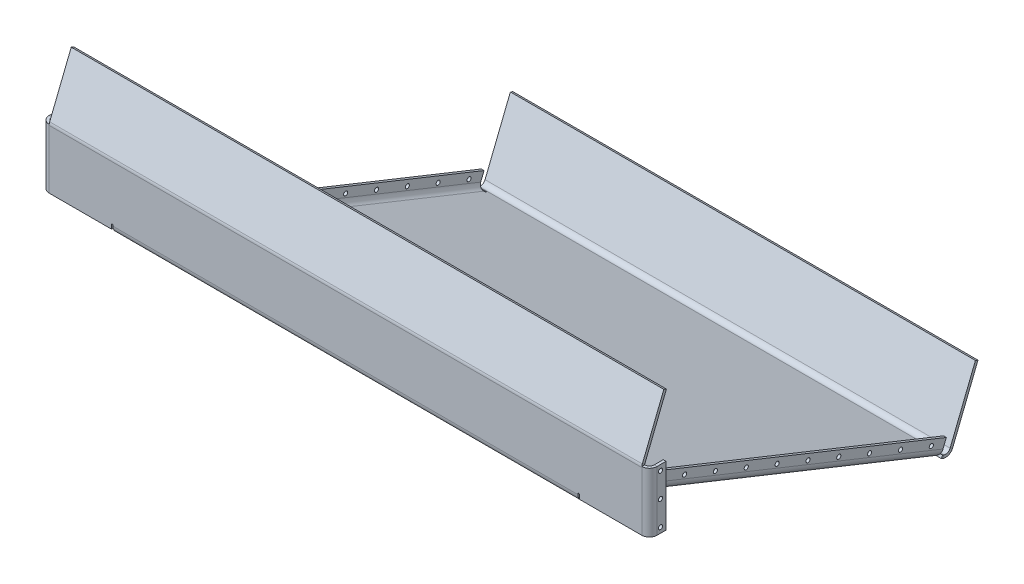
ISO-10303-21;
HEADER;
FILE_DESCRIPTION(('STEP AP214'),'2;1');
FILE_NAME('part.step','',(''),(''),'','','');
FILE_SCHEMA(('AUTOMOTIVE_DESIGN { 1 0 10303 214 1 1 1 1 }'));
ENDSEC;
DATA;
#1=APPLICATION_CONTEXT('core data for automotive mechanical design processes');
#2=APPLICATION_PROTOCOL_DEFINITION('international standard','automotive_design',2000,#1);
#3=PRODUCT_CONTEXT('',#1,'mechanical');
#4=PRODUCT('Part','Part','',(#3));
#5=PRODUCT_RELATED_PRODUCT_CATEGORY('part','',(#4));
#6=PRODUCT_DEFINITION_FORMATION('','',#4);
#7=PRODUCT_DEFINITION_CONTEXT('part definition',#1,'design');
#8=PRODUCT_DEFINITION('design','',#6,#7);
#9=PRODUCT_DEFINITION_SHAPE('','',#8);
#10=(LENGTH_UNIT() NAMED_UNIT(*) SI_UNIT(.MILLI.,.METRE.));
#11=(NAMED_UNIT(*) PLANE_ANGLE_UNIT() SI_UNIT($,.RADIAN.));
#12=(NAMED_UNIT(*) SI_UNIT($,.STERADIAN.) SOLID_ANGLE_UNIT());
#13=UNCERTAINTY_MEASURE_WITH_UNIT(LENGTH_MEASURE(1.E-05),#10,'distance_accuracy_value','');
#14=(GEOMETRIC_REPRESENTATION_CONTEXT(3) GLOBAL_UNCERTAINTY_ASSIGNED_CONTEXT((#13)) GLOBAL_UNIT_ASSIGNED_CONTEXT((#10,
#11,#12)) REPRESENTATION_CONTEXT('',''));
#15=CARTESIAN_POINT('',(0.,0.,0.));
#16=DIRECTION('',(0.,0.,1.));
#17=DIRECTION('',(1.,0.,0.));
#18=AXIS2_PLACEMENT_3D('',#15,#16,#17);
#19=CARTESIAN_POINT('',(494.791999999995,25.4327368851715,-3.51266890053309));
#20=DIRECTION('',(0.,-0.371390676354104,-0.928476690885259));
#21=DIRECTION('',(0.,0.928476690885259,-0.371390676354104));
#22=AXIS2_PLACEMENT_3D('',#19,#20,#21);
#23=PLANE('',#22);
#24=DIRECTION('',(-1.,0.,0.));
#25=VECTOR('',#24,1.);
#26=CARTESIAN_POINT('',(-29.845000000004,22.4848233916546,-2.33350350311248));
#27=LINE('',#26,#25);
#28=CARTESIAN_POINT('',(494.791999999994,22.4848233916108,-2.33350350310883));
#29=VERTEX_POINT('',#28);
#30=CARTESIAN_POINT('',(503.554999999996,22.4848233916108,-2.33350350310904));
#31=VERTEX_POINT('',#30);
#32=EDGE_CURVE('E802',#29,#31,#27,.F.);
#33=ORIENTED_EDGE('',*,*,#32,.F.);
#34=CARTESIAN_POINT('',(494.791999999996,30.6210646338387,-5.58799999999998));
#35=DIRECTION('',(0.,-0.371390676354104,-0.928476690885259));
#36=DIRECTION('',(0.,0.928476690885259,-0.371390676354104));
#37=AXIS2_PLACEMENT_3D('',#34,#35,#36);
#38=CIRCLE('',#37,8.76300000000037);
#39=CARTESIAN_POINT('',(501.542142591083,25.4327368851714,-3.51266890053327));
#40=VERTEX_POINT('',#39);
#41=EDGE_CURVE('E668',#29,#40,#38,.F.);
#42=ORIENTED_EDGE('',*,*,#41,.T.);
#43=DIRECTION('',(-1.,0.,0.));
#44=VECTOR('',#43,1.);
#45=CARTESIAN_POINT('',(503.554999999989,25.4327368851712,-3.51266890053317));
#46=LINE('',#45,#44);
#47=CARTESIAN_POINT('',(503.554999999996,25.4327368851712,-3.51266890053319));
#48=VERTEX_POINT('',#47);
#49=EDGE_CURVE('E959',#48,#40,#46,.T.);
#50=ORIENTED_EDGE('',*,*,#49,.F.);
#51=DIRECTION('',(0.,-0.928476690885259,0.371390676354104));
#52=VECTOR('',#51,1.);
#53=CARTESIAN_POINT('',(503.554999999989,25.4327368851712,-3.51266890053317));
#54=LINE('',#53,#52);
#55=EDGE_CURVE('E958',#48,#31,#54,.T.);
#56=ORIENTED_EDGE('',*,*,#55,.T.);
#57=EDGE_LOOP('',(#33,#42,#50,#56));
#58=FACE_BOUND('',#57,.T.);
#59=ADVANCED_FACE('F199',(#58),#23,.T.);
#60=CARTESIAN_POINT('',(-29.8450000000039,25.4327368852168,-3.51266890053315));
#61=DIRECTION('',(0.,-0.371390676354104,-0.928476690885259));
#62=DIRECTION('',(0.,0.928476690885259,-0.371390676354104));
#63=AXIS2_PLACEMENT_3D('',#60,#61,#62);
#64=PLANE('',#63);
#65=DIRECTION('',(1.,3.13172719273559E-13,-1.47678159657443E-13));
#66=VECTOR('',#65,1.);
#67=CARTESIAN_POINT('',(-29.8450000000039,25.4327368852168,-3.51266890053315));
#68=LINE('',#67,#66);
#69=CARTESIAN_POINT('',(-29.8450000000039,25.4327368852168,-3.51266890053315));
#70=VERTEX_POINT('',#69);
#71=CARTESIAN_POINT('',(-27.8321425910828,25.4327368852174,-3.51266890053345));
#72=VERTEX_POINT('',#71);
#73=EDGE_CURVE('E826',#70,#72,#68,.T.);
#74=ORIENTED_EDGE('',*,*,#73,.T.);
#75=CARTESIAN_POINT('',(-21.0819999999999,30.6210646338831,-5.58799999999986));
#76=DIRECTION('',(0.,0.371390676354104,0.92847669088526));
#77=DIRECTION('',(0.,-0.928476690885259,0.371390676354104));
#78=AXIS2_PLACEMENT_3D('',#75,#76,#77);
#79=CIRCLE('',#78,8.76299999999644);
#80=CARTESIAN_POINT('',(-21.0820000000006,22.4848233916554,-2.33350350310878));
#81=VERTEX_POINT('',#80);
#82=EDGE_CURVE('E13',#72,#81,#79,.T.);
#83=ORIENTED_EDGE('',*,*,#82,.T.);
#84=DIRECTION('',(1.,0.,0.));
#85=VECTOR('',#84,1.);
#86=CARTESIAN_POINT('',(1.93633555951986E-12,22.4848233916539,-2.33350350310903));
#87=LINE('',#86,#85);
#88=CARTESIAN_POINT('',(-29.8450000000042,22.4848233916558,-2.33350350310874));
#89=VERTEX_POINT('',#88);
#90=EDGE_CURVE('E969',#89,#81,#87,.T.);
#91=ORIENTED_EDGE('',*,*,#90,.F.);
#92=DIRECTION('',(0.,-0.928476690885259,0.371390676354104));
#93=VECTOR('',#92,1.);
#94=CARTESIAN_POINT('',(-29.8450000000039,25.4327368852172,-3.51266890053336));
#95=LINE('',#94,#93);
#96=EDGE_CURVE('E962',#70,#89,#95,.T.);
#97=ORIENTED_EDGE('',*,*,#96,.F.);
#98=EDGE_LOOP('',(#74,#83,#91,#97));
#99=FACE_BOUND('',#98,.T.);
#100=ADVANCED_FACE('F1265',(#99),#64,.T.);
#101=CARTESIAN_POINT('',(1.74016872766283E-12,20.1881248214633,-8.07524992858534));
#102=DIRECTION('',(0.,0.928476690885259,-0.371390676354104));
#103=DIRECTION('',(0.,0.371390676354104,0.928476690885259));
#104=AXIS2_PLACEMENT_3D('',#101,#102,#103);
#105=PLANE('',#104);
#106=DIRECTION('',(1.,0.,0.));
#107=VECTOR('',#106,1.);
#108=CARTESIAN_POINT('',(-1.56636374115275E-11,-142.065847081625,-413.710179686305));
#109=LINE('',#108,#107);
#110=CARTESIAN_POINT('',(493.204499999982,-142.065847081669,-413.710179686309));
#111=VERTEX_POINT('',#110);
#112=CARTESIAN_POINT('',(503.554999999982,-142.065847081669,-413.710179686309));
#113=VERTEX_POINT('',#112);
#114=EDGE_CURVE('E819',#111,#113,#109,.T.);
#115=ORIENTED_EDGE('',*,*,#114,.F.);
#116=DIRECTION('',(0.,-0.371390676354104,-0.928476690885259));
#117=VECTOR('',#116,1.);
#118=CARTESIAN_POINT('',(493.204499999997,20.1881248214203,-8.07524992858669));
#119=LINE('',#118,#117);
#120=CARTESIAN_POINT('',(493.204499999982,-141.476264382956,-412.236222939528));
#121=VERTEX_POINT('',#120);
#122=EDGE_CURVE('E823',#121,#111,#119,.T.);
#123=ORIENTED_EDGE('',*,*,#122,.F.);
#124=DIRECTION('',(-1.,0.,0.));
#125=VECTOR('',#124,1.);
#126=CARTESIAN_POINT('',(-1.2392392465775E-11,-141.476264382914,-412.236222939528));
#127=LINE('',#126,#125);
#128=CARTESIAN_POINT('',(494.791999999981,-141.476264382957,-412.236222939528));
#129=VERTEX_POINT('',#128);
#130=EDGE_CURVE('E821',#129,#121,#127,.T.);
#131=ORIENTED_EDGE('',*,*,#130,.F.);
#132=DIRECTION('',(0.,-0.371390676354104,-0.928476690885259));
#133=VECTOR('',#132,1.);
#134=CARTESIAN_POINT('',(494.791999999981,-141.476264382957,-412.236222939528));
#135=LINE('',#134,#133);
#136=EDGE_CURVE('E552',#129,#29,#135,.F.);
#137=ORIENTED_EDGE('',*,*,#136,.T.);
#138=EDGE_CURVE('E967',#81,#29,#87,.T.);
#139=ORIENTED_EDGE('',*,*,#138,.F.);
#140=DIRECTION('',(0.,0.371390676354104,0.92847669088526));
#141=VECTOR('',#140,1.);
#142=CARTESIAN_POINT('',(-21.0820000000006,22.4848233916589,-2.3335035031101));
#143=LINE('',#142,#141);
#144=CARTESIAN_POINT('',(-21.0820000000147,-141.476264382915,-412.236222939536));
#145=VERTEX_POINT('',#144);
#146=EDGE_CURVE('E780',#81,#145,#143,.F.);
#147=ORIENTED_EDGE('',*,*,#146,.T.);
#148=DIRECTION('',(-1.,0.,0.));
#149=VECTOR('',#148,1.);
#150=CARTESIAN_POINT('',(-1.23923924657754E-11,-141.476264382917,-412.236222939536));
#151=LINE('',#150,#149);
#152=CARTESIAN_POINT('',(-19.4945000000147,-141.476264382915,-412.236222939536));
#153=VERTEX_POINT('',#152);
#154=EDGE_CURVE('E847',#153,#145,#151,.T.);
#155=ORIENTED_EDGE('',*,*,#154,.F.);
#156=DIRECTION('',(0.,0.371390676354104,0.928476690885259));
#157=VECTOR('',#156,1.);
#158=CARTESIAN_POINT('',(-19.494500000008,20.1881248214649,-8.07524992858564));
#159=LINE('',#158,#157);
#160=CARTESIAN_POINT('',(-19.4945000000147,-142.065847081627,-413.710179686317));
#161=VERTEX_POINT('',#160);
#162=EDGE_CURVE('E845',#161,#153,#159,.T.);
#163=ORIENTED_EDGE('',*,*,#162,.F.);
#164=DIRECTION('',(1.,0.,0.));
#165=VECTOR('',#164,1.);
#166=CARTESIAN_POINT('',(-1.17477810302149E-11,-142.065847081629,-413.710179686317));
#167=LINE('',#166,#165);
#168=CARTESIAN_POINT('',(-29.8450000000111,-142.065847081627,-413.710179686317));
#169=VERTEX_POINT('',#168);
#170=EDGE_CURVE('E828',#169,#161,#167,.T.);
#171=ORIENTED_EDGE('',*,*,#170,.F.);
#172=DIRECTION('',(0.,-0.371390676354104,-0.928476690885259));
#173=VECTOR('',#172,1.);
#174=CARTESIAN_POINT('',(-29.8450000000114,-145.909926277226,-423.320377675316));
#175=LINE('',#174,#173);
#176=CARTESIAN_POINT('',(-29.8450000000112,-142.655429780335,-415.184136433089));
#177=VERTEX_POINT('',#176);
#178=EDGE_CURVE('E973',#169,#177,#175,.T.);
#179=ORIENTED_EDGE('',*,*,#178,.T.);
#180=DIRECTION('',(-1.,0.,0.));
#181=VECTOR('',#180,1.);
#182=CARTESIAN_POINT('',(-29.8450000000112,-142.655429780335,-415.184136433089));
#183=LINE('',#182,#181);
#184=CARTESIAN_POINT('',(503.554999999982,-142.655429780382,-415.184136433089));
#185=VERTEX_POINT('',#184);
#186=EDGE_CURVE('E880',#177,#185,#183,.F.);
#187=ORIENTED_EDGE('',*,*,#186,.T.);
#188=DIRECTION('',(0.,0.371390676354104,0.928476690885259));
#189=VECTOR('',#188,1.);
#190=CARTESIAN_POINT('',(503.554999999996,23.8898909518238,1.17916539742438));
#191=LINE('',#190,#189);
#192=EDGE_CURVE('E975',#185,#113,#191,.T.);
#193=ORIENTED_EDGE('',*,*,#192,.T.);
#194=EDGE_LOOP('',(#115,#123,#131,#137,#139,#147,#155,#163,#171,#179,#187,#193));
#195=FACE_BOUND('',#194,.T.);
#196=ADVANCED_FACE('F1271',(#195),#105,.F.);
#197=CARTESIAN_POINT('',(1.99427349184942E-12,23.136038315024,-9.25441532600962));
#198=DIRECTION('',(0.,0.928476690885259,-0.371390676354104));
#199=DIRECTION('',(0.,0.371390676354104,0.928476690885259));
#200=AXIS2_PLACEMENT_3D('',#197,#198,#199);
#201=PLANE('',#200);
#202=DIRECTION('',(0.,0.371390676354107,0.928476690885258));
#203=VECTOR('',#202,1.);
#204=CARTESIAN_POINT('',(493.204499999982,-139.117933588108,-414.889345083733));
#205=LINE('',#204,#203);
#206=CARTESIAN_POINT('',(493.204499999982,-139.117933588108,-414.889345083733));
#207=VERTEX_POINT('',#206);
#208=CARTESIAN_POINT('',(493.204499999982,-138.528350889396,-413.415388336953));
#209=VERTEX_POINT('',#208);
#210=EDGE_CURVE('E804',#207,#209,#205,.T.);
#211=ORIENTED_EDGE('',*,*,#210,.F.);
#212=DIRECTION('',(-1.,0.,0.));
#213=VECTOR('',#212,1.);
#214=CARTESIAN_POINT('',(503.554999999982,-139.117933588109,-414.889345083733));
#215=LINE('',#214,#213);
#216=CARTESIAN_POINT('',(503.554999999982,-139.117933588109,-414.889345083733));
#217=VERTEX_POINT('',#216);
#218=EDGE_CURVE('E799',#217,#207,#215,.T.);
#219=ORIENTED_EDGE('',*,*,#218,.F.);
#220=DIRECTION('',(0.,0.371390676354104,0.928476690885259));
#221=VECTOR('',#220,1.);
#222=CARTESIAN_POINT('',(503.554999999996,26.8378044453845,1.01976792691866E-13));
#223=LINE('',#222,#221);
#224=CARTESIAN_POINT('',(503.554999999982,-139.707516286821,-416.363301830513));
#225=VERTEX_POINT('',#224);
#226=EDGE_CURVE('E976',#225,#217,#223,.T.);
#227=ORIENTED_EDGE('',*,*,#226,.F.);
#228=DIRECTION('',(-1.,0.,0.));
#229=VECTOR('',#228,1.);
#230=CARTESIAN_POINT('',(-29.845000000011,-139.707516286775,-416.363301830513));
#231=LINE('',#230,#229);
#232=CARTESIAN_POINT('',(-29.8450000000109,-139.707516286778,-416.363301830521));
#233=VERTEX_POINT('',#232);
#234=EDGE_CURVE('E892',#233,#225,#231,.F.);
#235=ORIENTED_EDGE('',*,*,#234,.F.);
#236=DIRECTION('',(0.,-0.371390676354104,-0.928476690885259));
#237=VECTOR('',#236,1.);
#238=CARTESIAN_POINT('',(-29.8450000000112,-142.962012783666,-424.499543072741));
#239=LINE('',#238,#237);
#240=CARTESIAN_POINT('',(-29.8450000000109,-139.117933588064,-414.889345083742));
#241=VERTEX_POINT('',#240);
#242=EDGE_CURVE('E972',#241,#233,#239,.T.);
#243=ORIENTED_EDGE('',*,*,#242,.F.);
#244=DIRECTION('',(-1.,0.,0.));
#245=VECTOR('',#244,1.);
#246=CARTESIAN_POINT('',(-19.4945000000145,-139.117933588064,-414.889345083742));
#247=LINE('',#246,#245);
#248=CARTESIAN_POINT('',(-19.4945000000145,-139.117933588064,-414.889345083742));
#249=VERTEX_POINT('',#248);
#250=EDGE_CURVE('E836',#249,#241,#247,.T.);
#251=ORIENTED_EDGE('',*,*,#250,.F.);
#252=DIRECTION('',(0.,-0.371390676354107,-0.928476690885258));
#253=VECTOR('',#252,1.);
#254=CARTESIAN_POINT('',(-19.4945000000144,-138.528350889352,-413.415388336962));
#255=LINE('',#254,#253);
#256=CARTESIAN_POINT('',(-19.4945000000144,-138.528350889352,-413.415388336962));
#257=VERTEX_POINT('',#256);
#258=EDGE_CURVE('E832',#257,#249,#255,.T.);
#259=ORIENTED_EDGE('',*,*,#258,.F.);
#260=DIRECTION('',(1.,0.,0.));
#261=VECTOR('',#260,1.);
#262=CARTESIAN_POINT('',(-21.0820000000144,-138.528350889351,-413.415388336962));
#263=LINE('',#262,#261);
#264=CARTESIAN_POINT('',(-21.0820000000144,-138.528350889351,-413.415388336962));
#265=VERTEX_POINT('',#264);
#266=EDGE_CURVE('E829',#265,#257,#263,.T.);
#267=ORIENTED_EDGE('',*,*,#266,.F.);
#268=DIRECTION('',(0.,0.371390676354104,0.92847669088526));
#269=VECTOR('',#268,1.);
#270=CARTESIAN_POINT('',(-21.0820000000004,25.4327368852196,-3.51266890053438));
#271=LINE('',#270,#269);
#272=CARTESIAN_POINT('',(-21.0820000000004,25.4327368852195,-3.51266890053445));
#273=VERTEX_POINT('',#272);
#274=EDGE_CURVE('E791',#273,#265,#271,.F.);
#275=ORIENTED_EDGE('',*,*,#274,.F.);
#276=CARTESIAN_POINT('',(494.791999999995,25.432736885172,-3.51266890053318));
#277=VERTEX_POINT('',#276);
#278=EDGE_CURVE('E964',#277,#273,#46,.T.);
#279=ORIENTED_EDGE('',*,*,#278,.F.);
#280=DIRECTION('',(0.,-0.371390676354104,-0.928476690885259));
#281=VECTOR('',#280,1.);
#282=CARTESIAN_POINT('',(494.791999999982,-138.528350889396,-413.415388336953));
#283=LINE('',#282,#281);
#284=CARTESIAN_POINT('',(494.791999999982,-138.528350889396,-413.415388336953));
#285=VERTEX_POINT('',#284);
#286=EDGE_CURVE('E673',#285,#277,#283,.F.);
#287=ORIENTED_EDGE('',*,*,#286,.F.);
#288=DIRECTION('',(1.,0.,0.));
#289=VECTOR('',#288,1.);
#290=CARTESIAN_POINT('',(493.204499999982,-138.528350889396,-413.415388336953));
#291=LINE('',#290,#289);
#292=EDGE_CURVE('E808',#209,#285,#291,.T.);
#293=ORIENTED_EDGE('',*,*,#292,.F.);
#294=EDGE_LOOP('',(#211,#219,#227,#235,#243,#251,#259,#267,#275,#279,#287,#293));
#295=FACE_BOUND('',#294,.T.);
#296=ADVANCED_FACE('F1389',(#295),#201,.T.);
#297=CARTESIAN_POINT('',(503.554999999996,23.8898909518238,1.17916539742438));
#298=DIRECTION('',(-1.,0.,0.));
#299=DIRECTION('',(0.,-1.,0.));
#300=AXIS2_PLACEMENT_3D('',#297,#298,#299);
#301=PLANE('',#300);
#302=DIRECTION('',(0.,-0.928476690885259,0.371390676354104));
#303=VECTOR('',#302,1.);
#304=CARTESIAN_POINT('',(503.554999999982,-139.117933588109,-414.889345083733));
#305=LINE('',#304,#303);
#306=EDGE_CURVE('E803',#217,#113,#305,.T.);
#307=ORIENTED_EDGE('',*,*,#306,.T.);
#308=ORIENTED_EDGE('',*,*,#192,.F.);
#309=DIRECTION('',(0.,-0.928476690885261,0.371390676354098));
#310=VECTOR('',#309,1.);
#311=CARTESIAN_POINT('',(503.554999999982,-139.707516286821,-416.363301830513));
#312=LINE('',#311,#310);
#313=EDGE_CURVE('E897',#225,#185,#312,.T.);
#314=ORIENTED_EDGE('',*,*,#313,.F.);
#315=ORIENTED_EDGE('',*,*,#226,.T.);
#316=EDGE_LOOP('',(#307,#308,#314,#315));
#317=FACE_BOUND('',#316,.T.);
#318=ADVANCED_FACE('F1393',(#317),#301,.F.);
#319=CARTESIAN_POINT('',(-29.8450000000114,-145.909926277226,-423.320377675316));
#320=DIRECTION('',(1.,0.,0.));
#321=DIRECTION('',(0.,1.,0.));
#322=AXIS2_PLACEMENT_3D('',#319,#320,#321);
#323=PLANE('',#322);
#324=DIRECTION('',(0.,-0.928476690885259,0.371390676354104));
#325=VECTOR('',#324,1.);
#326=CARTESIAN_POINT('',(-29.8450000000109,-139.117933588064,-414.889345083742));
#327=LINE('',#326,#325);
#328=EDGE_CURVE('E838',#241,#169,#327,.T.);
#329=ORIENTED_EDGE('',*,*,#328,.F.);
#330=ORIENTED_EDGE('',*,*,#242,.T.);
#331=DIRECTION('',(0.,-0.928476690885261,0.371390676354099));
#332=VECTOR('',#331,1.);
#333=CARTESIAN_POINT('',(-29.8450000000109,-139.707516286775,-416.363301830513));
#334=LINE('',#333,#332);
#335=EDGE_CURVE('E886',#233,#177,#334,.T.);
#336=ORIENTED_EDGE('',*,*,#335,.T.);
#337=ORIENTED_EDGE('',*,*,#178,.F.);
#338=EDGE_LOOP('',(#329,#330,#336,#337));
#339=FACE_BOUND('',#338,.T.);
#340=ADVANCED_FACE('F1385',(#339),#323,.F.);
#341=CARTESIAN_POINT('',(576.707,95.2293974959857,-1.48132322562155E-13));
#342=DIRECTION('',(-1.,-2.37282148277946E-12,0.));
#343=DIRECTION('',(2.37282148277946E-12,-1.,0.));
#344=AXIS2_PLACEMENT_3D('',#341,#342,#343);
#345=PLANE('',#344);
#346=DIRECTION('',(0.,0.,1.));
#347=VECTOR('',#346,1.);
#348=CARTESIAN_POINT('',(576.707,95.2293974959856,-1.50053580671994E-13));
#349=LINE('',#348,#347);
#350=CARTESIAN_POINT('',(576.707,95.2293974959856,3.10867000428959));
#351=VERTEX_POINT('',#350);
#352=CARTESIAN_POINT('',(576.707,95.2293974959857,3.17499999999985));
#353=VERTEX_POINT('',#352);
#354=EDGE_CURVE('E1121',#351,#353,#349,.T.);
#355=ORIENTED_EDGE('',*,*,#354,.F.);
#356=CARTESIAN_POINT('',(576.707000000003,94.1532470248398,-5.58800000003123));
#357=DIRECTION('',(1.,0.,0.));
#358=DIRECTION('',(0.,1.,0.));
#359=AXIS2_PLACEMENT_3D('',#356,#357,#358);
#360=CIRCLE('',#359,8.76300000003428);
#361=CARTESIAN_POINT('',(576.707000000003,94.1532470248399,3.17499999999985));
#362=VERTEX_POINT('',#361);
#363=EDGE_CURVE('E208',#351,#362,#360,.T.);
#364=ORIENTED_EDGE('',*,*,#363,.T.);
#365=DIRECTION('',(0.,-1.,0.));
#366=VECTOR('',#365,1.);
#367=CARTESIAN_POINT('',(576.707000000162,26.8378044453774,3.17499999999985));
#368=LINE('',#367,#366);
#369=EDGE_CURVE('E955',#353,#362,#368,.T.);
#370=ORIENTED_EDGE('',*,*,#369,.F.);
#371=EDGE_LOOP('',(#355,#364,#370));
#372=FACE_BOUND('',#371,.T.);
#373=ADVANCED_FACE('F1381',(#372),#345,.T.);
#374=CARTESIAN_POINT('',(-102.996999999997,94.153247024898,2.41820452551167E-12));
#375=DIRECTION('',(1.,0.,0.));
#376=DIRECTION('',(0.,1.,0.));
#377=AXIS2_PLACEMENT_3D('',#374,#375,#376);
#378=PLANE('',#377);
#379=DIRECTION('',(0.,1.,0.));
#380=VECTOR('',#379,1.);
#381=CARTESIAN_POINT('',(-102.996999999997,95.229397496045,3.17499999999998));
#382=LINE('',#381,#380);
#383=CARTESIAN_POINT('',(-102.996999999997,95.2293974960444,3.17499999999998));
#384=VERTEX_POINT('',#383);
#385=CARTESIAN_POINT('',(-102.996999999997,94.153247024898,3.17499999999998));
#386=VERTEX_POINT('',#385);
#387=EDGE_CURVE('E1172',#384,#386,#382,.F.);
#388=ORIENTED_EDGE('',*,*,#387,.T.);
#389=CARTESIAN_POINT('',(-102.996999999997,94.1532470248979,-5.58800000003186));
#390=DIRECTION('',(1.,0.,0.));
#391=DIRECTION('',(0.,1.,0.));
#392=AXIS2_PLACEMENT_3D('',#389,#390,#391);
#393=CIRCLE('',#392,8.76300000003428);
#394=CARTESIAN_POINT('',(-102.996999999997,95.229397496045,3.10867000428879));
#395=VERTEX_POINT('',#394);
#396=EDGE_CURVE('E939',#386,#395,#393,.F.);
#397=ORIENTED_EDGE('',*,*,#396,.T.);
#398=DIRECTION('',(0.,0.,1.));
#399=VECTOR('',#398,1.);
#400=CARTESIAN_POINT('',(-102.996999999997,95.229397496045,0.));
#401=LINE('',#400,#399);
#402=EDGE_CURVE('E1178',#395,#384,#401,.T.);
#403=ORIENTED_EDGE('',*,*,#402,.T.);
#404=EDGE_LOOP('',(#388,#397,#403));
#405=FACE_BOUND('',#404,.T.);
#406=ADVANCED_FACE('F1377',(#405),#378,.T.);
#407=CARTESIAN_POINT('',(0.,0.,3.175));
#408=DIRECTION('',(0.,0.,-1.));
#409=DIRECTION('',(-1.,0.,0.));
#410=AXIS2_PLACEMENT_3D('',#407,#408,#409);
#411=PLANE('',#410);
#412=DIRECTION('',(1.,0.,0.));
#413=VECTOR('',#412,1.);
#414=CARTESIAN_POINT('',(576.707000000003,94.1532470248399,3.17500000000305));
#415=LINE('',#414,#413);
#416=EDGE_CURVE('E934',#362,#386,#415,.F.);
#417=ORIENTED_EDGE('',*,*,#416,.T.);
#418=CARTESIAN_POINT('',(-102.996999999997,26.8378044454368,3.175));
#419=VERTEX_POINT('',#418);
#420=EDGE_CURVE('E1175',#386,#419,#382,.F.);
#421=ORIENTED_EDGE('',*,*,#420,.T.);
#422=DIRECTION('',(1.,0.,0.));
#423=VECTOR('',#422,1.);
#424=CARTESIAN_POINT('',(585.47,26.8378044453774,3.175));
#425=LINE('',#424,#423);
#426=CARTESIAN_POINT('',(-31.4325000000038,26.83780444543,3.175));
#427=VERTEX_POINT('',#426);
#428=EDGE_CURVE('E1197',#419,#427,#425,.T.);
#429=ORIENTED_EDGE('',*,*,#428,.T.);
#430=DIRECTION('',(0.,-1.,0.));
#431=VECTOR('',#430,1.);
#432=CARTESIAN_POINT('',(-31.4325000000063,2.92392283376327E-12,3.175));
#433=LINE('',#432,#431);
#434=CARTESIAN_POINT('',(-31.4325000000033,32.2085646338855,3.175));
#435=VERTEX_POINT('',#434);
#436=EDGE_CURVE('E1048',#435,#427,#433,.T.);
#437=ORIENTED_EDGE('',*,*,#436,.F.);
#438=DIRECTION('',(-1.,0.,0.));
#439=VECTOR('',#438,1.);
#440=CARTESIAN_POINT('',(2.8156448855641E-12,32.2085646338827,3.175));
#441=LINE('',#440,#439);
#442=CARTESIAN_POINT('',(-29.8450000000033,32.2085646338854,3.175));
#443=VERTEX_POINT('',#442);
#444=EDGE_CURVE('E1046',#443,#435,#441,.T.);
#445=ORIENTED_EDGE('',*,*,#444,.F.);
#446=DIRECTION('',(0.,1.,0.));
#447=VECTOR('',#446,1.);
#448=CARTESIAN_POINT('',(-29.8450000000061,2.5437985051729E-12,3.175));
#449=LINE('',#448,#447);
#450=CARTESIAN_POINT('',(-29.8450000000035,30.6210646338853,3.17500000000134));
#451=VERTEX_POINT('',#450);
#452=EDGE_CURVE('E1044',#451,#443,#449,.T.);
#453=ORIENTED_EDGE('',*,*,#452,.F.);
#454=DIRECTION('',(-1.,0.,0.));
#455=VECTOR('',#454,1.);
#456=CARTESIAN_POINT('',(-29.8450000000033,30.6210646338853,3.17500000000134));
#457=LINE('',#456,#455);
#458=CARTESIAN_POINT('',(503.554999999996,30.6210646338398,3.175));
#459=VERTEX_POINT('',#458);
#460=EDGE_CURVE('E983',#451,#459,#457,.F.);
#461=ORIENTED_EDGE('',*,*,#460,.T.);
#462=DIRECTION('',(0.,-1.,0.));
#463=VECTOR('',#462,1.);
#464=CARTESIAN_POINT('',(503.554999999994,-3.52162743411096E-11,3.175));
#465=LINE('',#464,#463);
#466=CARTESIAN_POINT('',(503.554999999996,32.2085646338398,3.175));
#467=VERTEX_POINT('',#466);
#468=EDGE_CURVE('E1042',#467,#459,#465,.T.);
#469=ORIENTED_EDGE('',*,*,#468,.F.);
#470=DIRECTION('',(-1.,0.,0.));
#471=VECTOR('',#470,1.);
#472=CARTESIAN_POINT('',(2.81564488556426E-12,32.2085646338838,3.175));
#473=LINE('',#472,#471);
#474=CARTESIAN_POINT('',(505.142499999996,32.2085646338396,3.175));
#475=VERTEX_POINT('',#474);
#476=EDGE_CURVE('E1040',#475,#467,#473,.T.);
#477=ORIENTED_EDGE('',*,*,#476,.F.);
#478=DIRECTION('',(0.,1.,0.));
#479=VECTOR('',#478,1.);
#480=CARTESIAN_POINT('',(505.142499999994,-4.17684509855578E-11,3.175));
#481=LINE('',#480,#479);
#482=CARTESIAN_POINT('',(505.142499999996,26.8378044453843,3.175));
#483=VERTEX_POINT('',#482);
#484=EDGE_CURVE('E1010',#483,#475,#481,.T.);
#485=ORIENTED_EDGE('',*,*,#484,.F.);
#486=CARTESIAN_POINT('',(576.707,26.8378044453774,3.17499999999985));
#487=VERTEX_POINT('',#486);
#488=EDGE_CURVE('E1199',#483,#487,#425,.T.);
#489=ORIENTED_EDGE('',*,*,#488,.T.);
#490=DIRECTION('',(0.,-1.,0.));
#491=VECTOR('',#490,1.);
#492=CARTESIAN_POINT('',(576.707,26.8378044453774,3.17499999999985));
#493=LINE('',#492,#491);
#494=EDGE_CURVE('E1099',#487,#362,#493,.F.);
#495=ORIENTED_EDGE('',*,*,#494,.T.);
#496=EDGE_LOOP('',(#417,#421,#429,#437,#445,#453,#461,#469,#477,#485,#489,#495));
#497=FACE_BOUND('',#496,.T.);
#498=ADVANCED_FACE('F1380',(#497),#411,.F.);
#499=CARTESIAN_POINT('',(0.,0.,0.));
#500=DIRECTION('',(0.,0.,-1.));
#501=DIRECTION('',(-1.,0.,0.));
#502=AXIS2_PLACEMENT_3D('',#499,#500,#501);
#503=PLANE('',#502);
#504=DIRECTION('',(0.,1.,0.));
#505=VECTOR('',#504,1.);
#506=CARTESIAN_POINT('',(-102.996999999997,95.229397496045,0.));
#507=LINE('',#506,#505);
#508=CARTESIAN_POINT('',(-102.996999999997,94.153247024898,2.41820452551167E-12));
#509=VERTEX_POINT('',#508);
#510=CARTESIAN_POINT('',(-102.996999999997,26.8378044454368,0.));
#511=VERTEX_POINT('',#510);
#512=EDGE_CURVE('E1188',#509,#511,#507,.F.);
#513=ORIENTED_EDGE('',*,*,#512,.F.);
#514=DIRECTION('',(1.,0.,0.));
#515=VECTOR('',#514,1.);
#516=CARTESIAN_POINT('',(576.707000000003,94.1532470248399,3.04964387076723E-12));
#517=LINE('',#516,#515);
#518=CARTESIAN_POINT('',(576.707000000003,94.1532470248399,3.04964387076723E-12));
#519=VERTEX_POINT('',#518);
#520=EDGE_CURVE('E948',#519,#509,#517,.F.);
#521=ORIENTED_EDGE('',*,*,#520,.F.);
#522=DIRECTION('',(0.,-1.,0.));
#523=VECTOR('',#522,1.);
#524=CARTESIAN_POINT('',(576.707,26.8378044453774,-1.50053580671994E-13));
#525=LINE('',#524,#523);
#526=CARTESIAN_POINT('',(576.707,26.8378044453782,0.));
#527=VERTEX_POINT('',#526);
#528=EDGE_CURVE('E1112',#527,#519,#525,.F.);
#529=ORIENTED_EDGE('',*,*,#528,.F.);
#530=DIRECTION('',(1.,0.,0.));
#531=VECTOR('',#530,1.);
#532=CARTESIAN_POINT('',(585.47,26.8378044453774,0.));
#533=LINE('',#532,#531);
#534=CARTESIAN_POINT('',(505.142499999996,26.8378044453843,6.47507821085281E-13));
#535=VERTEX_POINT('',#534);
#536=EDGE_CURVE('E1194',#535,#527,#533,.T.);
#537=ORIENTED_EDGE('',*,*,#536,.F.);
#538=DIRECTION('',(0.,-1.,-1.20561670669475E-13));
#539=VECTOR('',#538,1.);
#540=CARTESIAN_POINT('',(505.142499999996,32.2085646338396,1.29501564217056E-12));
#541=LINE('',#540,#539);
#542=CARTESIAN_POINT('',(505.142499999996,32.2085646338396,0.));
#543=VERTEX_POINT('',#542);
#544=EDGE_CURVE('E1025',#543,#535,#541,.T.);
#545=ORIENTED_EDGE('',*,*,#544,.F.);
#546=DIRECTION('',(1.,0.,0.));
#547=VECTOR('',#546,1.);
#548=CARTESIAN_POINT('',(503.554999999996,32.2085646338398,1.29497107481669E-12));
#549=LINE('',#548,#547);
#550=CARTESIAN_POINT('',(503.554999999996,32.2085646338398,1.29497107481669E-12));
#551=VERTEX_POINT('',#550);
#552=EDGE_CURVE('E1022',#551,#543,#549,.T.);
#553=ORIENTED_EDGE('',*,*,#552,.F.);
#554=DIRECTION('',(0.,1.,0.));
#555=VECTOR('',#554,1.);
#556=CARTESIAN_POINT('',(503.554999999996,30.6210646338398,1.29497107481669E-12));
#557=LINE('',#556,#555);
#558=CARTESIAN_POINT('',(503.554999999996,30.6210646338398,1.29497107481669E-12));
#559=VERTEX_POINT('',#558);
#560=EDGE_CURVE('E1019',#559,#551,#557,.T.);
#561=ORIENTED_EDGE('',*,*,#560,.F.);
#562=DIRECTION('',(-1.,0.,0.));
#563=VECTOR('',#562,1.);
#564=CARTESIAN_POINT('',(-29.8450000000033,30.6210646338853,1.33660443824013E-12));
#565=LINE('',#564,#563);
#566=CARTESIAN_POINT('',(-29.8450000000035,30.6210646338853,1.33660443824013E-12));
#567=VERTEX_POINT('',#566);
#568=EDGE_CURVE('E996',#567,#559,#565,.F.);
#569=ORIENTED_EDGE('',*,*,#568,.F.);
#570=DIRECTION('',(0.,-1.,0.));
#571=VECTOR('',#570,1.);
#572=CARTESIAN_POINT('',(-29.8450000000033,32.2085646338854,1.33660443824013E-12));
#573=LINE('',#572,#571);
#574=CARTESIAN_POINT('',(-29.8450000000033,32.2085646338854,1.33660443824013E-12));
#575=VERTEX_POINT('',#574);
#576=EDGE_CURVE('E1016',#575,#567,#573,.T.);
#577=ORIENTED_EDGE('',*,*,#576,.F.);
#578=DIRECTION('',(1.,0.,0.));
#579=VECTOR('',#578,1.);
#580=CARTESIAN_POINT('',(-31.4325000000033,32.2085646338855,1.33655987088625E-12));
#581=LINE('',#580,#579);
#582=CARTESIAN_POINT('',(-31.4325000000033,32.2085646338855,1.33655987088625E-12));
#583=VERTEX_POINT('',#582);
#584=EDGE_CURVE('E1012',#583,#575,#581,.T.);
#585=ORIENTED_EDGE('',*,*,#584,.F.);
#586=DIRECTION('',(0.,1.,1.24429300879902E-13));
#587=VECTOR('',#586,1.);
#588=CARTESIAN_POINT('',(-31.4325000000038,26.83780444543,6.68279935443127E-13));
#589=LINE('',#588,#587);
#590=CARTESIAN_POINT('',(-31.4325000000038,26.83780444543,6.68279935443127E-13));
#591=VERTEX_POINT('',#590);
#592=EDGE_CURVE('E1007',#591,#583,#589,.T.);
#593=ORIENTED_EDGE('',*,*,#592,.F.);
#594=EDGE_CURVE('E203',#511,#591,#533,.T.);
#595=ORIENTED_EDGE('',*,*,#594,.F.);
#596=EDGE_LOOP('',(#513,#521,#529,#537,#545,#553,#561,#569,#577,#585,#593,#595));
#597=FACE_BOUND('',#596,.T.);
#598=ADVANCED_FACE('F1218',(#597),#503,.T.);
#599=CARTESIAN_POINT('',(585.47,26.8378044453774,3.175));
#600=DIRECTION('',(0.,1.,0.));
#601=DIRECTION('',(-1.,0.,0.));
#602=AXIS2_PLACEMENT_3D('',#599,#600,#601);
#603=PLANE('',#602);
#604=DIRECTION('',(0.,0.,1.));
#605=VECTOR('',#604,1.);
#606=CARTESIAN_POINT('',(-31.4325000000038,26.83780444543,6.68279935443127E-13));
#607=LINE('',#606,#605);
#608=EDGE_CURVE('E1011',#591,#427,#607,.T.);
#609=ORIENTED_EDGE('',*,*,#608,.T.);
#610=ORIENTED_EDGE('',*,*,#428,.F.);
#611=DIRECTION('',(0.,0.,1.));
#612=VECTOR('',#611,1.);
#613=CARTESIAN_POINT('',(-102.996999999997,26.8378044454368,0.));
#614=LINE('',#613,#612);
#615=EDGE_CURVE('E1191',#511,#419,#614,.T.);
#616=ORIENTED_EDGE('',*,*,#615,.F.);
#617=ORIENTED_EDGE('',*,*,#594,.T.);
#618=EDGE_LOOP('',(#609,#610,#616,#617));
#619=FACE_BOUND('',#618,.T.);
#620=ADVANCED_FACE('F201',(#619),#603,.F.);
#621=DIRECTION('',(0.,0.,1.));
#622=VECTOR('',#621,1.);
#623=CARTESIAN_POINT('',(505.142499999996,26.8378044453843,6.47507821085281E-13));
#624=LINE('',#623,#622);
#625=EDGE_CURVE('E1027',#535,#483,#624,.T.);
#626=ORIENTED_EDGE('',*,*,#625,.F.);
#627=ORIENTED_EDGE('',*,*,#536,.T.);
#628=DIRECTION('',(0.,0.,1.));
#629=VECTOR('',#628,1.);
#630=CARTESIAN_POINT('',(576.707,26.8378044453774,-1.50053580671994E-13));
#631=LINE('',#630,#629);
#632=EDGE_CURVE('E1106',#527,#487,#631,.T.);
#633=ORIENTED_EDGE('',*,*,#632,.T.);
#634=ORIENTED_EDGE('',*,*,#488,.F.);
#635=EDGE_LOOP('',(#626,#627,#633,#634));
#636=FACE_BOUND('',#635,.T.);
#637=ADVANCED_FACE('F1213',(#636),#603,.F.);
#638=CARTESIAN_POINT('',(-102.996999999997,26.8378044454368,-5.588));
#639=DIRECTION('',(0.,-1.,0.));
#640=DIRECTION('',(1.,0.,0.));
#641=AXIS2_PLACEMENT_3D('',#638,#639,#640);
#642=PLANE('',#641);
#643=DIRECTION('',(1.,0.,0.));
#644=VECTOR('',#643,1.);
#645=CARTESIAN_POINT('',(-111.759999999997,26.8378044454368,-5.58799999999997));
#646=LINE('',#645,#644);
#647=CARTESIAN_POINT('',(-108.584999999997,26.8378044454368,-5.58799999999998));
#648=VERTEX_POINT('',#647);
#649=CARTESIAN_POINT('',(-111.759999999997,26.8378044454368,-5.58799999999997));
#650=VERTEX_POINT('',#649);
#651=EDGE_CURVE('E1120',#648,#650,#646,.F.);
#652=ORIENTED_EDGE('',*,*,#651,.F.);
#653=CARTESIAN_POINT('',(-102.996999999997,26.8378044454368,-5.588));
#654=DIRECTION('',(0.,1.,0.));
#655=DIRECTION('',(-1.,0.,0.));
#656=AXIS2_PLACEMENT_3D('',#653,#654,#655);
#657=CIRCLE('',#656,5.58799999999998);
#658=EDGE_CURVE('E1182',#511,#648,#657,.F.);
#659=ORIENTED_EDGE('',*,*,#658,.F.);
#660=ORIENTED_EDGE('',*,*,#615,.T.);
#661=CARTESIAN_POINT('',(-102.996999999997,26.8378044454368,-5.588));
#662=DIRECTION('',(0.,1.,0.));
#663=DIRECTION('',(-1.,0.,0.));
#664=AXIS2_PLACEMENT_3D('',#661,#662,#663);
#665=CIRCLE('',#664,8.76299999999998);
#666=EDGE_CURVE('E1174',#419,#650,#665,.F.);
#667=ORIENTED_EDGE('',*,*,#666,.T.);
#668=EDGE_LOOP('',(#652,#659,#660,#667));
#669=FACE_BOUND('',#668,.T.);
#670=ADVANCED_FACE('F1514',(#669),#642,.T.);
#671=CARTESIAN_POINT('',(-102.996999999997,95.229397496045,-5.588));
#672=DIRECTION('',(0.,-1.,0.));
#673=DIRECTION('',(1.,0.,0.));
#674=AXIS2_PLACEMENT_3D('',#671,#672,#673);
#675=PLANE('',#674);
#676=CARTESIAN_POINT('',(-102.996999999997,95.229397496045,-5.588));
#677=DIRECTION('',(0.,1.,0.));
#678=DIRECTION('',(-1.,0.,0.));
#679=AXIS2_PLACEMENT_3D('',#676,#677,#678);
#680=CIRCLE('',#679,5.58799999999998);
#681=CARTESIAN_POINT('',(-108.584999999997,95.2293974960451,-5.58799999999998));
#682=VERTEX_POINT('',#681);
#683=CARTESIAN_POINT('',(-102.996999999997,95.2293974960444,0.));
#684=VERTEX_POINT('',#683);
#685=EDGE_CURVE('E1127',#682,#684,#680,.T.);
#686=ORIENTED_EDGE('',*,*,#685,.F.);
#687=DIRECTION('',(1.,0.,0.));
#688=VECTOR('',#687,1.);
#689=CARTESIAN_POINT('',(-108.584999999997,95.2293974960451,-5.58799999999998));
#690=LINE('',#689,#688);
#691=CARTESIAN_POINT('',(-111.759999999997,95.2293974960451,-5.58799999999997));
#692=VERTEX_POINT('',#691);
#693=EDGE_CURVE('E1165',#682,#692,#690,.F.);
#694=ORIENTED_EDGE('',*,*,#693,.T.);
#695=CARTESIAN_POINT('',(-102.996999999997,95.229397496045,-5.588));
#696=DIRECTION('',(0.,1.,0.));
#697=DIRECTION('',(-1.,0.,0.));
#698=AXIS2_PLACEMENT_3D('',#695,#696,#697);
#699=CIRCLE('',#698,8.76299999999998);
#700=EDGE_CURVE('E1179',#692,#384,#699,.T.);
#701=ORIENTED_EDGE('',*,*,#700,.T.);
#702=ORIENTED_EDGE('',*,*,#402,.F.);
#703=EDGE_CURVE('E1195',#684,#395,#401,.T.);
#704=ORIENTED_EDGE('',*,*,#703,.F.);
#705=EDGE_LOOP('',(#686,#694,#701,#702,#704));
#706=FACE_BOUND('',#705,.T.);
#707=ADVANCED_FACE('F1509',(#706),#675,.F.);
#708=CARTESIAN_POINT('',(-102.996999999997,95.229397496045,-5.588));
#709=DIRECTION('',(0.,1.,0.));
#710=DIRECTION('',(-1.,0.,0.));
#711=AXIS2_PLACEMENT_3D('',#708,#709,#710);
#712=CYLINDRICAL_SURFACE('',#711,8.76299999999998);
#713=ORIENTED_EDGE('',*,*,#387,.F.);
#714=ORIENTED_EDGE('',*,*,#700,.F.);
#715=DIRECTION('',(0.,1.,0.));
#716=VECTOR('',#715,1.);
#717=CARTESIAN_POINT('',(-111.759999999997,26.8378044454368,-5.58799999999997));
#718=LINE('',#717,#716);
#719=EDGE_CURVE('E1163',#692,#650,#718,.F.);
#720=ORIENTED_EDGE('',*,*,#719,.T.);
#721=ORIENTED_EDGE('',*,*,#666,.F.);
#722=ORIENTED_EDGE('',*,*,#420,.F.);
#723=EDGE_LOOP('',(#713,#714,#720,#721,#722));
#724=FACE_BOUND('',#723,.T.);
#725=ADVANCED_FACE('F1506',(#724),#712,.T.);
#726=CARTESIAN_POINT('',(-102.996999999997,95.229397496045,-5.588));
#727=DIRECTION('',(0.,1.,0.));
#728=DIRECTION('',(-1.,0.,0.));
#729=AXIS2_PLACEMENT_3D('',#726,#727,#728);
#730=CYLINDRICAL_SURFACE('',#729,5.58799999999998);
#731=EDGE_CURVE('E1185',#684,#509,#507,.F.);
#732=ORIENTED_EDGE('',*,*,#731,.T.);
#733=ORIENTED_EDGE('',*,*,#512,.T.);
#734=ORIENTED_EDGE('',*,*,#658,.T.);
#735=DIRECTION('',(0.,1.,0.));
#736=VECTOR('',#735,1.);
#737=CARTESIAN_POINT('',(-108.584999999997,26.8378044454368,-5.58799999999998));
#738=LINE('',#737,#736);
#739=EDGE_CURVE('E1168',#648,#682,#738,.T.);
#740=ORIENTED_EDGE('',*,*,#739,.T.);
#741=ORIENTED_EDGE('',*,*,#685,.T.);
#742=EDGE_LOOP('',(#732,#733,#734,#740,#741));
#743=FACE_BOUND('',#742,.T.);
#744=ADVANCED_FACE('F1490',(#743),#730,.F.);
#745=CARTESIAN_POINT('',(-111.759999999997,7.48372561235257E-13,4.01883957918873E-13));
#746=DIRECTION('',(1.,0.,0.));
#747=DIRECTION('',(0.,1.,0.));
#748=AXIS2_PLACEMENT_3D('',#745,#746,#747);
#749=PLANE('',#748);
#750=CARTESIAN_POINT('',(-111.759999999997,32.9993974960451,-9.52499999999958));
#751=DIRECTION('',(1.,0.,0.));
#752=DIRECTION('',(0.,1.,0.));
#753=AXIS2_PLACEMENT_3D('',#750,#751,#752);
#754=CIRCLE('',#753,2.38124999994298);
#755=CARTESIAN_POINT('',(-111.759999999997,35.3806474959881,-9.52499999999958));
#756=VERTEX_POINT('',#755);
#757=EDGE_CURVE('E1157',#756,#756,#754,.F.);
#758=ORIENTED_EDGE('',*,*,#757,.F.);
#759=EDGE_LOOP('',(#758));
#760=FACE_BOUND('',#759,.T.);
#761=CARTESIAN_POINT('',(-111.759999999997,88.8793974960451,-9.52499999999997));
#762=DIRECTION('',(1.,0.,0.));
#763=DIRECTION('',(0.,1.,0.));
#764=AXIS2_PLACEMENT_3D('',#761,#762,#763);
#765=CIRCLE('',#764,2.38124999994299);
#766=CARTESIAN_POINT('',(-111.759999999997,91.2606474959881,-9.52499999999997));
#767=VERTEX_POINT('',#766);
#768=EDGE_CURVE('E1145',#767,#767,#765,.F.);
#769=ORIENTED_EDGE('',*,*,#768,.F.);
#770=EDGE_LOOP('',(#769));
#771=FACE_BOUND('',#770,.T.);
#772=CARTESIAN_POINT('',(-111.759999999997,60.9393974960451,-9.52499999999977));
#773=DIRECTION('',(1.,0.,0.));
#774=DIRECTION('',(0.,1.,0.));
#775=AXIS2_PLACEMENT_3D('',#772,#773,#774);
#776=CIRCLE('',#775,2.38124999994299);
#777=CARTESIAN_POINT('',(-111.759999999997,63.3206474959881,-9.52499999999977));
#778=VERTEX_POINT('',#777);
#779=EDGE_CURVE('E1151',#778,#778,#776,.F.);
#780=ORIENTED_EDGE('',*,*,#779,.F.);
#781=EDGE_LOOP('',(#780));
#782=FACE_BOUND('',#781,.T.);
#783=ORIENTED_EDGE('',*,*,#719,.F.);
#784=DIRECTION('',(0.,0.,-1.));
#785=VECTOR('',#784,1.);
#786=CARTESIAN_POINT('',(-111.759999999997,95.2293974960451,4.01883957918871E-13));
#787=LINE('',#786,#785);
#788=CARTESIAN_POINT('',(-111.759999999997,95.2293974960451,-15.875));
#789=VERTEX_POINT('',#788);
#790=EDGE_CURVE('E1136',#692,#789,#787,.T.);
#791=ORIENTED_EDGE('',*,*,#790,.T.);
#792=DIRECTION('',(0.,-1.,0.));
#793=VECTOR('',#792,1.);
#794=CARTESIAN_POINT('',(-111.759999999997,7.48372561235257E-13,-15.875));
#795=LINE('',#794,#793);
#796=CARTESIAN_POINT('',(-111.759999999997,26.8378044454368,-15.875));
#797=VERTEX_POINT('',#796);
#798=EDGE_CURVE('E1134',#789,#797,#795,.T.);
#799=ORIENTED_EDGE('',*,*,#798,.T.);
#800=DIRECTION('',(0.,0.,1.));
#801=VECTOR('',#800,1.);
#802=CARTESIAN_POINT('',(-111.759999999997,26.8378044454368,4.01883957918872E-13));
#803=LINE('',#802,#801);
#804=EDGE_CURVE('E1131',#797,#650,#803,.T.);
#805=ORIENTED_EDGE('',*,*,#804,.T.);
#806=EDGE_LOOP('',(#783,#791,#799,#805));
#807=FACE_BOUND('',#806,.T.);
#808=ADVANCED_FACE('F1486',(#760,#771,#782,#807),#749,.F.);
#809=CARTESIAN_POINT('',(-108.584999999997,7.27111977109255E-13,3.90798504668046E-13));
#810=DIRECTION('',(1.,0.,0.));
#811=DIRECTION('',(0.,1.,0.));
#812=AXIS2_PLACEMENT_3D('',#809,#810,#811);
#813=PLANE('',#812);
#814=CARTESIAN_POINT('',(-108.584999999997,32.9993974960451,-9.52499999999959));
#815=DIRECTION('',(1.,0.,0.));
#816=DIRECTION('',(0.,1.,0.));
#817=AXIS2_PLACEMENT_3D('',#814,#815,#816);
#818=CIRCLE('',#817,2.38124999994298);
#819=CARTESIAN_POINT('',(-108.584999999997,35.3806474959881,-9.52499999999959));
#820=VERTEX_POINT('',#819);
#821=EDGE_CURVE('E1160',#820,#820,#818,.F.);
#822=ORIENTED_EDGE('',*,*,#821,.T.);
#823=EDGE_LOOP('',(#822));
#824=FACE_BOUND('',#823,.T.);
#825=CARTESIAN_POINT('',(-108.584999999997,88.8793974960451,-9.52499999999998));
#826=DIRECTION('',(1.,0.,0.));
#827=DIRECTION('',(0.,1.,0.));
#828=AXIS2_PLACEMENT_3D('',#825,#826,#827);
#829=CIRCLE('',#828,2.38124999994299);
#830=CARTESIAN_POINT('',(-108.584999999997,91.2606474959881,-9.52499999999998));
#831=VERTEX_POINT('',#830);
#832=EDGE_CURVE('E1148',#831,#831,#829,.F.);
#833=ORIENTED_EDGE('',*,*,#832,.T.);
#834=EDGE_LOOP('',(#833));
#835=FACE_BOUND('',#834,.T.);
#836=CARTESIAN_POINT('',(-108.584999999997,60.9393974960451,-9.52499999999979));
#837=DIRECTION('',(1.,0.,0.));
#838=DIRECTION('',(0.,1.,0.));
#839=AXIS2_PLACEMENT_3D('',#836,#837,#838);
#840=CIRCLE('',#839,2.38124999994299);
#841=CARTESIAN_POINT('',(-108.584999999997,63.3206474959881,-9.52499999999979));
#842=VERTEX_POINT('',#841);
#843=EDGE_CURVE('E1154',#842,#842,#840,.F.);
#844=ORIENTED_EDGE('',*,*,#843,.T.);
#845=EDGE_LOOP('',(#844));
#846=FACE_BOUND('',#845,.T.);
#847=DIRECTION('',(0.,0.,1.));
#848=VECTOR('',#847,1.);
#849=CARTESIAN_POINT('',(-108.584999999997,95.2293974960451,-15.875));
#850=LINE('',#849,#848);
#851=CARTESIAN_POINT('',(-108.584999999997,95.2293974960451,-15.875));
#852=VERTEX_POINT('',#851);
#853=EDGE_CURVE('E1143',#682,#852,#850,.F.);
#854=ORIENTED_EDGE('',*,*,#853,.F.);
#855=ORIENTED_EDGE('',*,*,#739,.F.);
#856=DIRECTION('',(0.,0.,-1.));
#857=VECTOR('',#856,1.);
#858=CARTESIAN_POINT('',(-108.584999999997,26.8378044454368,0.));
#859=LINE('',#858,#857);
#860=CARTESIAN_POINT('',(-108.584999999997,26.8378044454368,-15.875));
#861=VERTEX_POINT('',#860);
#862=EDGE_CURVE('E1138',#861,#648,#859,.F.);
#863=ORIENTED_EDGE('',*,*,#862,.F.);
#864=DIRECTION('',(0.,1.,0.));
#865=VECTOR('',#864,1.);
#866=CARTESIAN_POINT('',(-108.584999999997,26.8378044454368,-15.875));
#867=LINE('',#866,#865);
#868=EDGE_CURVE('E1141',#852,#861,#867,.F.);
#869=ORIENTED_EDGE('',*,*,#868,.F.);
#870=EDGE_LOOP('',(#854,#855,#863,#869));
#871=FACE_BOUND('',#870,.T.);
#872=ADVANCED_FACE('F1489',(#824,#835,#846,#871),#813,.T.);
#873=CARTESIAN_POINT('',(-111.759999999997,95.2293974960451,-15.875));
#874=DIRECTION('',(0.,-1.,0.));
#875=DIRECTION('',(1.,0.,0.));
#876=AXIS2_PLACEMENT_3D('',#873,#874,#875);
#877=PLANE('',#876);
#878=ORIENTED_EDGE('',*,*,#693,.F.);
#879=ORIENTED_EDGE('',*,*,#853,.T.);
#880=DIRECTION('',(1.,0.,0.));
#881=VECTOR('',#880,1.);
#882=CARTESIAN_POINT('',(-111.759999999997,95.2293974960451,-15.875));
#883=LINE('',#882,#881);
#884=EDGE_CURVE('E1124',#789,#852,#883,.T.);
#885=ORIENTED_EDGE('',*,*,#884,.F.);
#886=ORIENTED_EDGE('',*,*,#790,.F.);
#887=EDGE_LOOP('',(#878,#879,#885,#886));
#888=FACE_BOUND('',#887,.T.);
#889=ADVANCED_FACE('F1494',(#888),#877,.F.);
#890=CARTESIAN_POINT('',(-111.759999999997,26.8378044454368,0.));
#891=DIRECTION('',(0.,1.,0.));
#892=DIRECTION('',(-1.,0.,0.));
#893=AXIS2_PLACEMENT_3D('',#890,#891,#892);
#894=PLANE('',#893);
#895=ORIENTED_EDGE('',*,*,#651,.T.);
#896=ORIENTED_EDGE('',*,*,#804,.F.);
#897=DIRECTION('',(1.,0.,0.));
#898=VECTOR('',#897,1.);
#899=CARTESIAN_POINT('',(-111.759999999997,26.8378044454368,-15.875));
#900=LINE('',#899,#898);
#901=EDGE_CURVE('E1128',#797,#861,#900,.T.);
#902=ORIENTED_EDGE('',*,*,#901,.T.);
#903=ORIENTED_EDGE('',*,*,#862,.T.);
#904=EDGE_LOOP('',(#895,#896,#902,#903));
#905=FACE_BOUND('',#904,.T.);
#906=ADVANCED_FACE('F1496',(#905),#894,.F.);
#907=CARTESIAN_POINT('',(-111.759999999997,26.8378044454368,-15.875));
#908=DIRECTION('',(0.,0.,1.));
#909=DIRECTION('',(1.,0.,0.));
#910=AXIS2_PLACEMENT_3D('',#907,#908,#909);
#911=PLANE('',#910);
#912=ORIENTED_EDGE('',*,*,#868,.T.);
#913=ORIENTED_EDGE('',*,*,#901,.F.);
#914=ORIENTED_EDGE('',*,*,#798,.F.);
#915=ORIENTED_EDGE('',*,*,#884,.T.);
#916=EDGE_LOOP('',(#912,#913,#914,#915));
#917=FACE_BOUND('',#916,.T.);
#918=ADVANCED_FACE('F1484',(#917),#911,.F.);
#919=CARTESIAN_POINT('',(-111.759999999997,88.8793974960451,-9.52499999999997));
#920=DIRECTION('',(1.,0.,0.));
#921=DIRECTION('',(0.,1.,0.));
#922=AXIS2_PLACEMENT_3D('',#919,#920,#921);
#923=CYLINDRICAL_SURFACE('',#922,2.38124999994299);
#924=ORIENTED_EDGE('',*,*,#768,.T.);
#925=EDGE_LOOP('',(#924));
#926=FACE_BOUND('',#925,.T.);
#927=ORIENTED_EDGE('',*,*,#832,.F.);
#928=EDGE_LOOP('',(#927));
#929=FACE_BOUND('',#928,.T.);
#930=ADVANCED_FACE('F1480',(#926,#929),#923,.F.);
#931=CARTESIAN_POINT('',(-111.759999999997,60.9393974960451,-9.52499999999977));
#932=DIRECTION('',(1.,0.,0.));
#933=DIRECTION('',(0.,1.,0.));
#934=AXIS2_PLACEMENT_3D('',#931,#932,#933);
#935=CYLINDRICAL_SURFACE('',#934,2.38124999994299);
#936=ORIENTED_EDGE('',*,*,#779,.T.);
#937=EDGE_LOOP('',(#936));
#938=FACE_BOUND('',#937,.T.);
#939=ORIENTED_EDGE('',*,*,#843,.F.);
#940=EDGE_LOOP('',(#939));
#941=FACE_BOUND('',#940,.T.);
#942=ADVANCED_FACE('F1476',(#938,#941),#935,.F.);
#943=CARTESIAN_POINT('',(-111.759999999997,32.9993974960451,-9.52499999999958));
#944=DIRECTION('',(1.,0.,0.));
#945=DIRECTION('',(0.,1.,0.));
#946=AXIS2_PLACEMENT_3D('',#943,#944,#945);
#947=CYLINDRICAL_SURFACE('',#946,2.38124999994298);
#948=ORIENTED_EDGE('',*,*,#757,.T.);
#949=EDGE_LOOP('',(#948));
#950=FACE_BOUND('',#949,.T.);
#951=ORIENTED_EDGE('',*,*,#821,.F.);
#952=EDGE_LOOP('',(#951));
#953=FACE_BOUND('',#952,.T.);
#954=ADVANCED_FACE('F1471',(#950,#953),#947,.F.);
#955=CARTESIAN_POINT('',(576.707,95.2293974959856,-5.58799999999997));
#956=DIRECTION('',(0.,1.,0.));
#957=DIRECTION('',(0.,0.,1.));
#958=AXIS2_PLACEMENT_3D('',#955,#956,#957);
#959=PLANE('',#958);
#960=DIRECTION('',(-1.,0.,0.));
#961=VECTOR('',#960,1.);
#962=CARTESIAN_POINT('',(585.47,95.2293974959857,-5.58799999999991));
#963=LINE('',#962,#961);
#964=CARTESIAN_POINT('',(582.295,95.2293974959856,-5.58799999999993));
#965=VERTEX_POINT('',#964);
#966=CARTESIAN_POINT('',(585.47,95.2293974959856,-5.5879999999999));
#967=VERTEX_POINT('',#966);
#968=EDGE_CURVE('E1050',#965,#967,#963,.F.);
#969=ORIENTED_EDGE('',*,*,#968,.F.);
#970=CARTESIAN_POINT('',(576.707,95.2293974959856,-5.58799999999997));
#971=DIRECTION('',(0.,-1.,0.));
#972=DIRECTION('',(0.,0.,-1.));
#973=AXIS2_PLACEMENT_3D('',#970,#971,#972);
#974=CIRCLE('',#973,5.58799999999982);
#975=CARTESIAN_POINT('',(576.707,95.2293974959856,-1.50053580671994E-13));
#976=VERTEX_POINT('',#975);
#977=EDGE_CURVE('E1109',#976,#965,#974,.F.);
#978=ORIENTED_EDGE('',*,*,#977,.F.);
#979=EDGE_CURVE('E1117',#976,#351,#349,.T.);
#980=ORIENTED_EDGE('',*,*,#979,.T.);
#981=ORIENTED_EDGE('',*,*,#354,.T.);
#982=CARTESIAN_POINT('',(576.707,95.2293974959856,-5.58799999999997));
#983=DIRECTION('',(0.,-1.,0.));
#984=DIRECTION('',(0.,0.,-1.));
#985=AXIS2_PLACEMENT_3D('',#982,#983,#984);
#986=CIRCLE('',#985,8.76299999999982);
#987=EDGE_CURVE('E1102',#353,#967,#986,.F.);
#988=ORIENTED_EDGE('',*,*,#987,.T.);
#989=EDGE_LOOP('',(#969,#978,#980,#981,#988));
#990=FACE_BOUND('',#989,.T.);
#991=ADVANCED_FACE('F1245',(#990),#959,.T.);
#992=CARTESIAN_POINT('',(576.707,26.8378044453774,-5.58799999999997));
#993=DIRECTION('',(0.,1.,0.));
#994=DIRECTION('',(0.,0.,1.));
#995=AXIS2_PLACEMENT_3D('',#992,#993,#994);
#996=PLANE('',#995);
#997=CARTESIAN_POINT('',(576.707,26.8378044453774,-5.58799999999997));
#998=DIRECTION('',(0.,-1.,0.));
#999=DIRECTION('',(0.,0.,-1.));
#1000=AXIS2_PLACEMENT_3D('',#997,#998,#999);
#1001=CIRCLE('',#1000,5.58799999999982);
#1002=CARTESIAN_POINT('',(582.295,26.8378044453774,-5.58799999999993));
#1003=VERTEX_POINT('',#1002);
#1004=EDGE_CURVE('E1054',#1003,#527,#1001,.T.);
#1005=ORIENTED_EDGE('',*,*,#1004,.F.);
#1006=DIRECTION('',(-1.,0.,0.));
#1007=VECTOR('',#1006,1.);
#1008=CARTESIAN_POINT('',(582.295,26.8378044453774,-5.58799999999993));
#1009=LINE('',#1008,#1007);
#1010=CARTESIAN_POINT('',(585.47,26.8378044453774,-5.58799999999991));
#1011=VERTEX_POINT('',#1010);
#1012=EDGE_CURVE('E1092',#1003,#1011,#1009,.F.);
#1013=ORIENTED_EDGE('',*,*,#1012,.T.);
#1014=CARTESIAN_POINT('',(576.707,26.8378044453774,-5.58799999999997));
#1015=DIRECTION('',(0.,-1.,0.));
#1016=DIRECTION('',(0.,0.,-1.));
#1017=AXIS2_PLACEMENT_3D('',#1014,#1015,#1016);
#1018=CIRCLE('',#1017,8.76299999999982);
#1019=EDGE_CURVE('E1103',#1011,#487,#1018,.T.);
#1020=ORIENTED_EDGE('',*,*,#1019,.T.);
#1021=ORIENTED_EDGE('',*,*,#632,.F.);
#1022=EDGE_LOOP('',(#1005,#1013,#1020,#1021));
#1023=FACE_BOUND('',#1022,.T.);
#1024=ADVANCED_FACE('F1222',(#1023),#996,.F.);
#1025=CARTESIAN_POINT('',(576.707,26.8378044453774,-5.58799999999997));
#1026=DIRECTION('',(0.,-1.,0.));
#1027=DIRECTION('',(1.,0.,0.));
#1028=AXIS2_PLACEMENT_3D('',#1025,#1026,#1027);
#1029=CYLINDRICAL_SURFACE('',#1028,8.76299999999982);
#1030=ORIENTED_EDGE('',*,*,#494,.F.);
#1031=ORIENTED_EDGE('',*,*,#1019,.F.);
#1032=DIRECTION('',(0.,-1.,0.));
#1033=VECTOR('',#1032,1.);
#1034=CARTESIAN_POINT('',(585.47,95.2293974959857,-5.58799999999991));
#1035=LINE('',#1034,#1033);
#1036=EDGE_CURVE('E1090',#1011,#967,#1035,.F.);
#1037=ORIENTED_EDGE('',*,*,#1036,.T.);
#1038=ORIENTED_EDGE('',*,*,#987,.F.);
#1039=ORIENTED_EDGE('',*,*,#369,.T.);
#1040=EDGE_LOOP('',(#1030,#1031,#1037,#1038,#1039));
#1041=FACE_BOUND('',#1040,.T.);
#1042=ADVANCED_FACE('F1243',(#1041),#1029,.T.);
#1043=CARTESIAN_POINT('',(576.707,26.8378044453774,-5.58799999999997));
#1044=DIRECTION('',(0.,-1.,0.));
#1045=DIRECTION('',(1.,0.,0.));
#1046=AXIS2_PLACEMENT_3D('',#1043,#1044,#1045);
#1047=CYLINDRICAL_SURFACE('',#1046,5.58799999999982);
#1048=ORIENTED_EDGE('',*,*,#528,.T.);
#1049=DIRECTION('',(2.37282148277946E-12,-1.,2.97149541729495E-12));
#1050=VECTOR('',#1049,1.);
#1051=CARTESIAN_POINT('',(576.707,95.2293974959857,-1.48132322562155E-13));
#1052=LINE('',#1051,#1050);
#1053=EDGE_CURVE('E942',#976,#519,#1052,.T.);
#1054=ORIENTED_EDGE('',*,*,#1053,.F.);
#1055=ORIENTED_EDGE('',*,*,#977,.T.);
#1056=DIRECTION('',(0.,-1.,0.));
#1057=VECTOR('',#1056,1.);
#1058=CARTESIAN_POINT('',(582.295,95.2293974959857,-5.58799999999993));
#1059=LINE('',#1058,#1057);
#1060=EDGE_CURVE('E1095',#965,#1003,#1059,.T.);
#1061=ORIENTED_EDGE('',*,*,#1060,.T.);
#1062=ORIENTED_EDGE('',*,*,#1004,.T.);
#1063=EDGE_LOOP('',(#1048,#1054,#1055,#1061,#1062));
#1064=FACE_BOUND('',#1063,.T.);
#1065=ADVANCED_FACE('F1224',(#1064),#1047,.F.);
#1066=CARTESIAN_POINT('',(585.47,3.8016501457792E-12,4.10558796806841E-12));
#1067=DIRECTION('',(-1.,0.,0.));
#1068=DIRECTION('',(0.,0.,1.));
#1069=AXIS2_PLACEMENT_3D('',#1066,#1067,#1068);
#1070=PLANE('',#1069);
#1071=CARTESIAN_POINT('',(585.47,32.9993974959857,-9.52499999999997));
#1072=DIRECTION('',(-1.,0.,0.));
#1073=DIRECTION('',(0.,0.,1.));
#1074=AXIS2_PLACEMENT_3D('',#1071,#1072,#1073);
#1075=CIRCLE('',#1074,2.38125000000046);
#1076=CARTESIAN_POINT('',(585.47,32.9993974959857,-7.14374999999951));
#1077=VERTEX_POINT('',#1076);
#1078=EDGE_CURVE('E1084',#1077,#1077,#1075,.F.);
#1079=ORIENTED_EDGE('',*,*,#1078,.F.);
#1080=EDGE_LOOP('',(#1079));
#1081=FACE_BOUND('',#1080,.T.);
#1082=CARTESIAN_POINT('',(585.47,88.8793974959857,-9.52499999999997));
#1083=DIRECTION('',(-1.,0.,0.));
#1084=DIRECTION('',(0.,0.,1.));
#1085=AXIS2_PLACEMENT_3D('',#1082,#1083,#1084);
#1086=CIRCLE('',#1085,2.38125000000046);
#1087=CARTESIAN_POINT('',(585.47,88.8793974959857,-7.14374999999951));
#1088=VERTEX_POINT('',#1087);
#1089=EDGE_CURVE('E1072',#1088,#1088,#1086,.F.);
#1090=ORIENTED_EDGE('',*,*,#1089,.F.);
#1091=EDGE_LOOP('',(#1090));
#1092=FACE_BOUND('',#1091,.T.);
#1093=CARTESIAN_POINT('',(585.47,60.9393974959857,-9.52499999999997));
#1094=DIRECTION('',(-1.,0.,0.));
#1095=DIRECTION('',(0.,0.,1.));
#1096=AXIS2_PLACEMENT_3D('',#1093,#1094,#1095);
#1097=CIRCLE('',#1096,2.38125000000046);
#1098=CARTESIAN_POINT('',(585.47,60.9393974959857,-7.14374999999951));
#1099=VERTEX_POINT('',#1098);
#1100=EDGE_CURVE('E1078',#1099,#1099,#1097,.F.);
#1101=ORIENTED_EDGE('',*,*,#1100,.F.);
#1102=EDGE_LOOP('',(#1101));
#1103=FACE_BOUND('',#1102,.T.);
#1104=ORIENTED_EDGE('',*,*,#1036,.F.);
#1105=DIRECTION('',(0.,0.,-1.));
#1106=VECTOR('',#1105,1.);
#1107=CARTESIAN_POINT('',(585.47,26.8378044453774,4.11145331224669E-12));
#1108=LINE('',#1107,#1106);
#1109=CARTESIAN_POINT('',(585.47,26.8378044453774,-15.875));
#1110=VERTEX_POINT('',#1109);
#1111=EDGE_CURVE('E1063',#1011,#1110,#1108,.T.);
#1112=ORIENTED_EDGE('',*,*,#1111,.T.);
#1113=DIRECTION('',(0.,1.,0.));
#1114=VECTOR('',#1113,1.);
#1115=CARTESIAN_POINT('',(585.47,3.8016501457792E-12,-15.875));
#1116=LINE('',#1115,#1114);
#1117=CARTESIAN_POINT('',(585.47,95.2293974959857,-15.875));
#1118=VERTEX_POINT('',#1117);
#1119=EDGE_CURVE('E1061',#1110,#1118,#1116,.T.);
#1120=ORIENTED_EDGE('',*,*,#1119,.T.);
#1121=DIRECTION('',(0.,0.,1.));
#1122=VECTOR('',#1121,1.);
#1123=CARTESIAN_POINT('',(585.47,95.2293974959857,4.10558796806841E-12));
#1124=LINE('',#1123,#1122);
#1125=EDGE_CURVE('E1058',#1118,#967,#1124,.T.);
#1126=ORIENTED_EDGE('',*,*,#1125,.T.);
#1127=EDGE_LOOP('',(#1104,#1112,#1120,#1126));
#1128=FACE_BOUND('',#1127,.T.);
#1129=ADVANCED_FACE('F1238',(#1081,#1092,#1103,#1128),#1070,.F.);
#1130=CARTESIAN_POINT('',(582.295,3.78103382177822E-12,4.09450251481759E-12));
#1131=DIRECTION('',(-1.,0.,0.));
#1132=DIRECTION('',(0.,0.,1.));
#1133=AXIS2_PLACEMENT_3D('',#1130,#1131,#1132);
#1134=PLANE('',#1133);
#1135=CARTESIAN_POINT('',(582.295,32.9993974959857,-9.52499999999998));
#1136=DIRECTION('',(-1.,0.,0.));
#1137=DIRECTION('',(0.,0.,1.));
#1138=AXIS2_PLACEMENT_3D('',#1135,#1136,#1137);
#1139=CIRCLE('',#1138,2.38125000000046);
#1140=CARTESIAN_POINT('',(582.295,32.9993974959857,-7.14374999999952));
#1141=VERTEX_POINT('',#1140);
#1142=EDGE_CURVE('E1087',#1141,#1141,#1139,.F.);
#1143=ORIENTED_EDGE('',*,*,#1142,.T.);
#1144=EDGE_LOOP('',(#1143));
#1145=FACE_BOUND('',#1144,.T.);
#1146=CARTESIAN_POINT('',(582.295,88.8793974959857,-9.52499999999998));
#1147=DIRECTION('',(-1.,0.,0.));
#1148=DIRECTION('',(0.,0.,1.));
#1149=AXIS2_PLACEMENT_3D('',#1146,#1147,#1148);
#1150=CIRCLE('',#1149,2.38125000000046);
#1151=CARTESIAN_POINT('',(582.295,88.8793974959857,-7.14374999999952));
#1152=VERTEX_POINT('',#1151);
#1153=EDGE_CURVE('E1075',#1152,#1152,#1150,.F.);
#1154=ORIENTED_EDGE('',*,*,#1153,.T.);
#1155=EDGE_LOOP('',(#1154));
#1156=FACE_BOUND('',#1155,.T.);
#1157=CARTESIAN_POINT('',(582.295,60.9393974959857,-9.52499999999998));
#1158=DIRECTION('',(-1.,0.,0.));
#1159=DIRECTION('',(0.,0.,1.));
#1160=AXIS2_PLACEMENT_3D('',#1157,#1158,#1159);
#1161=CIRCLE('',#1160,2.38125000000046);
#1162=CARTESIAN_POINT('',(582.295,60.9393974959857,-7.14374999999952));
#1163=VERTEX_POINT('',#1162);
#1164=EDGE_CURVE('E1081',#1163,#1163,#1161,.F.);
#1165=ORIENTED_EDGE('',*,*,#1164,.T.);
#1166=EDGE_LOOP('',(#1165));
#1167=FACE_BOUND('',#1166,.T.);
#1168=DIRECTION('',(0.,0.,1.));
#1169=VECTOR('',#1168,1.);
#1170=CARTESIAN_POINT('',(582.295,26.8378044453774,-15.875));
#1171=LINE('',#1170,#1169);
#1172=CARTESIAN_POINT('',(582.295,26.8378044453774,-15.875));
#1173=VERTEX_POINT('',#1172);
#1174=EDGE_CURVE('E1070',#1003,#1173,#1171,.F.);
#1175=ORIENTED_EDGE('',*,*,#1174,.F.);
#1176=ORIENTED_EDGE('',*,*,#1060,.F.);
#1177=DIRECTION('',(0.,0.,-1.));
#1178=VECTOR('',#1177,1.);
#1179=CARTESIAN_POINT('',(582.295,95.2293974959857,0.));
#1180=LINE('',#1179,#1178);
#1181=CARTESIAN_POINT('',(582.295,95.2293974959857,-15.875));
#1182=VERTEX_POINT('',#1181);
#1183=EDGE_CURVE('E1065',#1182,#965,#1180,.F.);
#1184=ORIENTED_EDGE('',*,*,#1183,.F.);
#1185=DIRECTION('',(0.,-1.,0.));
#1186=VECTOR('',#1185,1.);
#1187=CARTESIAN_POINT('',(582.295,95.2293974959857,-15.875));
#1188=LINE('',#1187,#1186);
#1189=EDGE_CURVE('E1068',#1173,#1182,#1188,.F.);
#1190=ORIENTED_EDGE('',*,*,#1189,.F.);
#1191=EDGE_LOOP('',(#1175,#1176,#1184,#1190));
#1192=FACE_BOUND('',#1191,.T.);
#1193=ADVANCED_FACE('F1230',(#1145,#1156,#1167,#1192),#1134,.T.);
#1194=CARTESIAN_POINT('',(585.47,26.8378044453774,-15.875));
#1195=DIRECTION('',(0.,1.,0.));
#1196=DIRECTION('',(-1.,0.,0.));
#1197=AXIS2_PLACEMENT_3D('',#1194,#1195,#1196);
#1198=PLANE('',#1197);
#1199=ORIENTED_EDGE('',*,*,#1012,.F.);
#1200=ORIENTED_EDGE('',*,*,#1174,.T.);
#1201=DIRECTION('',(-1.,0.,0.));
#1202=VECTOR('',#1201,1.);
#1203=CARTESIAN_POINT('',(585.47,26.8378044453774,-15.875));
#1204=LINE('',#1203,#1202);
#1205=EDGE_CURVE('E1051',#1110,#1173,#1204,.T.);
#1206=ORIENTED_EDGE('',*,*,#1205,.F.);
#1207=ORIENTED_EDGE('',*,*,#1111,.F.);
#1208=EDGE_LOOP('',(#1199,#1200,#1206,#1207));
#1209=FACE_BOUND('',#1208,.T.);
#1210=ADVANCED_FACE('F1234',(#1209),#1198,.F.);
#1211=CARTESIAN_POINT('',(585.47,95.2293974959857,0.));
#1212=DIRECTION('',(0.,-1.,0.));
#1213=DIRECTION('',(1.,0.,0.));
#1214=AXIS2_PLACEMENT_3D('',#1211,#1212,#1213);
#1215=PLANE('',#1214);
#1216=ORIENTED_EDGE('',*,*,#968,.T.);
#1217=ORIENTED_EDGE('',*,*,#1125,.F.);
#1218=DIRECTION('',(-1.,0.,0.));
#1219=VECTOR('',#1218,1.);
#1220=CARTESIAN_POINT('',(585.47,95.2293974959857,-15.875));
#1221=LINE('',#1220,#1219);
#1222=EDGE_CURVE('E1055',#1118,#1182,#1221,.T.);
#1223=ORIENTED_EDGE('',*,*,#1222,.T.);
#1224=ORIENTED_EDGE('',*,*,#1183,.T.);
#1225=EDGE_LOOP('',(#1216,#1217,#1223,#1224));
#1226=FACE_BOUND('',#1225,.T.);
#1227=ADVANCED_FACE('F1248',(#1226),#1215,.F.);
#1228=CARTESIAN_POINT('',(585.47,95.2293974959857,-15.875));
#1229=DIRECTION('',(0.,0.,1.));
#1230=DIRECTION('',(1.,0.,0.));
#1231=AXIS2_PLACEMENT_3D('',#1228,#1229,#1230);
#1232=PLANE('',#1231);
#1233=ORIENTED_EDGE('',*,*,#1189,.T.);
#1234=ORIENTED_EDGE('',*,*,#1222,.F.);
#1235=ORIENTED_EDGE('',*,*,#1119,.F.);
#1236=ORIENTED_EDGE('',*,*,#1205,.T.);
#1237=EDGE_LOOP('',(#1233,#1234,#1235,#1236));
#1238=FACE_BOUND('',#1237,.T.);
#1239=ADVANCED_FACE('F1251',(#1238),#1232,.F.);
#1240=CARTESIAN_POINT('',(585.47,88.8793974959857,-9.52499999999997));
#1241=DIRECTION('',(-1.,0.,0.));
#1242=DIRECTION('',(0.,-1.,0.));
#1243=AXIS2_PLACEMENT_3D('',#1240,#1241,#1242);
#1244=CYLINDRICAL_SURFACE('',#1243,2.38125000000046);
#1245=ORIENTED_EDGE('',*,*,#1089,.T.);
#1246=EDGE_LOOP('',(#1245));
#1247=FACE_BOUND('',#1246,.T.);
#1248=ORIENTED_EDGE('',*,*,#1153,.F.);
#1249=EDGE_LOOP('',(#1248));
#1250=FACE_BOUND('',#1249,.T.);
#1251=ADVANCED_FACE('F1253',(#1247,#1250),#1244,.F.);
#1252=CARTESIAN_POINT('',(585.47,60.9393974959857,-9.52499999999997));
#1253=DIRECTION('',(-1.,0.,0.));
#1254=DIRECTION('',(0.,-1.,0.));
#1255=AXIS2_PLACEMENT_3D('',#1252,#1253,#1254);
#1256=CYLINDRICAL_SURFACE('',#1255,2.38125000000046);
#1257=ORIENTED_EDGE('',*,*,#1100,.T.);
#1258=EDGE_LOOP('',(#1257));
#1259=FACE_BOUND('',#1258,.T.);
#1260=ORIENTED_EDGE('',*,*,#1164,.F.);
#1261=EDGE_LOOP('',(#1260));
#1262=FACE_BOUND('',#1261,.T.);
#1263=ADVANCED_FACE('F1259',(#1259,#1262),#1256,.F.);
#1264=CARTESIAN_POINT('',(585.47,32.9993974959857,-9.52499999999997));
#1265=DIRECTION('',(-1.,0.,0.));
#1266=DIRECTION('',(0.,-1.,0.));
#1267=AXIS2_PLACEMENT_3D('',#1264,#1265,#1266);
#1268=CYLINDRICAL_SURFACE('',#1267,2.38125000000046);
#1269=ORIENTED_EDGE('',*,*,#1078,.T.);
#1270=EDGE_LOOP('',(#1269));
#1271=FACE_BOUND('',#1270,.T.);
#1272=ORIENTED_EDGE('',*,*,#1142,.F.);
#1273=EDGE_LOOP('',(#1272));
#1274=FACE_BOUND('',#1273,.T.);
#1275=ADVANCED_FACE('F1438',(#1271,#1274),#1268,.F.);
#1276=CARTESIAN_POINT('',(-31.4325000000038,26.83780444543,6.68279935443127E-13));
#1277=DIRECTION('',(1.,0.,0.));
#1278=DIRECTION('',(0.,1.,0.));
#1279=AXIS2_PLACEMENT_3D('',#1276,#1277,#1278);
#1280=PLANE('',#1279);
#1281=DIRECTION('',(0.,0.,1.));
#1282=VECTOR('',#1281,1.);
#1283=CARTESIAN_POINT('',(-31.4325000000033,32.2085646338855,1.33655987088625E-12));
#1284=LINE('',#1283,#1282);
#1285=EDGE_CURVE('E1015',#583,#435,#1284,.T.);
#1286=ORIENTED_EDGE('',*,*,#1285,.T.);
#1287=ORIENTED_EDGE('',*,*,#436,.T.);
#1288=ORIENTED_EDGE('',*,*,#608,.F.);
#1289=ORIENTED_EDGE('',*,*,#592,.T.);
#1290=EDGE_LOOP('',(#1286,#1287,#1288,#1289));
#1291=FACE_BOUND('',#1290,.T.);
#1292=ADVANCED_FACE('F1434',(#1291),#1280,.T.);
#1293=CARTESIAN_POINT('',(-31.4325000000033,32.2085646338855,1.33655987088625E-12));
#1294=DIRECTION('',(0.,-1.,0.));
#1295=DIRECTION('',(1.,0.,0.));
#1296=AXIS2_PLACEMENT_3D('',#1293,#1294,#1295);
#1297=PLANE('',#1296);
#1298=DIRECTION('',(0.,0.,1.));
#1299=VECTOR('',#1298,1.);
#1300=CARTESIAN_POINT('',(-29.8450000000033,32.2085646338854,1.33660443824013E-12));
#1301=LINE('',#1300,#1299);
#1302=EDGE_CURVE('E1018',#575,#443,#1301,.T.);
#1303=ORIENTED_EDGE('',*,*,#1302,.T.);
#1304=ORIENTED_EDGE('',*,*,#444,.T.);
#1305=ORIENTED_EDGE('',*,*,#1285,.F.);
#1306=ORIENTED_EDGE('',*,*,#584,.T.);
#1307=EDGE_LOOP('',(#1303,#1304,#1305,#1306));
#1308=FACE_BOUND('',#1307,.T.);
#1309=ADVANCED_FACE('F1430',(#1308),#1297,.T.);
#1310=CARTESIAN_POINT('',(-29.8450000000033,32.2085646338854,1.33660443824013E-12));
#1311=DIRECTION('',(-1.,0.,0.));
#1312=DIRECTION('',(0.,-1.,0.));
#1313=AXIS2_PLACEMENT_3D('',#1310,#1311,#1312);
#1314=PLANE('',#1313);
#1315=DIRECTION('',(0.,0.,1.));
#1316=VECTOR('',#1315,1.);
#1317=CARTESIAN_POINT('',(-29.8450000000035,30.6210646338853,1.33660443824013E-12));
#1318=LINE('',#1317,#1316);
#1319=EDGE_CURVE('E990',#567,#451,#1318,.T.);
#1320=ORIENTED_EDGE('',*,*,#1319,.T.);
#1321=ORIENTED_EDGE('',*,*,#452,.T.);
#1322=ORIENTED_EDGE('',*,*,#1302,.F.);
#1323=ORIENTED_EDGE('',*,*,#576,.T.);
#1324=EDGE_LOOP('',(#1320,#1321,#1322,#1323));
#1325=FACE_BOUND('',#1324,.T.);
#1326=ADVANCED_FACE('F1426',(#1325),#1314,.T.);
#1327=CARTESIAN_POINT('',(503.554999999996,30.6210646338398,1.29497107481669E-12));
#1328=DIRECTION('',(1.,0.,0.));
#1329=DIRECTION('',(0.,1.,0.));
#1330=AXIS2_PLACEMENT_3D('',#1327,#1328,#1329);
#1331=PLANE('',#1330);
#1332=DIRECTION('',(0.,0.,1.));
#1333=VECTOR('',#1332,1.);
#1334=CARTESIAN_POINT('',(503.554999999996,32.2085646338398,1.29497107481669E-12));
#1335=LINE('',#1334,#1333);
#1336=EDGE_CURVE('E1024',#551,#467,#1335,.T.);
#1337=ORIENTED_EDGE('',*,*,#1336,.T.);
#1338=ORIENTED_EDGE('',*,*,#468,.T.);
#1339=DIRECTION('',(0.,0.,1.));
#1340=VECTOR('',#1339,1.);
#1341=CARTESIAN_POINT('',(503.554999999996,30.6210646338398,1.29497107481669E-12));
#1342=LINE('',#1341,#1340);
#1343=EDGE_CURVE('E1001',#559,#459,#1342,.T.);
#1344=ORIENTED_EDGE('',*,*,#1343,.F.);
#1345=ORIENTED_EDGE('',*,*,#560,.T.);
#1346=EDGE_LOOP('',(#1337,#1338,#1344,#1345));
#1347=FACE_BOUND('',#1346,.T.);
#1348=ADVANCED_FACE('F1422',(#1347),#1331,.T.);
#1349=CARTESIAN_POINT('',(503.554999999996,32.2085646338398,1.29497107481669E-12));
#1350=DIRECTION('',(0.,-1.,0.));
#1351=DIRECTION('',(1.,0.,0.));
#1352=AXIS2_PLACEMENT_3D('',#1349,#1350,#1351);
#1353=PLANE('',#1352);
#1354=DIRECTION('',(0.,0.,1.));
#1355=VECTOR('',#1354,1.);
#1356=CARTESIAN_POINT('',(505.142499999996,32.2085646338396,1.29501564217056E-12));
#1357=LINE('',#1356,#1355);
#1358=EDGE_CURVE('E1004',#543,#475,#1357,.T.);
#1359=ORIENTED_EDGE('',*,*,#1358,.T.);
#1360=ORIENTED_EDGE('',*,*,#476,.T.);
#1361=ORIENTED_EDGE('',*,*,#1336,.F.);
#1362=ORIENTED_EDGE('',*,*,#552,.T.);
#1363=EDGE_LOOP('',(#1359,#1360,#1361,#1362));
#1364=FACE_BOUND('',#1363,.T.);
#1365=ADVANCED_FACE('F1418',(#1364),#1353,.T.);
#1366=CARTESIAN_POINT('',(505.142499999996,32.2085646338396,1.29501564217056E-12));
#1367=DIRECTION('',(-1.,0.,0.));
#1368=DIRECTION('',(0.,-1.,0.));
#1369=AXIS2_PLACEMENT_3D('',#1366,#1367,#1368);
#1370=PLANE('',#1369);
#1371=ORIENTED_EDGE('',*,*,#625,.T.);
#1372=ORIENTED_EDGE('',*,*,#484,.T.);
#1373=ORIENTED_EDGE('',*,*,#1358,.F.);
#1374=ORIENTED_EDGE('',*,*,#544,.T.);
#1375=EDGE_LOOP('',(#1371,#1372,#1373,#1374));
#1376=FACE_BOUND('',#1375,.T.);
#1377=ADVANCED_FACE('F1411',(#1376),#1370,.T.);
#1378=CARTESIAN_POINT('',(503.554999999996,30.6210646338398,-5.58800000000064));
#1379=DIRECTION('',(1.,0.,0.));
#1380=DIRECTION('',(0.,1.,0.));
#1381=AXIS2_PLACEMENT_3D('',#1378,#1379,#1380);
#1382=PLANE('',#1381);
#1383=ORIENTED_EDGE('',*,*,#55,.F.);
#1384=CARTESIAN_POINT('',(503.554999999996,30.6210646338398,-5.58800000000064));
#1385=DIRECTION('',(-1.,0.,0.));
#1386=DIRECTION('',(0.,-1.,0.));
#1387=AXIS2_PLACEMENT_3D('',#1384,#1385,#1386);
#1388=CIRCLE('',#1387,5.58800000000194);
#1389=EDGE_CURVE('E993',#559,#48,#1388,.F.);
#1390=ORIENTED_EDGE('',*,*,#1389,.F.);
#1391=ORIENTED_EDGE('',*,*,#1343,.T.);
#1392=CARTESIAN_POINT('',(503.554999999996,30.6210646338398,-5.58800000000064));
#1393=DIRECTION('',(-1.,0.,0.));
#1394=DIRECTION('',(0.,-1.,0.));
#1395=AXIS2_PLACEMENT_3D('',#1392,#1393,#1394);
#1396=CIRCLE('',#1395,8.76300000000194);
#1397=EDGE_CURVE('E986',#459,#31,#1396,.F.);
#1398=ORIENTED_EDGE('',*,*,#1397,.T.);
#1399=EDGE_LOOP('',(#1383,#1390,#1391,#1398));
#1400=FACE_BOUND('',#1399,.T.);
#1401=ADVANCED_FACE('F1408',(#1400),#1382,.T.);
#1402=CARTESIAN_POINT('',(-29.8450000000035,30.6210646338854,-5.5880000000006));
#1403=DIRECTION('',(1.,0.,0.));
#1404=DIRECTION('',(0.,1.,0.));
#1405=AXIS2_PLACEMENT_3D('',#1402,#1403,#1404);
#1406=PLANE('',#1405);
#1407=CARTESIAN_POINT('',(-29.8450000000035,30.6210646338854,-5.5880000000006));
#1408=DIRECTION('',(-1.,0.,0.));
#1409=DIRECTION('',(0.,-1.,0.));
#1410=AXIS2_PLACEMENT_3D('',#1407,#1408,#1409);
#1411=CIRCLE('',#1410,5.58800000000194);
#1412=EDGE_CURVE('E979',#70,#567,#1411,.T.);
#1413=ORIENTED_EDGE('',*,*,#1412,.F.);
#1414=ORIENTED_EDGE('',*,*,#96,.T.);
#1415=CARTESIAN_POINT('',(-29.8450000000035,30.6210646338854,-5.5880000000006));
#1416=DIRECTION('',(-1.,0.,0.));
#1417=DIRECTION('',(0.,-1.,0.));
#1418=AXIS2_PLACEMENT_3D('',#1415,#1416,#1417);
#1419=CIRCLE('',#1418,8.76300000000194);
#1420=EDGE_CURVE('E987',#89,#451,#1419,.T.);
#1421=ORIENTED_EDGE('',*,*,#1420,.T.);
#1422=ORIENTED_EDGE('',*,*,#1319,.F.);
#1423=EDGE_LOOP('',(#1413,#1414,#1421,#1422));
#1424=FACE_BOUND('',#1423,.T.);
#1425=ADVANCED_FACE('F1404',(#1424),#1406,.F.);
#1426=CARTESIAN_POINT('',(-29.8450000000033,30.6210646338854,-5.5880000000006));
#1427=DIRECTION('',(-1.,0.,0.));
#1428=DIRECTION('',(0.,-0.928476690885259,0.371390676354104));
#1429=AXIS2_PLACEMENT_3D('',#1426,#1427,#1428);
#1430=CYLINDRICAL_SURFACE('',#1429,8.76300000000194);
#1431=ORIENTED_EDGE('',*,*,#460,.F.);
#1432=ORIENTED_EDGE('',*,*,#1420,.F.);
#1433=ORIENTED_EDGE('',*,*,#90,.T.);
#1434=ORIENTED_EDGE('',*,*,#138,.T.);
#1435=ORIENTED_EDGE('',*,*,#32,.T.);
#1436=ORIENTED_EDGE('',*,*,#1397,.F.);
#1437=EDGE_LOOP('',(#1431,#1432,#1433,#1434,#1435,#1436));
#1438=FACE_BOUND('',#1437,.T.);
#1439=ADVANCED_FACE('F1401',(#1438),#1430,.T.);
#1440=CARTESIAN_POINT('',(-29.8450000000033,30.6210646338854,-5.5880000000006));
#1441=DIRECTION('',(-1.,0.,0.));
#1442=DIRECTION('',(0.,-0.928476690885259,0.371390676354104));
#1443=AXIS2_PLACEMENT_3D('',#1440,#1441,#1442);
#1444=CYLINDRICAL_SURFACE('',#1443,5.58800000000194);
#1445=ORIENTED_EDGE('',*,*,#568,.T.);
#1446=ORIENTED_EDGE('',*,*,#1389,.T.);
#1447=ORIENTED_EDGE('',*,*,#49,.T.);
#1448=EDGE_CURVE('E963',#40,#277,#46,.T.);
#1449=ORIENTED_EDGE('',*,*,#1448,.T.);
#1450=ORIENTED_EDGE('',*,*,#278,.T.);
#1451=EDGE_CURVE('E217',#72,#273,#68,.T.);
#1452=ORIENTED_EDGE('',*,*,#1451,.F.);
#1453=ORIENTED_EDGE('',*,*,#73,.F.);
#1454=ORIENTED_EDGE('',*,*,#1412,.T.);
#1455=EDGE_LOOP('',(#1445,#1446,#1447,#1449,#1450,#1452,#1453,#1454));
#1456=FACE_BOUND('',#1455,.T.);
#1457=ADVANCED_FACE('F1375',(#1456),#1444,.F.);
#1458=CARTESIAN_POINT('',(576.707000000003,94.1532470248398,-5.58800000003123));
#1459=DIRECTION('',(-1.,0.,0.));
#1460=DIRECTION('',(0.,-1.,0.));
#1461=AXIS2_PLACEMENT_3D('',#1458,#1459,#1460);
#1462=PLANE('',#1461);
#1463=ORIENTED_EDGE('',*,*,#979,.F.);
#1464=ORIENTED_EDGE('',*,*,#1053,.T.);
#1465=CARTESIAN_POINT('',(576.707000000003,94.1532470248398,-5.58800000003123));
#1466=DIRECTION('',(1.,0.,0.));
#1467=DIRECTION('',(0.,1.,0.));
#1468=AXIS2_PLACEMENT_3D('',#1465,#1466,#1467);
#1469=CIRCLE('',#1468,5.58800000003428);
#1470=CARTESIAN_POINT('',(576.707000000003,96.2285781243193,-0.399672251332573));
#1471=VERTEX_POINT('',#1470);
#1472=EDGE_CURVE('E933',#1471,#519,#1469,.T.);
#1473=ORIENTED_EDGE('',*,*,#1472,.F.);
#1474=DIRECTION('',(0.,0.371390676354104,0.928476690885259));
#1475=VECTOR('',#1474,1.);
#1476=CARTESIAN_POINT('',(576.707000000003,96.2285781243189,-0.399672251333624));
#1477=LINE('',#1476,#1475);
#1478=CARTESIAN_POINT('',(576.707000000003,97.4077435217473,2.54824124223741));
#1479=VERTEX_POINT('',#1478);
#1480=EDGE_CURVE('E905',#1471,#1479,#1477,.T.);
#1481=ORIENTED_EDGE('',*,*,#1480,.T.);
#1482=EDGE_CURVE('E938',#1479,#351,#360,.T.);
#1483=ORIENTED_EDGE('',*,*,#1482,.T.);
#1484=EDGE_LOOP('',(#1463,#1464,#1473,#1481,#1483));
#1485=FACE_BOUND('',#1484,.T.);
#1486=ADVANCED_FACE('F1371',(#1485),#1462,.F.);
#1487=CARTESIAN_POINT('',(-102.996999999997,94.1532470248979,-5.58800000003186));
#1488=DIRECTION('',(-1.,0.,0.));
#1489=DIRECTION('',(0.,-1.,0.));
#1490=AXIS2_PLACEMENT_3D('',#1487,#1488,#1489);
#1491=PLANE('',#1490);
#1492=ORIENTED_EDGE('',*,*,#731,.F.);
#1493=ORIENTED_EDGE('',*,*,#703,.T.);
#1494=CARTESIAN_POINT('',(-102.996999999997,97.4077435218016,2.54824124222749));
#1495=VERTEX_POINT('',#1494);
#1496=EDGE_CURVE('E937',#395,#1495,#393,.F.);
#1497=ORIENTED_EDGE('',*,*,#1496,.T.);
#1498=DIRECTION('',(0.,0.371390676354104,0.928476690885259));
#1499=VECTOR('',#1498,1.);
#1500=CARTESIAN_POINT('',(-102.996999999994,96.2285781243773,-0.399672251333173));
#1501=LINE('',#1500,#1499);
#1502=CARTESIAN_POINT('',(-102.996999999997,96.2285781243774,-0.399672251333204));
#1503=VERTEX_POINT('',#1502);
#1504=EDGE_CURVE('E900',#1503,#1495,#1501,.T.);
#1505=ORIENTED_EDGE('',*,*,#1504,.F.);
#1506=CARTESIAN_POINT('',(-102.996999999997,94.1532470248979,-5.58800000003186));
#1507=DIRECTION('',(1.,0.,0.));
#1508=DIRECTION('',(0.,1.,0.));
#1509=AXIS2_PLACEMENT_3D('',#1506,#1507,#1508);
#1510=CIRCLE('',#1509,5.58800000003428);
#1511=EDGE_CURVE('E945',#509,#1503,#1510,.F.);
#1512=ORIENTED_EDGE('',*,*,#1511,.F.);
#1513=EDGE_LOOP('',(#1492,#1493,#1497,#1505,#1512));
#1514=FACE_BOUND('',#1513,.T.);
#1515=ADVANCED_FACE('F1364',(#1514),#1491,.T.);
#1516=CARTESIAN_POINT('',(576.707000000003,94.1532470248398,-5.58800000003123));
#1517=DIRECTION('',(1.,0.,0.));
#1518=DIRECTION('',(0.,0.371390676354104,0.928476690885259));
#1519=AXIS2_PLACEMENT_3D('',#1516,#1517,#1518);
#1520=CYLINDRICAL_SURFACE('',#1519,8.76300000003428);
#1521=ORIENTED_EDGE('',*,*,#416,.F.);
#1522=ORIENTED_EDGE('',*,*,#363,.F.);
#1523=ORIENTED_EDGE('',*,*,#1482,.F.);
#1524=DIRECTION('',(-1.,0.,0.));
#1525=VECTOR('',#1524,1.);
#1526=CARTESIAN_POINT('',(8.35610915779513E-12,97.4077435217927,2.54824124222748));
#1527=LINE('',#1526,#1525);
#1528=EDGE_CURVE('E908',#1479,#1495,#1527,.T.);
#1529=ORIENTED_EDGE('',*,*,#1528,.T.);
#1530=ORIENTED_EDGE('',*,*,#1496,.F.);
#1531=ORIENTED_EDGE('',*,*,#396,.F.);
#1532=EDGE_LOOP('',(#1521,#1522,#1523,#1529,#1530,#1531));
#1533=FACE_BOUND('',#1532,.T.);
#1534=ADVANCED_FACE('F1361',(#1533),#1520,.T.);
#1535=CARTESIAN_POINT('',(576.707000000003,94.1532470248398,-5.58800000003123));
#1536=DIRECTION('',(1.,0.,0.));
#1537=DIRECTION('',(0.,0.371390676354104,0.928476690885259));
#1538=AXIS2_PLACEMENT_3D('',#1535,#1536,#1537);
#1539=CYLINDRICAL_SURFACE('',#1538,5.58800000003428);
#1540=ORIENTED_EDGE('',*,*,#520,.T.);
#1541=ORIENTED_EDGE('',*,*,#1511,.T.);
#1542=DIRECTION('',(1.,0.,0.));
#1543=VECTOR('',#1542,1.);
#1544=CARTESIAN_POINT('',(-102.996999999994,96.2285781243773,-0.399672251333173));
#1545=LINE('',#1544,#1543);
#1546=EDGE_CURVE('E903',#1503,#1471,#1545,.T.);
#1547=ORIENTED_EDGE('',*,*,#1546,.T.);
#1548=ORIENTED_EDGE('',*,*,#1472,.T.);
#1549=EDGE_LOOP('',(#1540,#1541,#1547,#1548));
#1550=FACE_BOUND('',#1549,.T.);
#1551=ADVANCED_FACE('F1359',(#1550),#1539,.F.);
#1552=CARTESIAN_POINT('',(576.707000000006,159.16556797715,-22.1548885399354));
#1553=DIRECTION('',(-1.,0.,0.));
#1554=DIRECTION('',(0.,-1.,0.));
#1555=AXIS2_PLACEMENT_3D('',#1552,#1553,#1554);
#1556=PLANE('',#1555);
#1557=ORIENTED_EDGE('',*,*,#1480,.F.);
#1558=DIRECTION('',(0.,0.928476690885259,-0.371390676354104));
#1559=VECTOR('',#1558,1.);
#1560=CARTESIAN_POINT('',(576.707000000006,157.986402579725,-25.1028020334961));
#1561=LINE('',#1560,#1559);
#1562=CARTESIAN_POINT('',(576.707000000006,157.986402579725,-25.1028020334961));
#1563=VERTEX_POINT('',#1562);
#1564=EDGE_CURVE('E913',#1471,#1563,#1561,.T.);
#1565=ORIENTED_EDGE('',*,*,#1564,.T.);
#1566=DIRECTION('',(0.,-0.371390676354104,-0.928476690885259));
#1567=VECTOR('',#1566,1.);
#1568=CARTESIAN_POINT('',(576.707000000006,159.16556797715,-22.1548885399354));
#1569=LINE('',#1568,#1567);
#1570=CARTESIAN_POINT('',(576.707000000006,159.16556797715,-22.1548885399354));
#1571=VERTEX_POINT('',#1570);
#1572=EDGE_CURVE('E930',#1571,#1563,#1569,.T.);
#1573=ORIENTED_EDGE('',*,*,#1572,.F.);
#1574=DIRECTION('',(0.,0.928476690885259,-0.371390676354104));
#1575=VECTOR('',#1574,1.);
#1576=CARTESIAN_POINT('',(576.707000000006,159.16556797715,-22.1548885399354));
#1577=LINE('',#1576,#1575);
#1578=EDGE_CURVE('E914',#1479,#1571,#1577,.T.);
#1579=ORIENTED_EDGE('',*,*,#1578,.F.);
#1580=EDGE_LOOP('',(#1557,#1565,#1573,#1579));
#1581=FACE_BOUND('',#1580,.T.);
#1582=ADVANCED_FACE('F1352',(#1581),#1556,.F.);
#1583=CARTESIAN_POINT('',(-102.996999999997,96.4085628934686,2.9479134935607));
#1584=DIRECTION('',(1.,0.,0.));
#1585=DIRECTION('',(0.,1.,0.));
#1586=AXIS2_PLACEMENT_3D('',#1583,#1584,#1585);
#1587=PLANE('',#1586);
#1588=ORIENTED_EDGE('',*,*,#1504,.T.);
#1589=DIRECTION('',(0.,-0.928476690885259,0.371390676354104));
#1590=VECTOR('',#1589,1.);
#1591=CARTESIAN_POINT('',(-102.996999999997,96.4085628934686,2.9479134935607));
#1592=LINE('',#1591,#1590);
#1593=CARTESIAN_POINT('',(-102.996999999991,159.165567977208,-22.1548885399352));
#1594=VERTEX_POINT('',#1593);
#1595=EDGE_CURVE('E919',#1594,#1495,#1592,.T.);
#1596=ORIENTED_EDGE('',*,*,#1595,.F.);
#1597=DIRECTION('',(0.,-0.371390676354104,-0.928476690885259));
#1598=VECTOR('',#1597,1.);
#1599=CARTESIAN_POINT('',(-102.996999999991,159.165567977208,-22.1548885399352));
#1600=LINE('',#1599,#1598);
#1601=CARTESIAN_POINT('',(-102.996999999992,157.986402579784,-25.1028020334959));
#1602=VERTEX_POINT('',#1601);
#1603=EDGE_CURVE('E922',#1594,#1602,#1600,.T.);
#1604=ORIENTED_EDGE('',*,*,#1603,.T.);
#1605=DIRECTION('',(0.,-0.928476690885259,0.371390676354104));
#1606=VECTOR('',#1605,1.);
#1607=CARTESIAN_POINT('',(-102.996999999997,95.2293974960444,0.));
#1608=LINE('',#1607,#1606);
#1609=EDGE_CURVE('E917',#1602,#1503,#1608,.T.);
#1610=ORIENTED_EDGE('',*,*,#1609,.T.);
#1611=EDGE_LOOP('',(#1588,#1596,#1604,#1610));
#1612=FACE_BOUND('',#1611,.T.);
#1613=ADVANCED_FACE('F1345',(#1612),#1587,.F.);
#1614=CARTESIAN_POINT('',(1.24415931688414E-12,14.3142547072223,35.7856367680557));
#1615=DIRECTION('',(0.,-0.371390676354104,-0.928476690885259));
#1616=DIRECTION('',(0.,0.928476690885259,-0.371390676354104));
#1617=AXIS2_PLACEMENT_3D('',#1614,#1615,#1616);
#1618=PLANE('',#1617);
#1619=ORIENTED_EDGE('',*,*,#1528,.F.);
#1620=ORIENTED_EDGE('',*,*,#1578,.T.);
#1621=DIRECTION('',(-1.,0.,0.));
#1622=VECTOR('',#1621,1.);
#1623=CARTESIAN_POINT('',(-102.996999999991,159.165567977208,-22.1548885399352));
#1624=LINE('',#1623,#1622);
#1625=EDGE_CURVE('E916',#1571,#1594,#1624,.T.);
#1626=ORIENTED_EDGE('',*,*,#1625,.T.);
#1627=ORIENTED_EDGE('',*,*,#1595,.T.);
#1628=EDGE_LOOP('',(#1619,#1620,#1626,#1627));
#1629=FACE_BOUND('',#1628,.T.);
#1630=ADVANCED_FACE('F1341',(#1629),#1618,.F.);
#1631=CARTESIAN_POINT('',(1.14166920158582E-12,13.135089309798,32.837723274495));
#1632=DIRECTION('',(0.,-0.371390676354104,-0.928476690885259));
#1633=DIRECTION('',(0.,0.928476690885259,-0.371390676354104));
#1634=AXIS2_PLACEMENT_3D('',#1631,#1632,#1633);
#1635=PLANE('',#1634);
#1636=ORIENTED_EDGE('',*,*,#1564,.F.);
#1637=ORIENTED_EDGE('',*,*,#1546,.F.);
#1638=ORIENTED_EDGE('',*,*,#1609,.F.);
#1639=DIRECTION('',(-1.,0.,0.));
#1640=VECTOR('',#1639,1.);
#1641=CARTESIAN_POINT('',(-102.996999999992,157.986402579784,-25.1028020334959));
#1642=LINE('',#1641,#1640);
#1643=EDGE_CURVE('E924',#1563,#1602,#1642,.T.);
#1644=ORIENTED_EDGE('',*,*,#1643,.F.);
#1645=EDGE_LOOP('',(#1636,#1637,#1638,#1644));
#1646=FACE_BOUND('',#1645,.T.);
#1647=ADVANCED_FACE('F1344',(#1646),#1635,.T.);
#1648=CARTESIAN_POINT('',(-102.996999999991,159.165567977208,-22.1548885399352));
#1649=DIRECTION('',(0.,-0.928476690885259,0.371390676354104));
#1650=DIRECTION('',(0.,-0.371390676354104,-0.928476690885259));
#1651=AXIS2_PLACEMENT_3D('',#1648,#1649,#1650);
#1652=PLANE('',#1651);
#1653=ORIENTED_EDGE('',*,*,#1643,.T.);
#1654=ORIENTED_EDGE('',*,*,#1603,.F.);
#1655=ORIENTED_EDGE('',*,*,#1625,.F.);
#1656=ORIENTED_EDGE('',*,*,#1572,.T.);
#1657=EDGE_LOOP('',(#1653,#1654,#1655,#1656));
#1658=FACE_BOUND('',#1657,.T.);
#1659=ADVANCED_FACE('F1336',(#1658),#1652,.F.);
#1660=CARTESIAN_POINT('',(503.554999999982,-134.519188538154,-418.43863292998));
#1661=DIRECTION('',(1.,0.,0.));
#1662=DIRECTION('',(0.,1.,0.));
#1663=AXIS2_PLACEMENT_3D('',#1660,#1661,#1662);
#1664=PLANE('',#1663);
#1665=DIRECTION('',(0.,0.371390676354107,0.928476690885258));
#1666=VECTOR('',#1665,1.);
#1667=CARTESIAN_POINT('',(503.554999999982,-137.773685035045,-426.574874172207));
#1668=LINE('',#1667,#1666);
#1669=CARTESIAN_POINT('',(503.554999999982,-136.594519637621,-423.626960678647));
#1670=VERTEX_POINT('',#1669);
#1671=CARTESIAN_POINT('',(503.554999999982,-137.773685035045,-426.574874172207));
#1672=VERTEX_POINT('',#1671);
#1673=EDGE_CURVE('E849',#1670,#1672,#1668,.F.);
#1674=ORIENTED_EDGE('',*,*,#1673,.F.);
#1675=CARTESIAN_POINT('',(503.554999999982,-134.519188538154,-418.43863292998));
#1676=DIRECTION('',(-1.,0.,0.));
#1677=DIRECTION('',(0.,-1.,0.));
#1678=AXIS2_PLACEMENT_3D('',#1675,#1676,#1677);
#1679=CIRCLE('',#1678,5.58799999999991);
#1680=EDGE_CURVE('E889',#225,#1670,#1679,.F.);
#1681=ORIENTED_EDGE('',*,*,#1680,.F.);
#1682=ORIENTED_EDGE('',*,*,#313,.T.);
#1683=CARTESIAN_POINT('',(503.554999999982,-134.519188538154,-418.43863292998));
#1684=DIRECTION('',(-1.,0.,0.));
#1685=DIRECTION('',(0.,-1.,0.));
#1686=AXIS2_PLACEMENT_3D('',#1683,#1684,#1685);
#1687=CIRCLE('',#1686,8.76299999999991);
#1688=EDGE_CURVE('E882',#185,#1672,#1687,.F.);
#1689=ORIENTED_EDGE('',*,*,#1688,.T.);
#1690=EDGE_LOOP('',(#1674,#1681,#1682,#1689));
#1691=FACE_BOUND('',#1690,.T.);
#1692=ADVANCED_FACE('F1333',(#1691),#1664,.T.);
#1693=CARTESIAN_POINT('',(-29.8450000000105,-134.519188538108,-418.43863292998));
#1694=DIRECTION('',(1.,0.,0.));
#1695=DIRECTION('',(0.,1.,0.));
#1696=AXIS2_PLACEMENT_3D('',#1693,#1694,#1695);
#1697=PLANE('',#1696);
#1698=CARTESIAN_POINT('',(-29.8450000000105,-134.519188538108,-418.43863292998));
#1699=DIRECTION('',(-1.,0.,0.));
#1700=DIRECTION('',(0.,-1.,0.));
#1701=AXIS2_PLACEMENT_3D('',#1698,#1699,#1700);
#1702=CIRCLE('',#1701,5.58799999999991);
#1703=CARTESIAN_POINT('',(-29.8450000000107,-136.594519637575,-423.626960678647));
#1704=VERTEX_POINT('',#1703);
#1705=EDGE_CURVE('E853',#1704,#233,#1702,.T.);
#1706=ORIENTED_EDGE('',*,*,#1705,.F.);
#1707=DIRECTION('',(0.,0.371390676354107,0.928476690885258));
#1708=VECTOR('',#1707,1.);
#1709=CARTESIAN_POINT('',(-29.8450000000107,-136.594519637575,-423.626960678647));
#1710=LINE('',#1709,#1708);
#1711=CARTESIAN_POINT('',(-29.8450000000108,-137.773685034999,-426.574874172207));
#1712=VERTEX_POINT('',#1711);
#1713=EDGE_CURVE('E873',#1704,#1712,#1710,.F.);
#1714=ORIENTED_EDGE('',*,*,#1713,.T.);
#1715=CARTESIAN_POINT('',(-29.8450000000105,-134.519188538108,-418.43863292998));
#1716=DIRECTION('',(-1.,0.,0.));
#1717=DIRECTION('',(0.,-1.,0.));
#1718=AXIS2_PLACEMENT_3D('',#1715,#1716,#1717);
#1719=CIRCLE('',#1718,8.76299999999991);
#1720=EDGE_CURVE('E883',#1712,#177,#1719,.T.);
#1721=ORIENTED_EDGE('',*,*,#1720,.T.);
#1722=ORIENTED_EDGE('',*,*,#335,.F.);
#1723=EDGE_LOOP('',(#1706,#1714,#1721,#1722));
#1724=FACE_BOUND('',#1723,.T.);
#1725=ADVANCED_FACE('F1328',(#1724),#1697,.F.);
#1726=CARTESIAN_POINT('',(-29.8450000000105,-134.519188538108,-418.43863292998));
#1727=DIRECTION('',(-1.,0.,0.));
#1728=DIRECTION('',(0.,-0.371390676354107,-0.928476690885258));
#1729=AXIS2_PLACEMENT_3D('',#1726,#1727,#1728);
#1730=CYLINDRICAL_SURFACE('',#1729,8.76299999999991);
#1731=ORIENTED_EDGE('',*,*,#186,.F.);
#1732=ORIENTED_EDGE('',*,*,#1720,.F.);
#1733=DIRECTION('',(-1.,0.,0.));
#1734=VECTOR('',#1733,1.);
#1735=CARTESIAN_POINT('',(503.554999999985,-137.773685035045,-426.574874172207));
#1736=LINE('',#1735,#1734);
#1737=EDGE_CURVE('E871',#1712,#1672,#1736,.F.);
#1738=ORIENTED_EDGE('',*,*,#1737,.T.);
#1739=ORIENTED_EDGE('',*,*,#1688,.F.);
#1740=EDGE_LOOP('',(#1731,#1732,#1738,#1739));
#1741=FACE_BOUND('',#1740,.T.);
#1742=ADVANCED_FACE('F1325',(#1741),#1730,.T.);
#1743=CARTESIAN_POINT('',(-29.8450000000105,-134.519188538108,-418.43863292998));
#1744=DIRECTION('',(-1.,0.,0.));
#1745=DIRECTION('',(0.,-0.371390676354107,-0.928476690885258));
#1746=AXIS2_PLACEMENT_3D('',#1743,#1744,#1745);
#1747=CYLINDRICAL_SURFACE('',#1746,5.58799999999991);
#1748=ORIENTED_EDGE('',*,*,#234,.T.);
#1749=ORIENTED_EDGE('',*,*,#1680,.T.);
#1750=DIRECTION('',(-1.,0.,0.));
#1751=VECTOR('',#1750,1.);
#1752=CARTESIAN_POINT('',(503.554999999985,-136.594519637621,-423.626960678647));
#1753=LINE('',#1752,#1751);
#1754=EDGE_CURVE('E876',#1670,#1704,#1753,.T.);
#1755=ORIENTED_EDGE('',*,*,#1754,.T.);
#1756=ORIENTED_EDGE('',*,*,#1705,.T.);
#1757=EDGE_LOOP('',(#1748,#1749,#1755,#1756));
#1758=FACE_BOUND('',#1757,.T.);
#1759=ADVANCED_FACE('F1323',(#1758),#1747,.F.);
#1760=CARTESIAN_POINT('',(-29.8450000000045,-65.1606798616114,-455.620076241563));
#1761=DIRECTION('',(1.,0.,0.));
#1762=DIRECTION('',(0.,1.,0.));
#1763=AXIS2_PLACEMENT_3D('',#1760,#1761,#1762);
#1764=PLANE('',#1763);
#1765=ORIENTED_EDGE('',*,*,#1713,.F.);
#1766=DIRECTION('',(0.,-0.928476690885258,0.371390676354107));
#1767=VECTOR('',#1766,1.);
#1768=CARTESIAN_POINT('',(-29.8450000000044,-63.9815144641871,-452.672162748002));
#1769=LINE('',#1768,#1767);
#1770=CARTESIAN_POINT('',(-29.8450000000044,-63.9815144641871,-452.672162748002));
#1771=VERTEX_POINT('',#1770);
#1772=EDGE_CURVE('E869',#1704,#1771,#1769,.F.);
#1773=ORIENTED_EDGE('',*,*,#1772,.T.);
#1774=DIRECTION('',(0.,0.371390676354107,0.928476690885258));
#1775=VECTOR('',#1774,1.);
#1776=CARTESIAN_POINT('',(-29.8450000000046,-65.1606798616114,-455.620076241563));
#1777=LINE('',#1776,#1775);
#1778=CARTESIAN_POINT('',(-29.8450000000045,-65.1606798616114,-455.620076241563));
#1779=VERTEX_POINT('',#1778);
#1780=EDGE_CURVE('E850',#1779,#1771,#1777,.T.);
#1781=ORIENTED_EDGE('',*,*,#1780,.F.);
#1782=DIRECTION('',(0.,0.928476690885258,-0.371390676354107));
#1783=VECTOR('',#1782,1.);
#1784=CARTESIAN_POINT('',(-29.8450000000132,-166.098051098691,-415.24512774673));
#1785=LINE('',#1784,#1783);
#1786=EDGE_CURVE('E862',#1712,#1779,#1785,.T.);
#1787=ORIENTED_EDGE('',*,*,#1786,.F.);
#1788=EDGE_LOOP('',(#1765,#1773,#1781,#1787));
#1789=FACE_BOUND('',#1788,.T.);
#1790=ADVANCED_FACE('F1316',(#1789),#1764,.F.);
#1791=CARTESIAN_POINT('',(503.554999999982,-142.962012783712,-424.499543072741));
#1792=DIRECTION('',(-1.,0.,0.));
#1793=DIRECTION('',(0.,-1.,0.));
#1794=AXIS2_PLACEMENT_3D('',#1791,#1792,#1793);
#1795=PLANE('',#1794);
#1796=ORIENTED_EDGE('',*,*,#1673,.T.);
#1797=DIRECTION('',(0.,-0.928476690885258,0.371390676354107));
#1798=VECTOR('',#1797,1.);
#1799=CARTESIAN_POINT('',(503.55499999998,-166.098051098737,-415.24512774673));
#1800=LINE('',#1799,#1798);
#1801=CARTESIAN_POINT('',(503.554999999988,-65.1606798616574,-455.620076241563));
#1802=VERTEX_POINT('',#1801);
#1803=EDGE_CURVE('E857',#1802,#1672,#1800,.T.);
#1804=ORIENTED_EDGE('',*,*,#1803,.F.);
#1805=DIRECTION('',(0.,0.371390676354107,0.928476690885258));
#1806=VECTOR('',#1805,1.);
#1807=CARTESIAN_POINT('',(503.554999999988,-65.1606798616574,-455.620076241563));
#1808=LINE('',#1807,#1806);
#1809=CARTESIAN_POINT('',(503.554999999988,-63.9815144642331,-452.672162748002));
#1810=VERTEX_POINT('',#1809);
#1811=EDGE_CURVE('E854',#1802,#1810,#1808,.T.);
#1812=ORIENTED_EDGE('',*,*,#1811,.T.);
#1813=DIRECTION('',(0.,0.928476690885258,-0.371390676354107));
#1814=VECTOR('',#1813,1.);
#1815=CARTESIAN_POINT('',(503.554999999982,-141.782847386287,-421.55162957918));
#1816=LINE('',#1815,#1814);
#1817=EDGE_CURVE('E864',#1810,#1670,#1816,.F.);
#1818=ORIENTED_EDGE('',*,*,#1817,.T.);
#1819=EDGE_LOOP('',(#1796,#1804,#1812,#1818));
#1820=FACE_BOUND('',#1819,.T.);
#1821=ADVANCED_FACE('F1309',(#1820),#1795,.F.);
#1822=CARTESIAN_POINT('',(-1.43300032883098E-11,-166.098051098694,-415.24512774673));
#1823=DIRECTION('',(0.,0.371390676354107,0.928476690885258));
#1824=DIRECTION('',(0.,-0.928476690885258,0.371390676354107));
#1825=AXIS2_PLACEMENT_3D('',#1822,#1823,#1824);
#1826=PLANE('',#1825);
#1827=ORIENTED_EDGE('',*,*,#1737,.F.);
#1828=ORIENTED_EDGE('',*,*,#1786,.T.);
#1829=DIRECTION('',(1.,0.,0.));
#1830=VECTOR('',#1829,1.);
#1831=CARTESIAN_POINT('',(-5.6269483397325E-12,-65.160679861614,-455.620076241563));
#1832=LINE('',#1831,#1830);
#1833=EDGE_CURVE('E860',#1779,#1802,#1832,.T.);
#1834=ORIENTED_EDGE('',*,*,#1833,.T.);
#1835=ORIENTED_EDGE('',*,*,#1803,.T.);
#1836=EDGE_LOOP('',(#1827,#1828,#1834,#1835));
#1837=FACE_BOUND('',#1836,.T.);
#1838=ADVANCED_FACE('F1305',(#1837),#1826,.F.);
#1839=CARTESIAN_POINT('',(-1.42283329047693E-11,-164.918885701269,-412.29721425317));
#1840=DIRECTION('',(0.,0.371390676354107,0.928476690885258));
#1841=DIRECTION('',(0.,-0.928476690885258,0.371390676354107));
#1842=AXIS2_PLACEMENT_3D('',#1839,#1840,#1841);
#1843=PLANE('',#1842);
#1844=ORIENTED_EDGE('',*,*,#1772,.F.);
#1845=ORIENTED_EDGE('',*,*,#1754,.F.);
#1846=ORIENTED_EDGE('',*,*,#1817,.F.);
#1847=DIRECTION('',(-1.,0.,0.));
#1848=VECTOR('',#1847,1.);
#1849=CARTESIAN_POINT('',(503.554999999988,-63.9815144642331,-452.672162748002));
#1850=LINE('',#1849,#1848);
#1851=EDGE_CURVE('E867',#1771,#1810,#1850,.F.);
#1852=ORIENTED_EDGE('',*,*,#1851,.F.);
#1853=EDGE_LOOP('',(#1844,#1845,#1846,#1852));
#1854=FACE_BOUND('',#1853,.T.);
#1855=ADVANCED_FACE('F1308',(#1854),#1843,.T.);
#1856=CARTESIAN_POINT('',(503.554999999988,-65.1606798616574,-455.620076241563));
#1857=DIRECTION('',(0.,-0.928476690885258,0.371390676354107));
#1858=DIRECTION('',(0.,-0.371390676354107,-0.928476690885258));
#1859=AXIS2_PLACEMENT_3D('',#1856,#1857,#1858);
#1860=PLANE('',#1859);
#1861=ORIENTED_EDGE('',*,*,#1851,.T.);
#1862=ORIENTED_EDGE('',*,*,#1811,.F.);
#1863=ORIENTED_EDGE('',*,*,#1833,.F.);
#1864=ORIENTED_EDGE('',*,*,#1780,.T.);
#1865=EDGE_LOOP('',(#1861,#1862,#1863,#1864));
#1866=FACE_BOUND('',#1865,.T.);
#1867=ADVANCED_FACE('F1302',(#1866),#1860,.F.);
#1868=CARTESIAN_POINT('',(-21.0820000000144,-138.528350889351,-413.415388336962));
#1869=DIRECTION('',(0.,-0.371390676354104,-0.928476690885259));
#1870=DIRECTION('',(0.,0.928476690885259,-0.371390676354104));
#1871=AXIS2_PLACEMENT_3D('',#1868,#1869,#1870);
#1872=PLANE('',#1871);
#1873=DIRECTION('',(0.,-0.928476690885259,0.371390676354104));
#1874=VECTOR('',#1873,1.);
#1875=CARTESIAN_POINT('',(-19.4945000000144,-138.528350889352,-413.415388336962));
#1876=LINE('',#1875,#1874);
#1877=EDGE_CURVE('E835',#257,#153,#1876,.T.);
#1878=ORIENTED_EDGE('',*,*,#1877,.T.);
#1879=ORIENTED_EDGE('',*,*,#154,.T.);
#1880=DIRECTION('',(0.,-0.928476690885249,0.371390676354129));
#1881=VECTOR('',#1880,1.);
#1882=CARTESIAN_POINT('',(-21.0820000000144,-138.528350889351,-413.415388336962));
#1883=LINE('',#1882,#1881);
#1884=EDGE_CURVE('E785',#265,#145,#1883,.T.);
#1885=ORIENTED_EDGE('',*,*,#1884,.F.);
#1886=ORIENTED_EDGE('',*,*,#266,.T.);
#1887=EDGE_LOOP('',(#1878,#1879,#1885,#1886));
#1888=FACE_BOUND('',#1887,.T.);
#1889=ADVANCED_FACE('F1299',(#1888),#1872,.T.);
#1890=CARTESIAN_POINT('',(-19.4945000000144,-138.528350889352,-413.415388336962));
#1891=DIRECTION('',(-1.,0.,0.));
#1892=DIRECTION('',(0.,-1.,0.));
#1893=AXIS2_PLACEMENT_3D('',#1890,#1891,#1892);
#1894=PLANE('',#1893);
#1895=DIRECTION('',(0.,-0.928476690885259,0.371390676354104));
#1896=VECTOR('',#1895,1.);
#1897=CARTESIAN_POINT('',(-19.4945000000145,-139.117933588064,-414.889345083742));
#1898=LINE('',#1897,#1896);
#1899=EDGE_CURVE('E825',#249,#161,#1898,.T.);
#1900=ORIENTED_EDGE('',*,*,#1899,.T.);
#1901=ORIENTED_EDGE('',*,*,#162,.T.);
#1902=ORIENTED_EDGE('',*,*,#1877,.F.);
#1903=ORIENTED_EDGE('',*,*,#258,.T.);
#1904=EDGE_LOOP('',(#1900,#1901,#1902,#1903));
#1905=FACE_BOUND('',#1904,.T.);
#1906=ADVANCED_FACE('F1295',(#1905),#1894,.T.);
#1907=CARTESIAN_POINT('',(-19.4945000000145,-139.117933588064,-414.889345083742));
#1908=DIRECTION('',(0.,0.371390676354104,0.928476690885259));
#1909=DIRECTION('',(0.,-0.928476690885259,0.371390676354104));
#1910=AXIS2_PLACEMENT_3D('',#1907,#1908,#1909);
#1911=PLANE('',#1910);
#1912=ORIENTED_EDGE('',*,*,#328,.T.);
#1913=ORIENTED_EDGE('',*,*,#170,.T.);
#1914=ORIENTED_EDGE('',*,*,#1899,.F.);
#1915=ORIENTED_EDGE('',*,*,#250,.T.);
#1916=EDGE_LOOP('',(#1912,#1913,#1914,#1915));
#1917=FACE_BOUND('',#1916,.T.);
#1918=ADVANCED_FACE('F1287',(#1917),#1911,.T.);
#1919=CARTESIAN_POINT('',(493.204499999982,-139.117933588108,-414.889345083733));
#1920=DIRECTION('',(1.,0.,0.));
#1921=DIRECTION('',(0.,1.,0.));
#1922=AXIS2_PLACEMENT_3D('',#1919,#1920,#1921);
#1923=PLANE('',#1922);
#1924=DIRECTION('',(0.,-0.928476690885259,0.371390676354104));
#1925=VECTOR('',#1924,1.);
#1926=CARTESIAN_POINT('',(493.204499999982,-138.528350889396,-413.415388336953));
#1927=LINE('',#1926,#1925);
#1928=EDGE_CURVE('E798',#209,#121,#1927,.T.);
#1929=ORIENTED_EDGE('',*,*,#1928,.T.);
#1930=ORIENTED_EDGE('',*,*,#122,.T.);
#1931=DIRECTION('',(0.,-0.928476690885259,0.371390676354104));
#1932=VECTOR('',#1931,1.);
#1933=CARTESIAN_POINT('',(493.204499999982,-139.117933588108,-414.889345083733));
#1934=LINE('',#1933,#1932);
#1935=EDGE_CURVE('E807',#207,#111,#1934,.T.);
#1936=ORIENTED_EDGE('',*,*,#1935,.F.);
#1937=ORIENTED_EDGE('',*,*,#210,.T.);
#1938=EDGE_LOOP('',(#1929,#1930,#1936,#1937));
#1939=FACE_BOUND('',#1938,.T.);
#1940=ADVANCED_FACE('F1283',(#1939),#1923,.T.);
#1941=CARTESIAN_POINT('',(493.204499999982,-138.528350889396,-413.415388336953));
#1942=DIRECTION('',(0.,-0.371390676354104,-0.928476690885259));
#1943=DIRECTION('',(0.,0.928476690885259,-0.371390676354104));
#1944=AXIS2_PLACEMENT_3D('',#1941,#1942,#1943);
#1945=PLANE('',#1944);
#1946=DIRECTION('',(-1.68877875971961E-13,-0.928476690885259,0.371390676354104));
#1947=VECTOR('',#1946,1.);
#1948=CARTESIAN_POINT('',(494.791999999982,-138.528350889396,-413.415388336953));
#1949=LINE('',#1948,#1947);
#1950=EDGE_CURVE('E670',#285,#129,#1949,.T.);
#1951=ORIENTED_EDGE('',*,*,#1950,.T.);
#1952=ORIENTED_EDGE('',*,*,#130,.T.);
#1953=ORIENTED_EDGE('',*,*,#1928,.F.);
#1954=ORIENTED_EDGE('',*,*,#292,.T.);
#1955=EDGE_LOOP('',(#1951,#1952,#1953,#1954));
#1956=FACE_BOUND('',#1955,.T.);
#1957=ADVANCED_FACE('F1279',(#1956),#1945,.T.);
#1958=CARTESIAN_POINT('',(503.554999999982,-139.117933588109,-414.889345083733));
#1959=DIRECTION('',(0.,0.371390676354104,0.928476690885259));
#1960=DIRECTION('',(0.,-0.928476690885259,0.371390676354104));
#1961=AXIS2_PLACEMENT_3D('',#1958,#1959,#1960);
#1962=PLANE('',#1961);
#1963=ORIENTED_EDGE('',*,*,#1935,.T.);
#1964=ORIENTED_EDGE('',*,*,#114,.T.);
#1965=ORIENTED_EDGE('',*,*,#306,.F.);
#1966=ORIENTED_EDGE('',*,*,#218,.T.);
#1967=EDGE_LOOP('',(#1963,#1964,#1965,#1966));
#1968=FACE_BOUND('',#1967,.T.);
#1969=ADVANCED_FACE('F1282',(#1968),#1962,.T.);
#1970=CARTESIAN_POINT('',(-21.082000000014,-133.340023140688,-415.490719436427));
#1971=DIRECTION('',(0.,-0.371390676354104,-0.92847669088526));
#1972=DIRECTION('',(0.,0.928476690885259,-0.371390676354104));
#1973=AXIS2_PLACEMENT_3D('',#1970,#1971,#1972);
#1974=PLANE('',#1973);
#1975=DIRECTION('',(1.,0.,0.));
#1976=VECTOR('',#1975,1.);
#1977=CARTESIAN_POINT('',(-29.8450000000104,-133.340023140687,-415.490719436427));
#1978=LINE('',#1977,#1976);
#1979=CARTESIAN_POINT('',(-26.6700000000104,-133.340023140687,-415.490719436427));
#1980=VERTEX_POINT('',#1979);
#1981=CARTESIAN_POINT('',(-29.8450000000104,-133.340023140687,-415.490719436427));
#1982=VERTEX_POINT('',#1981);
#1983=EDGE_CURVE('E677',#1980,#1982,#1978,.F.);
#1984=ORIENTED_EDGE('',*,*,#1983,.F.);
#1985=CARTESIAN_POINT('',(-21.082000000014,-133.340023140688,-415.490719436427));
#1986=DIRECTION('',(0.,0.371390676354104,0.92847669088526));
#1987=DIRECTION('',(0.,-0.928476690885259,0.371390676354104));
#1988=AXIS2_PLACEMENT_3D('',#1985,#1986,#1987);
#1989=CIRCLE('',#1988,5.58799999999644);
#1990=EDGE_CURVE('E788',#265,#1980,#1989,.F.);
#1991=ORIENTED_EDGE('',*,*,#1990,.F.);
#1992=ORIENTED_EDGE('',*,*,#1884,.T.);
#1993=CARTESIAN_POINT('',(-21.082000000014,-133.340023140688,-415.490719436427));
#1994=DIRECTION('',(0.,0.371390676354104,0.92847669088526));
#1995=DIRECTION('',(0.,-0.928476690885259,0.371390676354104));
#1996=AXIS2_PLACEMENT_3D('',#1993,#1994,#1995);
#1997=CIRCLE('',#1996,8.76299999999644);
#1998=EDGE_CURVE('E783',#145,#1982,#1997,.F.);
#1999=ORIENTED_EDGE('',*,*,#1998,.T.);
#2000=EDGE_LOOP('',(#1984,#1991,#1992,#1999));
#2001=FACE_BOUND('',#2000,.T.);
#2002=ADVANCED_FACE('F1291',(#2001),#1974,.T.);
#2003=CARTESIAN_POINT('',(-21.0819999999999,30.6210646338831,-5.58799999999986));
#2004=DIRECTION('',(0.,-0.371390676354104,-0.92847669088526));
#2005=DIRECTION('',(0.,0.928476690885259,-0.371390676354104));
#2006=AXIS2_PLACEMENT_3D('',#2003,#2004,#2005);
#2007=PLANE('',#2006);
#2008=CARTESIAN_POINT('',(-29.8450000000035,30.6210646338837,-5.58799999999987));
#2009=VERTEX_POINT('',#2008);
#2010=EDGE_CURVE('E210',#2009,#72,#79,.T.);
#2011=ORIENTED_EDGE('',*,*,#2010,.T.);
#2012=ORIENTED_EDGE('',*,*,#1451,.T.);
#2013=CARTESIAN_POINT('',(-21.0819999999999,30.6210646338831,-5.58799999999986));
#2014=DIRECTION('',(0.,0.371390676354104,0.92847669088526));
#2015=DIRECTION('',(0.,-0.928476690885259,0.371390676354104));
#2016=AXIS2_PLACEMENT_3D('',#2013,#2014,#2015);
#2017=CIRCLE('',#2016,5.58799999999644);
#2018=CARTESIAN_POINT('',(-26.6699999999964,30.6210646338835,-5.58799999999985));
#2019=VERTEX_POINT('',#2018);
#2020=EDGE_CURVE('E681',#2019,#273,#2017,.T.);
#2021=ORIENTED_EDGE('',*,*,#2020,.F.);
#2022=DIRECTION('',(1.,0.,0.));
#2023=VECTOR('',#2022,1.);
#2024=CARTESIAN_POINT('',(-26.6700000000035,30.6210646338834,-5.58799999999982));
#2025=LINE('',#2024,#2023);
#2026=EDGE_CURVE('E773',#2019,#2009,#2025,.F.);
#2027=ORIENTED_EDGE('',*,*,#2026,.T.);
#2028=EDGE_LOOP('',(#2011,#2012,#2021,#2027));
#2029=FACE_BOUND('',#2028,.T.);
#2030=ADVANCED_FACE('F1277',(#2029),#2007,.F.);
#2031=CARTESIAN_POINT('',(-21.0819999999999,30.6210646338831,-5.58799999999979));
#2032=DIRECTION('',(0.,0.371390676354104,0.92847669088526));
#2033=DIRECTION('',(-1.,0.,0.));
#2034=AXIS2_PLACEMENT_3D('',#2031,#2032,#2033);
#2035=CYLINDRICAL_SURFACE('',#2034,8.76299999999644);
#2036=ORIENTED_EDGE('',*,*,#146,.F.);
#2037=ORIENTED_EDGE('',*,*,#82,.F.);
#2038=ORIENTED_EDGE('',*,*,#2010,.F.);
#2039=DIRECTION('',(0.,0.371390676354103,0.92847669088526));
#2040=VECTOR('',#2039,1.);
#2041=CARTESIAN_POINT('',(-29.8450000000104,-133.340023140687,-415.490719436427));
#2042=LINE('',#2041,#2040);
#2043=EDGE_CURVE('E771',#2009,#1982,#2042,.F.);
#2044=ORIENTED_EDGE('',*,*,#2043,.T.);
#2045=ORIENTED_EDGE('',*,*,#1998,.F.);
#2046=EDGE_LOOP('',(#2036,#2037,#2038,#2044,#2045));
#2047=FACE_BOUND('',#2046,.T.);
#2048=ADVANCED_FACE('F1667',(#2047),#2035,.T.);
#2049=CARTESIAN_POINT('',(-21.0819999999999,30.6210646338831,-5.58799999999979));
#2050=DIRECTION('',(0.,0.371390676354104,0.92847669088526));
#2051=DIRECTION('',(-1.,0.,0.));
#2052=AXIS2_PLACEMENT_3D('',#2049,#2050,#2051);
#2053=CYLINDRICAL_SURFACE('',#2052,5.58799999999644);
#2054=ORIENTED_EDGE('',*,*,#274,.T.);
#2055=ORIENTED_EDGE('',*,*,#1990,.T.);
#2056=DIRECTION('',(0.,0.371390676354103,0.92847669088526));
#2057=VECTOR('',#2056,1.);
#2058=CARTESIAN_POINT('',(-26.6700000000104,-133.340023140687,-415.490719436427));
#2059=LINE('',#2058,#2057);
#2060=EDGE_CURVE('E776',#1980,#2019,#2059,.T.);
#2061=ORIENTED_EDGE('',*,*,#2060,.T.);
#2062=ORIENTED_EDGE('',*,*,#2020,.T.);
#2063=EDGE_LOOP('',(#2054,#2055,#2061,#2062));
#2064=FACE_BOUND('',#2063,.T.);
#2065=ADVANCED_FACE('F1651',(#2064),#2053,.F.);
#2066=CARTESIAN_POINT('',(-29.8450000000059,2.28401663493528E-12,-4.06617804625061E-13));
#2067=DIRECTION('',(1.,0.,0.));
#2068=DIRECTION('',(0.,1.,0.));
#2069=AXIS2_PLACEMENT_3D('',#2066,#2067,#2068);
#2070=PLANE('',#2069);
#2071=CARTESIAN_POINT('',(-29.8450000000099,-123.731685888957,-402.070573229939));
#2072=DIRECTION('',(1.,0.,0.));
#2073=DIRECTION('',(0.,1.,0.));
#2074=AXIS2_PLACEMENT_3D('',#2071,#2072,#2073);
#2075=CIRCLE('',#2074,2.38124999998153);
#2076=CARTESIAN_POINT('',(-29.8450000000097,-121.350435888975,-402.070573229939));
#2077=VERTEX_POINT('',#2076);
#2078=EDGE_CURVE('E765',#2077,#2077,#2075,.F.);
#2079=ORIENTED_EDGE('',*,*,#2078,.F.);
#2080=EDGE_LOOP('',(#2079));
#2081=FACE_BOUND('',#2080,.T.);
#2082=CARTESIAN_POINT('',(-29.8450000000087,-95.4317163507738,-331.320649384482));
#2083=DIRECTION('',(1.,0.,0.));
#2084=DIRECTION('',(0.,1.,0.));
#2085=AXIS2_PLACEMENT_3D('',#2082,#2083,#2084);
#2086=CIRCLE('',#2085,2.38124999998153);
#2087=CARTESIAN_POINT('',(-29.8450000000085,-93.0504663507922,-331.320649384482));
#2088=VERTEX_POINT('',#2087);
#2089=EDGE_CURVE('E753',#2088,#2088,#2086,.F.);
#2090=ORIENTED_EDGE('',*,*,#2089,.F.);
#2091=EDGE_LOOP('',(#2090));
#2092=FACE_BOUND('',#2091,.T.);
#2093=CARTESIAN_POINT('',(-29.8450000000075,-67.1317468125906,-260.570725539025));
#2094=DIRECTION('',(1.,0.,0.));
#2095=DIRECTION('',(0.,1.,0.));
#2096=AXIS2_PLACEMENT_3D('',#2093,#2094,#2095);
#2097=CIRCLE('',#2096,2.38124999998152);
#2098=CARTESIAN_POINT('',(-29.8450000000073,-64.7504968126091,-260.570725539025));
#2099=VERTEX_POINT('',#2098);
#2100=EDGE_CURVE('E741',#2099,#2099,#2097,.F.);
#2101=ORIENTED_EDGE('',*,*,#2100,.F.);
#2102=EDGE_LOOP('',(#2101));
#2103=FACE_BOUND('',#2102,.T.);
#2104=CARTESIAN_POINT('',(-29.8450000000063,-38.8317772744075,-189.820801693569));
#2105=DIRECTION('',(1.,0.,0.));
#2106=DIRECTION('',(0.,1.,0.));
#2107=AXIS2_PLACEMENT_3D('',#2104,#2105,#2106);
#2108=CIRCLE('',#2107,2.38124999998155);
#2109=CARTESIAN_POINT('',(-29.8450000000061,-36.450527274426,-189.820801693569));
#2110=VERTEX_POINT('',#2109);
#2111=EDGE_CURVE('E729',#2110,#2110,#2108,.F.);
#2112=ORIENTED_EDGE('',*,*,#2111,.F.);
#2113=EDGE_LOOP('',(#2112));
#2114=FACE_BOUND('',#2113,.T.);
#2115=CARTESIAN_POINT('',(-29.8450000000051,-10.5318077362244,-119.070877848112));
#2116=DIRECTION('',(1.,0.,0.));
#2117=DIRECTION('',(0.,1.,0.));
#2118=AXIS2_PLACEMENT_3D('',#2115,#2116,#2117);
#2119=CIRCLE('',#2118,2.38124999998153);
#2120=CARTESIAN_POINT('',(-29.8450000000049,-8.15055773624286,-119.070877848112));
#2121=VERTEX_POINT('',#2120);
#2122=EDGE_CURVE('E717',#2121,#2121,#2119,.F.);
#2123=ORIENTED_EDGE('',*,*,#2122,.F.);
#2124=EDGE_LOOP('',(#2123));
#2125=FACE_BOUND('',#2124,.T.);
#2126=CARTESIAN_POINT('',(-29.8450000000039,17.7681618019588,-48.3209540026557));
#2127=DIRECTION('',(1.,0.,0.));
#2128=DIRECTION('',(0.,1.,0.));
#2129=AXIS2_PLACEMENT_3D('',#2126,#2127,#2128);
#2130=CIRCLE('',#2129,2.38124999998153);
#2131=CARTESIAN_POINT('',(-29.8450000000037,20.1494118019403,-48.3209540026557));
#2132=VERTEX_POINT('',#2131);
#2133=EDGE_CURVE('E705',#2132,#2132,#2130,.F.);
#2134=ORIENTED_EDGE('',*,*,#2133,.F.);
#2135=EDGE_LOOP('',(#2134));
#2136=FACE_BOUND('',#2135,.T.);
#2137=CARTESIAN_POINT('',(-29.8450000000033,31.9181465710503,-12.9459920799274));
#2138=DIRECTION('',(1.,0.,0.));
#2139=DIRECTION('',(0.,1.,0.));
#2140=AXIS2_PLACEMENT_3D('',#2137,#2138,#2139);
#2141=CIRCLE('',#2140,2.38124999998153);
#2142=CARTESIAN_POINT('',(-29.8450000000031,34.2993965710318,-12.9459920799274));
#2143=VERTEX_POINT('',#2142);
#2144=EDGE_CURVE('E699',#2143,#2143,#2141,.F.);
#2145=ORIENTED_EDGE('',*,*,#2144,.F.);
#2146=EDGE_LOOP('',(#2145));
#2147=FACE_BOUND('',#2146,.T.);
#2148=CARTESIAN_POINT('',(-29.8450000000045,3.61817703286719,-83.695915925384));
#2149=DIRECTION('',(1.,0.,0.));
#2150=DIRECTION('',(0.,1.,0.));
#2151=AXIS2_PLACEMENT_3D('',#2148,#2149,#2150);
#2152=CIRCLE('',#2151,2.38124999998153);
#2153=CARTESIAN_POINT('',(-29.8450000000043,5.99942703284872,-83.695915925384));
#2154=VERTEX_POINT('',#2153);
#2155=EDGE_CURVE('E711',#2154,#2154,#2152,.F.);
#2156=ORIENTED_EDGE('',*,*,#2155,.F.);
#2157=EDGE_LOOP('',(#2156));
#2158=FACE_BOUND('',#2157,.T.);
#2159=CARTESIAN_POINT('',(-29.8450000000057,-24.6817925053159,-154.445839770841));
#2160=DIRECTION('',(1.,0.,0.));
#2161=DIRECTION('',(0.,1.,0.));
#2162=AXIS2_PLACEMENT_3D('',#2159,#2160,#2161);
#2163=CIRCLE('',#2162,2.38124999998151);
#2164=CARTESIAN_POINT('',(-29.8450000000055,-22.3005425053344,-154.445839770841));
#2165=VERTEX_POINT('',#2164);
#2166=EDGE_CURVE('E723',#2165,#2165,#2163,.F.);
#2167=ORIENTED_EDGE('',*,*,#2166,.F.);
#2168=EDGE_LOOP('',(#2167));
#2169=FACE_BOUND('',#2168,.T.);
#2170=CARTESIAN_POINT('',(-29.8450000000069,-52.9817620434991,-225.195763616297));
#2171=DIRECTION('',(1.,0.,0.));
#2172=DIRECTION('',(0.,1.,0.));
#2173=AXIS2_PLACEMENT_3D('',#2170,#2171,#2172);
#2174=CIRCLE('',#2173,2.38124999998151);
#2175=CARTESIAN_POINT('',(-29.8450000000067,-50.6005120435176,-225.195763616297));
#2176=VERTEX_POINT('',#2175);
#2177=EDGE_CURVE('E735',#2176,#2176,#2174,.F.);
#2178=ORIENTED_EDGE('',*,*,#2177,.F.);
#2179=EDGE_LOOP('',(#2178));
#2180=FACE_BOUND('',#2179,.T.);
#2181=CARTESIAN_POINT('',(-29.8450000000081,-81.2817315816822,-295.945687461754));
#2182=DIRECTION('',(1.,0.,0.));
#2183=DIRECTION('',(0.,1.,0.));
#2184=AXIS2_PLACEMENT_3D('',#2181,#2182,#2183);
#2185=CIRCLE('',#2184,2.38124999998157);
#2186=CARTESIAN_POINT('',(-29.8450000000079,-78.9004815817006,-295.945687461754));
#2187=VERTEX_POINT('',#2186);
#2188=EDGE_CURVE('E747',#2187,#2187,#2185,.F.);
#2189=ORIENTED_EDGE('',*,*,#2188,.F.);
#2190=EDGE_LOOP('',(#2189));
#2191=FACE_BOUND('',#2190,.T.);
#2192=CARTESIAN_POINT('',(-29.8450000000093,-109.581701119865,-366.69561130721));
#2193=DIRECTION('',(1.,0.,0.));
#2194=DIRECTION('',(0.,1.,0.));
#2195=AXIS2_PLACEMENT_3D('',#2192,#2193,#2194);
#2196=CIRCLE('',#2195,2.38124999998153);
#2197=CARTESIAN_POINT('',(-29.8450000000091,-107.200451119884,-366.69561130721));
#2198=VERTEX_POINT('',#2197);
#2199=EDGE_CURVE('E759',#2198,#2198,#2196,.F.);
#2200=ORIENTED_EDGE('',*,*,#2199,.F.);
#2201=EDGE_LOOP('',(#2200));
#2202=FACE_BOUND('',#2201,.T.);
#2203=ORIENTED_EDGE('',*,*,#2043,.F.);
#2204=DIRECTION('',(0.,0.92847669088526,-0.371390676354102));
#2205=VECTOR('',#2204,1.);
#2206=CARTESIAN_POINT('',(-29.8450000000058,2.29669857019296,5.74174642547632));
#2207=LINE('',#2206,#2205);
#2208=CARTESIAN_POINT('',(-29.8450000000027,40.1723043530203,-9.40849588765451));
#2209=VERTEX_POINT('',#2208);
#2210=EDGE_CURVE('E690',#2009,#2209,#2207,.T.);
#2211=ORIENTED_EDGE('',*,*,#2210,.T.);
#2212=DIRECTION('',(0.,-0.371390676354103,-0.92847669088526));
#2213=VECTOR('',#2212,1.);
#2214=CARTESIAN_POINT('',(-29.8450000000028,37.8756057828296,-15.1502423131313));
#2215=LINE('',#2214,#2213);
#2216=CARTESIAN_POINT('',(-29.8450000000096,-123.78878342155,-419.311215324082));
#2217=VERTEX_POINT('',#2216);
#2218=EDGE_CURVE('E688',#2209,#2217,#2215,.T.);
#2219=ORIENTED_EDGE('',*,*,#2218,.T.);
#2220=DIRECTION('',(0.,-0.928476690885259,0.371390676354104));
#2221=VECTOR('',#2220,1.);
#2222=CARTESIAN_POINT('',(-29.8450000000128,-161.664389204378,-404.160973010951));
#2223=LINE('',#2222,#2221);
#2224=EDGE_CURVE('E685',#2217,#1982,#2223,.T.);
#2225=ORIENTED_EDGE('',*,*,#2224,.T.);
#2226=EDGE_LOOP('',(#2203,#2211,#2219,#2225));
#2227=FACE_BOUND('',#2226,.T.);
#2228=ADVANCED_FACE('F1647',(#2081,#2092,#2103,#2114,#2125,#2136,#2147,#2158,#2169,#2180,#2191,
#2202,#2227),#2070,.F.);
#2229=CARTESIAN_POINT('',(-26.6700000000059,2.03990699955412E-12,-3.62924040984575E-13));
#2230=DIRECTION('',(1.,0.,0.));
#2231=DIRECTION('',(0.,1.,0.));
#2232=AXIS2_PLACEMENT_3D('',#2229,#2230,#2231);
#2233=PLANE('',#2232);
#2234=CARTESIAN_POINT('',(-26.6700000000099,-123.731685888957,-402.070573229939));
#2235=DIRECTION('',(1.,0.,0.));
#2236=DIRECTION('',(0.,1.,0.));
#2237=AXIS2_PLACEMENT_3D('',#2234,#2235,#2236);
#2238=CIRCLE('',#2237,2.38124999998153);
#2239=CARTESIAN_POINT('',(-26.6700000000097,-121.350435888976,-402.070573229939));
#2240=VERTEX_POINT('',#2239);
#2241=EDGE_CURVE('E768',#2240,#2240,#2238,.F.);
#2242=ORIENTED_EDGE('',*,*,#2241,.T.);
#2243=EDGE_LOOP('',(#2242));
#2244=FACE_BOUND('',#2243,.T.);
#2245=CARTESIAN_POINT('',(-26.6700000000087,-95.431716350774,-331.320649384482));
#2246=DIRECTION('',(1.,0.,0.));
#2247=DIRECTION('',(0.,1.,0.));
#2248=AXIS2_PLACEMENT_3D('',#2245,#2246,#2247);
#2249=CIRCLE('',#2248,2.38124999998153);
#2250=CARTESIAN_POINT('',(-26.6700000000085,-93.0504663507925,-331.320649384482));
#2251=VERTEX_POINT('',#2250);
#2252=EDGE_CURVE('E756',#2251,#2251,#2249,.F.);
#2253=ORIENTED_EDGE('',*,*,#2252,.T.);
#2254=EDGE_LOOP('',(#2253));
#2255=FACE_BOUND('',#2254,.T.);
#2256=CARTESIAN_POINT('',(-26.6700000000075,-67.1317468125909,-260.570725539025));
#2257=DIRECTION('',(1.,0.,0.));
#2258=DIRECTION('',(0.,1.,0.));
#2259=AXIS2_PLACEMENT_3D('',#2256,#2257,#2258);
#2260=CIRCLE('',#2259,2.38124999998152);
#2261=CARTESIAN_POINT('',(-26.6700000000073,-64.7504968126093,-260.570725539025));
#2262=VERTEX_POINT('',#2261);
#2263=EDGE_CURVE('E744',#2262,#2262,#2260,.F.);
#2264=ORIENTED_EDGE('',*,*,#2263,.T.);
#2265=EDGE_LOOP('',(#2264));
#2266=FACE_BOUND('',#2265,.T.);
#2267=CARTESIAN_POINT('',(-26.6700000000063,-38.8317772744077,-189.820801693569));
#2268=DIRECTION('',(1.,0.,0.));
#2269=DIRECTION('',(0.,1.,0.));
#2270=AXIS2_PLACEMENT_3D('',#2267,#2268,#2269);
#2271=CIRCLE('',#2270,2.38124999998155);
#2272=CARTESIAN_POINT('',(-26.6700000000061,-36.4505272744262,-189.820801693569));
#2273=VERTEX_POINT('',#2272);
#2274=EDGE_CURVE('E732',#2273,#2273,#2271,.F.);
#2275=ORIENTED_EDGE('',*,*,#2274,.T.);
#2276=EDGE_LOOP('',(#2275));
#2277=FACE_BOUND('',#2276,.T.);
#2278=CARTESIAN_POINT('',(-26.6700000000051,-10.5318077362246,-119.070877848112));
#2279=DIRECTION('',(1.,0.,0.));
#2280=DIRECTION('',(0.,1.,0.));
#2281=AXIS2_PLACEMENT_3D('',#2278,#2279,#2280);
#2282=CIRCLE('',#2281,2.38124999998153);
#2283=CARTESIAN_POINT('',(-26.6700000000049,-8.1505577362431,-119.070877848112));
#2284=VERTEX_POINT('',#2283);
#2285=EDGE_CURVE('E720',#2284,#2284,#2282,.F.);
#2286=ORIENTED_EDGE('',*,*,#2285,.T.);
#2287=EDGE_LOOP('',(#2286));
#2288=FACE_BOUND('',#2287,.T.);
#2289=CARTESIAN_POINT('',(-26.6700000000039,17.7681618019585,-48.3209540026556));
#2290=DIRECTION('',(1.,0.,0.));
#2291=DIRECTION('',(0.,1.,0.));
#2292=AXIS2_PLACEMENT_3D('',#2289,#2290,#2291);
#2293=CIRCLE('',#2292,2.38124999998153);
#2294=CARTESIAN_POINT('',(-26.6700000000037,20.14941180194,-48.3209540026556));
#2295=VERTEX_POINT('',#2294);
#2296=EDGE_CURVE('E708',#2295,#2295,#2293,.F.);
#2297=ORIENTED_EDGE('',*,*,#2296,.T.);
#2298=EDGE_LOOP('',(#2297));
#2299=FACE_BOUND('',#2298,.T.);
#2300=CARTESIAN_POINT('',(-26.6700000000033,31.9181465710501,-12.9459920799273));
#2301=DIRECTION('',(1.,0.,0.));
#2302=DIRECTION('',(0.,1.,0.));
#2303=AXIS2_PLACEMENT_3D('',#2300,#2301,#2302);
#2304=CIRCLE('',#2303,2.38124999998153);
#2305=CARTESIAN_POINT('',(-26.6700000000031,34.2993965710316,-12.9459920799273));
#2306=VERTEX_POINT('',#2305);
#2307=EDGE_CURVE('E702',#2306,#2306,#2304,.F.);
#2308=ORIENTED_EDGE('',*,*,#2307,.T.);
#2309=EDGE_LOOP('',(#2308));
#2310=FACE_BOUND('',#2309,.T.);
#2311=CARTESIAN_POINT('',(-26.6700000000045,3.61817703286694,-83.6959159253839));
#2312=DIRECTION('',(1.,0.,0.));
#2313=DIRECTION('',(0.,1.,0.));
#2314=AXIS2_PLACEMENT_3D('',#2311,#2312,#2313);
#2315=CIRCLE('',#2314,2.38124999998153);
#2316=CARTESIAN_POINT('',(-26.6700000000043,5.99942703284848,-83.6959159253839));
#2317=VERTEX_POINT('',#2316);
#2318=EDGE_CURVE('E714',#2317,#2317,#2315,.F.);
#2319=ORIENTED_EDGE('',*,*,#2318,.T.);
#2320=EDGE_LOOP('',(#2319));
#2321=FACE_BOUND('',#2320,.T.);
#2322=CARTESIAN_POINT('',(-26.6700000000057,-24.6817925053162,-154.445839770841));
#2323=DIRECTION('',(1.,0.,0.));
#2324=DIRECTION('',(0.,1.,0.));
#2325=AXIS2_PLACEMENT_3D('',#2322,#2323,#2324);
#2326=CIRCLE('',#2325,2.38124999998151);
#2327=CARTESIAN_POINT('',(-26.6700000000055,-22.3005425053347,-154.445839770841));
#2328=VERTEX_POINT('',#2327);
#2329=EDGE_CURVE('E726',#2328,#2328,#2326,.F.);
#2330=ORIENTED_EDGE('',*,*,#2329,.T.);
#2331=EDGE_LOOP('',(#2330));
#2332=FACE_BOUND('',#2331,.T.);
#2333=CARTESIAN_POINT('',(-26.6700000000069,-52.9817620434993,-225.195763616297));
#2334=DIRECTION('',(1.,0.,0.));
#2335=DIRECTION('',(0.,1.,0.));
#2336=AXIS2_PLACEMENT_3D('',#2333,#2334,#2335);
#2337=CIRCLE('',#2336,2.38124999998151);
#2338=CARTESIAN_POINT('',(-26.6700000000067,-50.6005120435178,-225.195763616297));
#2339=VERTEX_POINT('',#2338);
#2340=EDGE_CURVE('E738',#2339,#2339,#2337,.F.);
#2341=ORIENTED_EDGE('',*,*,#2340,.T.);
#2342=EDGE_LOOP('',(#2341));
#2343=FACE_BOUND('',#2342,.T.);
#2344=CARTESIAN_POINT('',(-26.6700000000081,-81.2817315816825,-295.945687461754));
#2345=DIRECTION('',(1.,0.,0.));
#2346=DIRECTION('',(0.,1.,0.));
#2347=AXIS2_PLACEMENT_3D('',#2344,#2345,#2346);
#2348=CIRCLE('',#2347,2.38124999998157);
#2349=CARTESIAN_POINT('',(-26.6700000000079,-78.9004815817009,-295.945687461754));
#2350=VERTEX_POINT('',#2349);
#2351=EDGE_CURVE('E750',#2350,#2350,#2348,.F.);
#2352=ORIENTED_EDGE('',*,*,#2351,.T.);
#2353=EDGE_LOOP('',(#2352));
#2354=FACE_BOUND('',#2353,.T.);
#2355=CARTESIAN_POINT('',(-26.6700000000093,-109.581701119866,-366.69561130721));
#2356=DIRECTION('',(1.,0.,0.));
#2357=DIRECTION('',(0.,1.,0.));
#2358=AXIS2_PLACEMENT_3D('',#2355,#2356,#2357);
#2359=CIRCLE('',#2358,2.38124999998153);
#2360=CARTESIAN_POINT('',(-26.6700000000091,-107.200451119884,-366.69561130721));
#2361=VERTEX_POINT('',#2360);
#2362=EDGE_CURVE('E762',#2361,#2361,#2359,.F.);
#2363=ORIENTED_EDGE('',*,*,#2362,.T.);
#2364=EDGE_LOOP('',(#2363));
#2365=FACE_BOUND('',#2364,.T.);
#2366=DIRECTION('',(0.,-0.92847669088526,0.371390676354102));
#2367=VECTOR('',#2366,1.);
#2368=CARTESIAN_POINT('',(-26.6700000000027,40.17230435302,-9.40849588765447));
#2369=LINE('',#2368,#2367);
#2370=CARTESIAN_POINT('',(-26.6700000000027,40.17230435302,-9.40849588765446));
#2371=VERTEX_POINT('',#2370);
#2372=EDGE_CURVE('E697',#2019,#2371,#2369,.F.);
#2373=ORIENTED_EDGE('',*,*,#2372,.F.);
#2374=ORIENTED_EDGE('',*,*,#2060,.F.);
#2375=DIRECTION('',(0.,0.928476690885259,-0.371390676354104));
#2376=VECTOR('',#2375,1.);
#2377=CARTESIAN_POINT('',(-26.6700000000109,-138.528350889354,-413.41538833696));
#2378=LINE('',#2377,#2376);
#2379=CARTESIAN_POINT('',(-26.6700000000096,-123.78878342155,-419.311215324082));
#2380=VERTEX_POINT('',#2379);
#2381=EDGE_CURVE('E692',#2380,#1980,#2378,.F.);
#2382=ORIENTED_EDGE('',*,*,#2381,.F.);
#2383=DIRECTION('',(0.,0.371390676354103,0.92847669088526));
#2384=VECTOR('',#2383,1.);
#2385=CARTESIAN_POINT('',(-26.6700000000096,-123.78878342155,-419.311215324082));
#2386=LINE('',#2385,#2384);
#2387=EDGE_CURVE('E695',#2371,#2380,#2386,.F.);
#2388=ORIENTED_EDGE('',*,*,#2387,.F.);
#2389=EDGE_LOOP('',(#2373,#2374,#2382,#2388));
#2390=FACE_BOUND('',#2389,.T.);
#2391=ADVANCED_FACE('F1650',(#2244,#2255,#2266,#2277,#2288,#2299,#2310,#2321,#2332,#2343,#2354,
#2365,#2390),#2233,.T.);
#2392=CARTESIAN_POINT('',(-29.8450000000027,40.1723043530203,-9.40849588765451));
#2393=DIRECTION('',(0.,-0.371390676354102,-0.92847669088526));
#2394=DIRECTION('',(0.,0.92847669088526,-0.371390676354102));
#2395=AXIS2_PLACEMENT_3D('',#2392,#2393,#2394);
#2396=PLANE('',#2395);
#2397=ORIENTED_EDGE('',*,*,#2026,.F.);
#2398=ORIENTED_EDGE('',*,*,#2372,.T.);
#2399=DIRECTION('',(1.,0.,0.));
#2400=VECTOR('',#2399,1.);
#2401=CARTESIAN_POINT('',(-29.8450000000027,40.1723043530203,-9.40849588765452));
#2402=LINE('',#2401,#2400);
#2403=EDGE_CURVE('E678',#2209,#2371,#2402,.T.);
#2404=ORIENTED_EDGE('',*,*,#2403,.F.);
#2405=ORIENTED_EDGE('',*,*,#2210,.F.);
#2406=EDGE_LOOP('',(#2397,#2398,#2404,#2405));
#2407=FACE_BOUND('',#2406,.T.);
#2408=ADVANCED_FACE('F1655',(#2407),#2396,.F.);
#2409=CARTESIAN_POINT('',(-29.8450000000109,-138.528350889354,-413.415388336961));
#2410=DIRECTION('',(0.,0.371390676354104,0.928476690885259));
#2411=DIRECTION('',(0.,-0.928476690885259,0.371390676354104));
#2412=AXIS2_PLACEMENT_3D('',#2409,#2410,#2411);
#2413=PLANE('',#2412);
#2414=ORIENTED_EDGE('',*,*,#1983,.T.);
#2415=ORIENTED_EDGE('',*,*,#2224,.F.);
#2416=DIRECTION('',(1.,0.,0.));
#2417=VECTOR('',#2416,1.);
#2418=CARTESIAN_POINT('',(-29.8450000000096,-123.78878342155,-419.311215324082));
#2419=LINE('',#2418,#2417);
#2420=EDGE_CURVE('E682',#2217,#2380,#2419,.T.);
#2421=ORIENTED_EDGE('',*,*,#2420,.T.);
#2422=ORIENTED_EDGE('',*,*,#2381,.T.);
#2423=EDGE_LOOP('',(#2414,#2415,#2421,#2422));
#2424=FACE_BOUND('',#2423,.T.);
#2425=ADVANCED_FACE('F1657',(#2424),#2413,.F.);
#2426=CARTESIAN_POINT('',(-29.8450000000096,-123.78878342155,-419.311215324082));
#2427=DIRECTION('',(0.,-0.92847669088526,0.371390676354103));
#2428=DIRECTION('',(0.,-0.371390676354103,-0.92847669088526));
#2429=AXIS2_PLACEMENT_3D('',#2426,#2427,#2428);
#2430=PLANE('',#2429);
#2431=ORIENTED_EDGE('',*,*,#2387,.T.);
#2432=ORIENTED_EDGE('',*,*,#2420,.F.);
#2433=ORIENTED_EDGE('',*,*,#2218,.F.);
#2434=ORIENTED_EDGE('',*,*,#2403,.T.);
#2435=EDGE_LOOP('',(#2431,#2432,#2433,#2434));
#2436=FACE_BOUND('',#2435,.T.);
#2437=ADVANCED_FACE('F1645',(#2436),#2430,.F.);
#2438=CARTESIAN_POINT('',(-29.8450000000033,31.9181465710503,-12.9459920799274));
#2439=DIRECTION('',(1.,0.,0.));
#2440=DIRECTION('',(0.,1.,0.));
#2441=AXIS2_PLACEMENT_3D('',#2438,#2439,#2440);
#2442=CYLINDRICAL_SURFACE('',#2441,2.38124999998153);
#2443=ORIENTED_EDGE('',*,*,#2144,.T.);
#2444=EDGE_LOOP('',(#2443));
#2445=FACE_BOUND('',#2444,.T.);
#2446=ORIENTED_EDGE('',*,*,#2307,.F.);
#2447=EDGE_LOOP('',(#2446));
#2448=FACE_BOUND('',#2447,.T.);
#2449=ADVANCED_FACE('F1641',(#2445,#2448),#2442,.F.);
#2450=CARTESIAN_POINT('',(-29.8450000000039,17.7681618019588,-48.3209540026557));
#2451=DIRECTION('',(1.,0.,0.));
#2452=DIRECTION('',(0.,1.,0.));
#2453=AXIS2_PLACEMENT_3D('',#2450,#2451,#2452);
#2454=CYLINDRICAL_SURFACE('',#2453,2.38124999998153);
#2455=ORIENTED_EDGE('',*,*,#2133,.T.);
#2456=EDGE_LOOP('',(#2455));
#2457=FACE_BOUND('',#2456,.T.);
#2458=ORIENTED_EDGE('',*,*,#2296,.F.);
#2459=EDGE_LOOP('',(#2458));
#2460=FACE_BOUND('',#2459,.T.);
#2461=ADVANCED_FACE('F1637',(#2457,#2460),#2454,.F.);
#2462=CARTESIAN_POINT('',(-29.8450000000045,3.61817703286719,-83.695915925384));
#2463=DIRECTION('',(1.,0.,0.));
#2464=DIRECTION('',(0.,1.,0.));
#2465=AXIS2_PLACEMENT_3D('',#2462,#2463,#2464);
#2466=CYLINDRICAL_SURFACE('',#2465,2.38124999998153);
#2467=ORIENTED_EDGE('',*,*,#2155,.T.);
#2468=EDGE_LOOP('',(#2467));
#2469=FACE_BOUND('',#2468,.T.);
#2470=ORIENTED_EDGE('',*,*,#2318,.F.);
#2471=EDGE_LOOP('',(#2470));
#2472=FACE_BOUND('',#2471,.T.);
#2473=ADVANCED_FACE('F1633',(#2469,#2472),#2466,.F.);
#2474=CARTESIAN_POINT('',(-29.8450000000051,-10.5318077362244,-119.070877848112));
#2475=DIRECTION('',(1.,0.,0.));
#2476=DIRECTION('',(0.,1.,0.));
#2477=AXIS2_PLACEMENT_3D('',#2474,#2475,#2476);
#2478=CYLINDRICAL_SURFACE('',#2477,2.38124999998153);
#2479=ORIENTED_EDGE('',*,*,#2122,.T.);
#2480=EDGE_LOOP('',(#2479));
#2481=FACE_BOUND('',#2480,.T.);
#2482=ORIENTED_EDGE('',*,*,#2285,.F.);
#2483=EDGE_LOOP('',(#2482));
#2484=FACE_BOUND('',#2483,.T.);
#2485=ADVANCED_FACE('F1629',(#2481,#2484),#2478,.F.);
#2486=CARTESIAN_POINT('',(-29.8450000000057,-24.6817925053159,-154.445839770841));
#2487=DIRECTION('',(1.,0.,0.));
#2488=DIRECTION('',(0.,1.,0.));
#2489=AXIS2_PLACEMENT_3D('',#2486,#2487,#2488);
#2490=CYLINDRICAL_SURFACE('',#2489,2.38124999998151);
#2491=ORIENTED_EDGE('',*,*,#2166,.T.);
#2492=EDGE_LOOP('',(#2491));
#2493=FACE_BOUND('',#2492,.T.);
#2494=ORIENTED_EDGE('',*,*,#2329,.F.);
#2495=EDGE_LOOP('',(#2494));
#2496=FACE_BOUND('',#2495,.T.);
#2497=ADVANCED_FACE('F1625',(#2493,#2496),#2490,.F.);
#2498=CARTESIAN_POINT('',(-29.8450000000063,-38.8317772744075,-189.820801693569));
#2499=DIRECTION('',(1.,0.,0.));
#2500=DIRECTION('',(0.,1.,0.));
#2501=AXIS2_PLACEMENT_3D('',#2498,#2499,#2500);
#2502=CYLINDRICAL_SURFACE('',#2501,2.38124999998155);
#2503=ORIENTED_EDGE('',*,*,#2111,.T.);
#2504=EDGE_LOOP('',(#2503));
#2505=FACE_BOUND('',#2504,.T.);
#2506=ORIENTED_EDGE('',*,*,#2274,.F.);
#2507=EDGE_LOOP('',(#2506));
#2508=FACE_BOUND('',#2507,.T.);
#2509=ADVANCED_FACE('F1621',(#2505,#2508),#2502,.F.);
#2510=CARTESIAN_POINT('',(-29.8450000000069,-52.9817620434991,-225.195763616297));
#2511=DIRECTION('',(1.,0.,0.));
#2512=DIRECTION('',(0.,1.,0.));
#2513=AXIS2_PLACEMENT_3D('',#2510,#2511,#2512);
#2514=CYLINDRICAL_SURFACE('',#2513,2.38124999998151);
#2515=ORIENTED_EDGE('',*,*,#2177,.T.);
#2516=EDGE_LOOP('',(#2515));
#2517=FACE_BOUND('',#2516,.T.);
#2518=ORIENTED_EDGE('',*,*,#2340,.F.);
#2519=EDGE_LOOP('',(#2518));
#2520=FACE_BOUND('',#2519,.T.);
#2521=ADVANCED_FACE('F1617',(#2517,#2520),#2514,.F.);
#2522=CARTESIAN_POINT('',(-29.8450000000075,-67.1317468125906,-260.570725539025));
#2523=DIRECTION('',(1.,0.,0.));
#2524=DIRECTION('',(0.,1.,0.));
#2525=AXIS2_PLACEMENT_3D('',#2522,#2523,#2524);
#2526=CYLINDRICAL_SURFACE('',#2525,2.38124999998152);
#2527=ORIENTED_EDGE('',*,*,#2100,.T.);
#2528=EDGE_LOOP('',(#2527));
#2529=FACE_BOUND('',#2528,.T.);
#2530=ORIENTED_EDGE('',*,*,#2263,.F.);
#2531=EDGE_LOOP('',(#2530));
#2532=FACE_BOUND('',#2531,.T.);
#2533=ADVANCED_FACE('F1613',(#2529,#2532),#2526,.F.);
#2534=CARTESIAN_POINT('',(-29.8450000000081,-81.2817315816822,-295.945687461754));
#2535=DIRECTION('',(1.,0.,0.));
#2536=DIRECTION('',(0.,1.,0.));
#2537=AXIS2_PLACEMENT_3D('',#2534,#2535,#2536);
#2538=CYLINDRICAL_SURFACE('',#2537,2.38124999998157);
#2539=ORIENTED_EDGE('',*,*,#2188,.T.);
#2540=EDGE_LOOP('',(#2539));
#2541=FACE_BOUND('',#2540,.T.);
#2542=ORIENTED_EDGE('',*,*,#2351,.F.);
#2543=EDGE_LOOP('',(#2542));
#2544=FACE_BOUND('',#2543,.T.);
#2545=ADVANCED_FACE('F1609',(#2541,#2544),#2538,.F.);
#2546=CARTESIAN_POINT('',(-29.8450000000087,-95.4317163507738,-331.320649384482));
#2547=DIRECTION('',(1.,0.,0.));
#2548=DIRECTION('',(0.,1.,0.));
#2549=AXIS2_PLACEMENT_3D('',#2546,#2547,#2548);
#2550=CYLINDRICAL_SURFACE('',#2549,2.38124999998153);
#2551=ORIENTED_EDGE('',*,*,#2089,.T.);
#2552=EDGE_LOOP('',(#2551));
#2553=FACE_BOUND('',#2552,.T.);
#2554=ORIENTED_EDGE('',*,*,#2252,.F.);
#2555=EDGE_LOOP('',(#2554));
#2556=FACE_BOUND('',#2555,.T.);
#2557=ADVANCED_FACE('F1605',(#2553,#2556),#2550,.F.);
#2558=CARTESIAN_POINT('',(-29.8450000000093,-109.581701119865,-366.69561130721));
#2559=DIRECTION('',(1.,0.,0.));
#2560=DIRECTION('',(0.,1.,0.));
#2561=AXIS2_PLACEMENT_3D('',#2558,#2559,#2560);
#2562=CYLINDRICAL_SURFACE('',#2561,2.38124999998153);
#2563=ORIENTED_EDGE('',*,*,#2199,.T.);
#2564=EDGE_LOOP('',(#2563));
#2565=FACE_BOUND('',#2564,.T.);
#2566=ORIENTED_EDGE('',*,*,#2362,.F.);
#2567=EDGE_LOOP('',(#2566));
#2568=FACE_BOUND('',#2567,.T.);
#2569=ADVANCED_FACE('F1601',(#2565,#2568),#2562,.F.);
#2570=CARTESIAN_POINT('',(-29.8450000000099,-123.731685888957,-402.070573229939));
#2571=DIRECTION('',(1.,0.,0.));
#2572=DIRECTION('',(0.,1.,0.));
#2573=AXIS2_PLACEMENT_3D('',#2570,#2571,#2572);
#2574=CYLINDRICAL_SURFACE('',#2573,2.38124999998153);
#2575=ORIENTED_EDGE('',*,*,#2078,.T.);
#2576=EDGE_LOOP('',(#2575));
#2577=FACE_BOUND('',#2576,.T.);
#2578=ORIENTED_EDGE('',*,*,#2241,.F.);
#2579=EDGE_LOOP('',(#2578));
#2580=FACE_BOUND('',#2579,.T.);
#2581=ADVANCED_FACE('F1596',(#2577,#2580),#2574,.F.);
#2582=CARTESIAN_POINT('',(494.791999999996,30.6210646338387,-5.58799999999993));
#2583=DIRECTION('',(0.,0.371390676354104,0.928476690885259));
#2584=DIRECTION('',(0.,-0.928476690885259,0.371390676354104));
#2585=AXIS2_PLACEMENT_3D('',#2582,#2583,#2584);
#2586=PLANE('',#2585);
#2587=ORIENTED_EDGE('',*,*,#1448,.F.);
#2588=CARTESIAN_POINT('',(503.554999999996,30.621064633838,-5.58799999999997));
#2589=VERTEX_POINT('',#2588);
#2590=EDGE_CURVE('E667',#40,#2589,#38,.F.);
#2591=ORIENTED_EDGE('',*,*,#2590,.T.);
#2592=DIRECTION('',(-1.,0.,0.));
#2593=VECTOR('',#2592,1.);
#2594=CARTESIAN_POINT('',(503.554999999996,30.6210646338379,-5.58799999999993));
#2595=LINE('',#2594,#2593);
#2596=CARTESIAN_POINT('',(500.379999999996,30.6210646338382,-5.58799999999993));
#2597=VERTEX_POINT('',#2596);
#2598=EDGE_CURVE('E664',#2597,#2589,#2595,.F.);
#2599=ORIENTED_EDGE('',*,*,#2598,.F.);
#2600=CARTESIAN_POINT('',(494.791999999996,30.6210646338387,-5.58799999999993));
#2601=DIRECTION('',(0.,-0.371390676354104,-0.928476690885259));
#2602=DIRECTION('',(0.,0.928476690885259,-0.371390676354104));
#2603=AXIS2_PLACEMENT_3D('',#2600,#2601,#2602);
#2604=CIRCLE('',#2603,5.58800000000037);
#2605=EDGE_CURVE('E225',#277,#2597,#2604,.F.);
#2606=ORIENTED_EDGE('',*,*,#2605,.F.);
#2607=EDGE_LOOP('',(#2587,#2591,#2599,#2606));
#2608=FACE_BOUND('',#2607,.T.);
#2609=ADVANCED_FACE('F1560',(#2608),#2586,.T.);
#2610=CARTESIAN_POINT('',(494.791999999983,-133.340023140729,-415.490719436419));
#2611=DIRECTION('',(0.,0.371390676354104,0.928476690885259));
#2612=DIRECTION('',(0.,-0.928476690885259,0.371390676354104));
#2613=AXIS2_PLACEMENT_3D('',#2610,#2611,#2612);
#2614=PLANE('',#2613);
#2615=CARTESIAN_POINT('',(494.791999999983,-133.340023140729,-415.490719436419));
#2616=DIRECTION('',(0.,-0.371390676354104,-0.928476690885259));
#2617=DIRECTION('',(0.,0.928476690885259,-0.371390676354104));
#2618=AXIS2_PLACEMENT_3D('',#2615,#2616,#2617);
#2619=CIRCLE('',#2618,5.58800000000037);
#2620=CARTESIAN_POINT('',(500.379999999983,-133.34002314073,-415.490719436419));
#2621=VERTEX_POINT('',#2620);
#2622=EDGE_CURVE('E561',#2621,#285,#2619,.T.);
#2623=ORIENTED_EDGE('',*,*,#2622,.F.);
#2624=DIRECTION('',(-1.,0.,0.));
#2625=VECTOR('',#2624,1.);
#2626=CARTESIAN_POINT('',(500.379999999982,-133.34002314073,-415.490719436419));
#2627=LINE('',#2626,#2625);
#2628=CARTESIAN_POINT('',(503.554999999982,-133.34002314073,-415.490719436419));
#2629=VERTEX_POINT('',#2628);
#2630=EDGE_CURVE('E558',#2621,#2629,#2627,.F.);
#2631=ORIENTED_EDGE('',*,*,#2630,.T.);
#2632=CARTESIAN_POINT('',(494.791999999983,-133.340023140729,-415.490719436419));
#2633=DIRECTION('',(0.,-0.371390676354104,-0.928476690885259));
#2634=DIRECTION('',(0.,0.928476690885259,-0.371390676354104));
#2635=AXIS2_PLACEMENT_3D('',#2632,#2633,#2634);
#2636=CIRCLE('',#2635,8.76300000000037);
#2637=EDGE_CURVE('E544',#2629,#129,#2636,.T.);
#2638=ORIENTED_EDGE('',*,*,#2637,.T.);
#2639=ORIENTED_EDGE('',*,*,#1950,.F.);
#2640=EDGE_LOOP('',(#2623,#2631,#2638,#2639));
#2641=FACE_BOUND('',#2640,.T.);
#2642=ADVANCED_FACE('F559',(#2641),#2614,.F.);
#2643=CARTESIAN_POINT('',(494.791999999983,-133.340023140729,-415.490719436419));
#2644=DIRECTION('',(0.,-0.371390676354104,-0.928476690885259));
#2645=DIRECTION('',(1.,0.,0.));
#2646=AXIS2_PLACEMENT_3D('',#2643,#2644,#2645);
#2647=CYLINDRICAL_SURFACE('',#2646,8.76300000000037);
#2648=ORIENTED_EDGE('',*,*,#136,.F.);
#2649=ORIENTED_EDGE('',*,*,#2637,.F.);
#2650=DIRECTION('',(0.,-0.371390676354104,-0.928476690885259));
#2651=VECTOR('',#2650,1.);
#2652=CARTESIAN_POINT('',(503.554999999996,30.6210646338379,-5.58799999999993));
#2653=LINE('',#2652,#2651);
#2654=EDGE_CURVE('E549',#2629,#2589,#2653,.F.);
#2655=ORIENTED_EDGE('',*,*,#2654,.T.);
#2656=ORIENTED_EDGE('',*,*,#2590,.F.);
#2657=ORIENTED_EDGE('',*,*,#41,.F.);
#2658=EDGE_LOOP('',(#2648,#2649,#2655,#2656,#2657));
#2659=FACE_BOUND('',#2658,.T.);
#2660=ADVANCED_FACE('F546',(#2659),#2647,.T.);
#2661=CARTESIAN_POINT('',(494.791999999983,-133.340023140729,-415.490719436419));
#2662=DIRECTION('',(0.,-0.371390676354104,-0.928476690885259));
#2663=DIRECTION('',(1.,0.,0.));
#2664=AXIS2_PLACEMENT_3D('',#2661,#2662,#2663);
#2665=CYLINDRICAL_SURFACE('',#2664,5.58800000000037);
#2666=ORIENTED_EDGE('',*,*,#286,.T.);
#2667=ORIENTED_EDGE('',*,*,#2605,.T.);
#2668=DIRECTION('',(0.,-0.371390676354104,-0.928476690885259));
#2669=VECTOR('',#2668,1.);
#2670=CARTESIAN_POINT('',(500.379999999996,30.6210646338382,-5.58799999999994));
#2671=LINE('',#2670,#2669);
#2672=EDGE_CURVE('E565',#2597,#2621,#2671,.T.);
#2673=ORIENTED_EDGE('',*,*,#2672,.T.);
#2674=ORIENTED_EDGE('',*,*,#2622,.T.);
#2675=EDGE_LOOP('',(#2666,#2667,#2673,#2674));
#2676=FACE_BOUND('',#2675,.T.);
#2677=ADVANCED_FACE('F1559',(#2676),#2665,.F.);
#2678=CARTESIAN_POINT('',(503.554999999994,-4.5125948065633E-11,1.00187208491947E-12));
#2679=DIRECTION('',(-1.,0.,0.));
#2680=DIRECTION('',(0.,-1.,0.));
#2681=AXIS2_PLACEMENT_3D('',#2678,#2679,#2680);
#2682=PLANE('',#2681);
#2683=CARTESIAN_POINT('',(503.554999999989,-52.9817620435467,-225.195763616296));
#2684=DIRECTION('',(-1.,0.,0.));
#2685=DIRECTION('',(0.,-1.,0.));
#2686=AXIS2_PLACEMENT_3D('',#2683,#2684,#2685);
#2687=CIRCLE('',#2686,2.38125000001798);
#2688=CARTESIAN_POINT('',(503.554999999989,-55.3630120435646,-225.195763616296));
#2689=VERTEX_POINT('',#2688);
#2690=EDGE_CURVE('E658',#2689,#2689,#2687,.F.);
#2691=ORIENTED_EDGE('',*,*,#2690,.F.);
#2692=EDGE_LOOP('',(#2691));
#2693=FACE_BOUND('',#2692,.T.);
#2694=CARTESIAN_POINT('',(503.554999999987,-81.2817315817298,-295.945687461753));
#2695=DIRECTION('',(-1.,0.,0.));
#2696=DIRECTION('',(0.,-1.,0.));
#2697=AXIS2_PLACEMENT_3D('',#2694,#2695,#2696);
#2698=CIRCLE('',#2697,2.38125000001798);
#2699=CARTESIAN_POINT('',(503.554999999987,-83.6629815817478,-295.945687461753));
#2700=VERTEX_POINT('',#2699);
#2701=EDGE_CURVE('E646',#2700,#2700,#2698,.F.);
#2702=ORIENTED_EDGE('',*,*,#2701,.F.);
#2703=EDGE_LOOP('',(#2702));
#2704=FACE_BOUND('',#2703,.T.);
#2705=CARTESIAN_POINT('',(503.554999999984,-109.581701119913,-366.69561130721));
#2706=DIRECTION('',(-1.,0.,0.));
#2707=DIRECTION('',(0.,-1.,0.));
#2708=AXIS2_PLACEMENT_3D('',#2705,#2706,#2707);
#2709=CIRCLE('',#2708,2.38125000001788);
#2710=CARTESIAN_POINT('',(503.554999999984,-111.962951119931,-366.69561130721));
#2711=VERTEX_POINT('',#2710);
#2712=EDGE_CURVE('E634',#2711,#2711,#2709,.F.);
#2713=ORIENTED_EDGE('',*,*,#2712,.F.);
#2714=EDGE_LOOP('',(#2713));
#2715=FACE_BOUND('',#2714,.T.);
#2716=CARTESIAN_POINT('',(503.55499999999,-38.8317772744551,-189.820801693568));
#2717=DIRECTION('',(-1.,0.,0.));
#2718=DIRECTION('',(0.,-1.,0.));
#2719=AXIS2_PLACEMENT_3D('',#2716,#2717,#2718);
#2720=CIRCLE('',#2719,2.38125000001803);
#2721=CARTESIAN_POINT('',(503.55499999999,-41.2130272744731,-189.820801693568));
#2722=VERTEX_POINT('',#2721);
#2723=EDGE_CURVE('E622',#2722,#2722,#2720,.F.);
#2724=ORIENTED_EDGE('',*,*,#2723,.F.);
#2725=EDGE_LOOP('',(#2724));
#2726=FACE_BOUND('',#2725,.T.);
#2727=CARTESIAN_POINT('',(503.554999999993,-10.531807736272,-119.070877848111));
#2728=DIRECTION('',(-1.,0.,0.));
#2729=DIRECTION('',(0.,-1.,0.));
#2730=AXIS2_PLACEMENT_3D('',#2727,#2728,#2729);
#2731=CIRCLE('',#2730,2.38125000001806);
#2732=CARTESIAN_POINT('',(503.554999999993,-12.91305773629,-119.070877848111));
#2733=VERTEX_POINT('',#2732);
#2734=EDGE_CURVE('E610',#2733,#2733,#2731,.F.);
#2735=ORIENTED_EDGE('',*,*,#2734,.F.);
#2736=EDGE_LOOP('',(#2735));
#2737=FACE_BOUND('',#2736,.T.);
#2738=CARTESIAN_POINT('',(503.554999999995,17.7681618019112,-48.3209540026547));
#2739=DIRECTION('',(-1.,0.,0.));
#2740=DIRECTION('',(0.,-1.,0.));
#2741=AXIS2_PLACEMENT_3D('',#2738,#2739,#2740);
#2742=CIRCLE('',#2741,2.38125000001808);
#2743=CARTESIAN_POINT('',(503.554999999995,15.3869118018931,-48.3209540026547));
#2744=VERTEX_POINT('',#2743);
#2745=EDGE_CURVE('E598',#2744,#2744,#2742,.F.);
#2746=ORIENTED_EDGE('',*,*,#2745,.F.);
#2747=EDGE_LOOP('',(#2746));
#2748=FACE_BOUND('',#2747,.T.);
#2749=CARTESIAN_POINT('',(503.554999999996,31.9181465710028,-12.9459920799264));
#2750=DIRECTION('',(-1.,0.,0.));
#2751=DIRECTION('',(0.,-1.,0.));
#2752=AXIS2_PLACEMENT_3D('',#2749,#2750,#2751);
#2753=CIRCLE('',#2752,2.38125000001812);
#2754=CARTESIAN_POINT('',(503.554999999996,29.5368965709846,-12.9459920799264));
#2755=VERTEX_POINT('',#2754);
#2756=EDGE_CURVE('E592',#2755,#2755,#2753,.F.);
#2757=ORIENTED_EDGE('',*,*,#2756,.F.);
#2758=EDGE_LOOP('',(#2757));
#2759=FACE_BOUND('',#2758,.T.);
#2760=CARTESIAN_POINT('',(503.554999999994,3.61817703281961,-83.695915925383));
#2761=DIRECTION('',(-1.,0.,0.));
#2762=DIRECTION('',(0.,-1.,0.));
#2763=AXIS2_PLACEMENT_3D('',#2760,#2761,#2762);
#2764=CIRCLE('',#2763,2.38125000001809);
#2765=CARTESIAN_POINT('',(503.554999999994,1.23692703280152,-83.695915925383));
#2766=VERTEX_POINT('',#2765);
#2767=EDGE_CURVE('E604',#2766,#2766,#2764,.F.);
#2768=ORIENTED_EDGE('',*,*,#2767,.F.);
#2769=EDGE_LOOP('',(#2768));
#2770=FACE_BOUND('',#2769,.T.);
#2771=CARTESIAN_POINT('',(503.554999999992,-24.6817925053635,-154.44583977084));
#2772=DIRECTION('',(-1.,0.,0.));
#2773=DIRECTION('',(0.,-1.,0.));
#2774=AXIS2_PLACEMENT_3D('',#2771,#2772,#2773);
#2775=CIRCLE('',#2774,2.38125000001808);
#2776=CARTESIAN_POINT('',(503.554999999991,-27.0630425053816,-154.44583977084));
#2777=VERTEX_POINT('',#2776);
#2778=EDGE_CURVE('E616',#2777,#2777,#2775,.F.);
#2779=ORIENTED_EDGE('',*,*,#2778,.F.);
#2780=EDGE_LOOP('',(#2779));
#2781=FACE_BOUND('',#2780,.T.);
#2782=CARTESIAN_POINT('',(503.554999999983,-123.731685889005,-402.070573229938));
#2783=DIRECTION('',(-1.,0.,0.));
#2784=DIRECTION('',(0.,-1.,0.));
#2785=AXIS2_PLACEMENT_3D('',#2782,#2783,#2784);
#2786=CIRCLE('',#2785,2.38125000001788);
#2787=CARTESIAN_POINT('',(503.554999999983,-126.112935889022,-402.070573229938));
#2788=VERTEX_POINT('',#2787);
#2789=EDGE_CURVE('E628',#2788,#2788,#2786,.F.);
#2790=ORIENTED_EDGE('',*,*,#2789,.F.);
#2791=EDGE_LOOP('',(#2790));
#2792=FACE_BOUND('',#2791,.T.);
#2793=CARTESIAN_POINT('',(503.554999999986,-95.4317163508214,-331.320649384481));
#2794=DIRECTION('',(-1.,0.,0.));
#2795=DIRECTION('',(0.,-1.,0.));
#2796=AXIS2_PLACEMENT_3D('',#2793,#2794,#2795);
#2797=CIRCLE('',#2796,2.38125000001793);
#2798=CARTESIAN_POINT('',(503.554999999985,-97.8129663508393,-331.320649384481));
#2799=VERTEX_POINT('',#2798);
#2800=EDGE_CURVE('E640',#2799,#2799,#2797,.F.);
#2801=ORIENTED_EDGE('',*,*,#2800,.F.);
#2802=EDGE_LOOP('',(#2801));
#2803=FACE_BOUND('',#2802,.T.);
#2804=CARTESIAN_POINT('',(503.554999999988,-67.1317468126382,-260.570725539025));
#2805=DIRECTION('',(-1.,0.,0.));
#2806=DIRECTION('',(0.,-1.,0.));
#2807=AXIS2_PLACEMENT_3D('',#2804,#2805,#2806);
#2808=CIRCLE('',#2807,2.38125000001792);
#2809=CARTESIAN_POINT('',(503.554999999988,-69.5129968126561,-260.570725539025));
#2810=VERTEX_POINT('',#2809);
#2811=EDGE_CURVE('E652',#2810,#2810,#2808,.F.);
#2812=ORIENTED_EDGE('',*,*,#2811,.F.);
#2813=EDGE_LOOP('',(#2812));
#2814=FACE_BOUND('',#2813,.T.);
#2815=ORIENTED_EDGE('',*,*,#2654,.F.);
#2816=DIRECTION('',(0.,0.92847669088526,-0.371390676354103));
#2817=VECTOR('',#2816,1.);
#2818=CARTESIAN_POINT('',(503.55499999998,-161.664389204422,-404.160973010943));
#2819=LINE('',#2818,#2817);
#2820=CARTESIAN_POINT('',(503.554999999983,-123.788783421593,-419.311215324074));
#2821=VERTEX_POINT('',#2820);
#2822=EDGE_CURVE('E570',#2629,#2821,#2819,.T.);
#2823=ORIENTED_EDGE('',*,*,#2822,.T.);
#2824=DIRECTION('',(0.,0.371390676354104,0.928476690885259));
#2825=VECTOR('',#2824,1.);
#2826=CARTESIAN_POINT('',(503.554999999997,37.8756057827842,-15.1502423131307));
#2827=LINE('',#2826,#2825);
#2828=CARTESIAN_POINT('',(503.554999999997,40.1723043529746,-9.4084958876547));
#2829=VERTEX_POINT('',#2828);
#2830=EDGE_CURVE('E580',#2821,#2829,#2827,.T.);
#2831=ORIENTED_EDGE('',*,*,#2830,.T.);
#2832=DIRECTION('',(0.,-0.928476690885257,0.371390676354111));
#2833=VECTOR('',#2832,1.);
#2834=CARTESIAN_POINT('',(503.554999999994,2.29669857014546,5.74174642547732));
#2835=LINE('',#2834,#2833);
#2836=EDGE_CURVE('E573',#2829,#2589,#2835,.T.);
#2837=ORIENTED_EDGE('',*,*,#2836,.T.);
#2838=EDGE_LOOP('',(#2815,#2823,#2831,#2837));
#2839=FACE_BOUND('',#2838,.T.);
#2840=ADVANCED_FACE('F569',(#2693,#2704,#2715,#2726,#2737,#2748,#2759,#2770,#2781,#2792,#2803,
#2814,#2839),#2682,.F.);
#2841=CARTESIAN_POINT('',(500.379999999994,-4.48427577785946E-11,9.96175972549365E-13));
#2842=DIRECTION('',(-1.,0.,0.));
#2843=DIRECTION('',(0.,-1.,0.));
#2844=AXIS2_PLACEMENT_3D('',#2841,#2842,#2843);
#2845=PLANE('',#2844);
#2846=CARTESIAN_POINT('',(500.379999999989,-52.9817620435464,-225.195763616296));
#2847=DIRECTION('',(-1.,0.,0.));
#2848=DIRECTION('',(0.,-1.,0.));
#2849=AXIS2_PLACEMENT_3D('',#2846,#2847,#2848);
#2850=CIRCLE('',#2849,2.38125000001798);
#2851=CARTESIAN_POINT('',(500.379999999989,-55.3630120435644,-225.195763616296));
#2852=VERTEX_POINT('',#2851);
#2853=EDGE_CURVE('E574',#2852,#2852,#2850,.F.);
#2854=ORIENTED_EDGE('',*,*,#2853,.T.);
#2855=EDGE_LOOP('',(#2854));
#2856=FACE_BOUND('',#2855,.T.);
#2857=CARTESIAN_POINT('',(500.379999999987,-81.2817315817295,-295.945687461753));
#2858=DIRECTION('',(-1.,0.,0.));
#2859=DIRECTION('',(0.,-1.,0.));
#2860=AXIS2_PLACEMENT_3D('',#2857,#2858,#2859);
#2861=CIRCLE('',#2860,2.38125000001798);
#2862=CARTESIAN_POINT('',(500.379999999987,-83.6629815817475,-295.945687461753));
#2863=VERTEX_POINT('',#2862);
#2864=EDGE_CURVE('E649',#2863,#2863,#2861,.F.);
#2865=ORIENTED_EDGE('',*,*,#2864,.T.);
#2866=EDGE_LOOP('',(#2865));
#2867=FACE_BOUND('',#2866,.T.);
#2868=CARTESIAN_POINT('',(500.379999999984,-109.581701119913,-366.69561130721));
#2869=DIRECTION('',(-1.,0.,0.));
#2870=DIRECTION('',(0.,-1.,0.));
#2871=AXIS2_PLACEMENT_3D('',#2868,#2869,#2870);
#2872=CIRCLE('',#2871,2.38125000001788);
#2873=CARTESIAN_POINT('',(500.379999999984,-111.962951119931,-366.69561130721));
#2874=VERTEX_POINT('',#2873);
#2875=EDGE_CURVE('E637',#2874,#2874,#2872,.F.);
#2876=ORIENTED_EDGE('',*,*,#2875,.T.);
#2877=EDGE_LOOP('',(#2876));
#2878=FACE_BOUND('',#2877,.T.);
#2879=CARTESIAN_POINT('',(500.37999999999,-38.8317772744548,-189.820801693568));
#2880=DIRECTION('',(-1.,0.,0.));
#2881=DIRECTION('',(0.,-1.,0.));
#2882=AXIS2_PLACEMENT_3D('',#2879,#2880,#2881);
#2883=CIRCLE('',#2882,2.38125000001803);
#2884=CARTESIAN_POINT('',(500.37999999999,-41.2130272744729,-189.820801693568));
#2885=VERTEX_POINT('',#2884);
#2886=EDGE_CURVE('E625',#2885,#2885,#2883,.F.);
#2887=ORIENTED_EDGE('',*,*,#2886,.T.);
#2888=EDGE_LOOP('',(#2887));
#2889=FACE_BOUND('',#2888,.T.);
#2890=CARTESIAN_POINT('',(500.379999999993,-10.5318077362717,-119.070877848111));
#2891=DIRECTION('',(-1.,0.,0.));
#2892=DIRECTION('',(0.,-1.,0.));
#2893=AXIS2_PLACEMENT_3D('',#2890,#2891,#2892);
#2894=CIRCLE('',#2893,2.38125000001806);
#2895=CARTESIAN_POINT('',(500.379999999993,-12.9130577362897,-119.070877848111));
#2896=VERTEX_POINT('',#2895);
#2897=EDGE_CURVE('E613',#2896,#2896,#2894,.F.);
#2898=ORIENTED_EDGE('',*,*,#2897,.T.);
#2899=EDGE_LOOP('',(#2898));
#2900=FACE_BOUND('',#2899,.T.);
#2901=CARTESIAN_POINT('',(500.379999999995,17.7681618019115,-48.3209540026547));
#2902=DIRECTION('',(-1.,0.,0.));
#2903=DIRECTION('',(0.,-1.,0.));
#2904=AXIS2_PLACEMENT_3D('',#2901,#2902,#2903);
#2905=CIRCLE('',#2904,2.38125000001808);
#2906=CARTESIAN_POINT('',(500.379999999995,15.3869118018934,-48.3209540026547));
#2907=VERTEX_POINT('',#2906);
#2908=EDGE_CURVE('E601',#2907,#2907,#2905,.F.);
#2909=ORIENTED_EDGE('',*,*,#2908,.T.);
#2910=EDGE_LOOP('',(#2909));
#2911=FACE_BOUND('',#2910,.T.);
#2912=CARTESIAN_POINT('',(500.379999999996,31.918146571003,-12.9459920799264));
#2913=DIRECTION('',(-1.,0.,0.));
#2914=DIRECTION('',(0.,-1.,0.));
#2915=AXIS2_PLACEMENT_3D('',#2912,#2913,#2914);
#2916=CIRCLE('',#2915,2.38125000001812);
#2917=CARTESIAN_POINT('',(500.379999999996,29.5368965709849,-12.9459920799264));
#2918=VERTEX_POINT('',#2917);
#2919=EDGE_CURVE('E595',#2918,#2918,#2916,.F.);
#2920=ORIENTED_EDGE('',*,*,#2919,.T.);
#2921=EDGE_LOOP('',(#2920));
#2922=FACE_BOUND('',#2921,.T.);
#2923=CARTESIAN_POINT('',(500.379999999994,3.6181770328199,-83.695915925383));
#2924=DIRECTION('',(-1.,0.,0.));
#2925=DIRECTION('',(0.,-1.,0.));
#2926=AXIS2_PLACEMENT_3D('',#2923,#2924,#2925);
#2927=CIRCLE('',#2926,2.38125000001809);
#2928=CARTESIAN_POINT('',(500.379999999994,1.23692703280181,-83.695915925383));
#2929=VERTEX_POINT('',#2928);
#2930=EDGE_CURVE('E607',#2929,#2929,#2927,.F.);
#2931=ORIENTED_EDGE('',*,*,#2930,.T.);
#2932=EDGE_LOOP('',(#2931));
#2933=FACE_BOUND('',#2932,.T.);
#2934=CARTESIAN_POINT('',(500.379999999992,-24.6817925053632,-154.44583977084));
#2935=DIRECTION('',(-1.,0.,0.));
#2936=DIRECTION('',(0.,-1.,0.));
#2937=AXIS2_PLACEMENT_3D('',#2934,#2935,#2936);
#2938=CIRCLE('',#2937,2.38125000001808);
#2939=CARTESIAN_POINT('',(500.379999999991,-27.0630425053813,-154.44583977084));
#2940=VERTEX_POINT('',#2939);
#2941=EDGE_CURVE('E619',#2940,#2940,#2938,.F.);
#2942=ORIENTED_EDGE('',*,*,#2941,.T.);
#2943=EDGE_LOOP('',(#2942));
#2944=FACE_BOUND('',#2943,.T.);
#2945=CARTESIAN_POINT('',(500.379999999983,-123.731685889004,-402.070573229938));
#2946=DIRECTION('',(-1.,0.,0.));
#2947=DIRECTION('',(0.,-1.,0.));
#2948=AXIS2_PLACEMENT_3D('',#2945,#2946,#2947);
#2949=CIRCLE('',#2948,2.38125000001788);
#2950=CARTESIAN_POINT('',(500.379999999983,-126.112935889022,-402.070573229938));
#2951=VERTEX_POINT('',#2950);
#2952=EDGE_CURVE('E631',#2951,#2951,#2949,.F.);
#2953=ORIENTED_EDGE('',*,*,#2952,.T.);
#2954=EDGE_LOOP('',(#2953));
#2955=FACE_BOUND('',#2954,.T.);
#2956=CARTESIAN_POINT('',(500.379999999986,-95.4317163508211,-331.320649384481));
#2957=DIRECTION('',(-1.,0.,0.));
#2958=DIRECTION('',(0.,-1.,0.));
#2959=AXIS2_PLACEMENT_3D('',#2956,#2957,#2958);
#2960=CIRCLE('',#2959,2.38125000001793);
#2961=CARTESIAN_POINT('',(500.379999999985,-97.812966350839,-331.320649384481));
#2962=VERTEX_POINT('',#2961);
#2963=EDGE_CURVE('E643',#2962,#2962,#2960,.F.);
#2964=ORIENTED_EDGE('',*,*,#2963,.T.);
#2965=EDGE_LOOP('',(#2964));
#2966=FACE_BOUND('',#2965,.T.);
#2967=CARTESIAN_POINT('',(500.379999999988,-67.1317468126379,-260.570725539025));
#2968=DIRECTION('',(-1.,0.,0.));
#2969=DIRECTION('',(0.,-1.,0.));
#2970=AXIS2_PLACEMENT_3D('',#2967,#2968,#2969);
#2971=CIRCLE('',#2970,2.38125000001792);
#2972=CARTESIAN_POINT('',(500.379999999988,-69.5129968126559,-260.570725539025));
#2973=VERTEX_POINT('',#2972);
#2974=EDGE_CURVE('E655',#2973,#2973,#2971,.F.);
#2975=ORIENTED_EDGE('',*,*,#2974,.T.);
#2976=EDGE_LOOP('',(#2975));
#2977=FACE_BOUND('',#2976,.T.);
#2978=DIRECTION('',(0.,-0.92847669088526,0.371390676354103));
#2979=VECTOR('',#2978,1.);
#2980=CARTESIAN_POINT('',(500.379999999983,-123.788783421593,-419.311215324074));
#2981=LINE('',#2980,#2979);
#2982=CARTESIAN_POINT('',(500.379999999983,-123.788783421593,-419.311215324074));
#2983=VERTEX_POINT('',#2982);
#2984=EDGE_CURVE('E590',#2621,#2983,#2981,.F.);
#2985=ORIENTED_EDGE('',*,*,#2984,.F.);
#2986=ORIENTED_EDGE('',*,*,#2672,.F.);
#2987=DIRECTION('',(0.,0.928476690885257,-0.371390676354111));
#2988=VECTOR('',#2987,1.);
#2989=CARTESIAN_POINT('',(500.379999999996,25.4327368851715,-3.51266890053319));
#2990=LINE('',#2989,#2988);
#2991=CARTESIAN_POINT('',(500.379999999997,40.1723043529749,-9.40849588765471));
#2992=VERTEX_POINT('',#2991);
#2993=EDGE_CURVE('E581',#2992,#2597,#2990,.F.);
#2994=ORIENTED_EDGE('',*,*,#2993,.F.);
#2995=DIRECTION('',(0.,-0.371390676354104,-0.928476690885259));
#2996=VECTOR('',#2995,1.);
#2997=CARTESIAN_POINT('',(500.379999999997,40.1723043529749,-9.40849588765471));
#2998=LINE('',#2997,#2996);
#2999=EDGE_CURVE('E585',#2983,#2992,#2998,.F.);
#3000=ORIENTED_EDGE('',*,*,#2999,.F.);
#3001=EDGE_LOOP('',(#2985,#2986,#2994,#3000));
#3002=FACE_BOUND('',#3001,.T.);
#3003=ADVANCED_FACE('F1570',(#2856,#2867,#2878,#2889,#2900,#2911,#2922,#2933,#2944,#2955,#2966,
#2977,#3002),#2845,.T.);
#3004=CARTESIAN_POINT('',(503.554999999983,-123.788783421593,-419.311215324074));
#3005=DIRECTION('',(0.,0.371390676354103,0.92847669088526));
#3006=DIRECTION('',(0.,-0.92847669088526,0.371390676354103));
#3007=AXIS2_PLACEMENT_3D('',#3004,#3005,#3006);
#3008=PLANE('',#3007);
#3009=ORIENTED_EDGE('',*,*,#2630,.F.);
#3010=ORIENTED_EDGE('',*,*,#2984,.T.);
#3011=DIRECTION('',(-1.,0.,0.));
#3012=VECTOR('',#3011,1.);
#3013=CARTESIAN_POINT('',(503.554999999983,-123.788783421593,-419.311215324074));
#3014=LINE('',#3013,#3012);
#3015=EDGE_CURVE('E579',#2821,#2983,#3014,.T.);
#3016=ORIENTED_EDGE('',*,*,#3015,.F.);
#3017=ORIENTED_EDGE('',*,*,#2822,.F.);
#3018=EDGE_LOOP('',(#3009,#3010,#3016,#3017));
#3019=FACE_BOUND('',#3018,.T.);
#3020=ADVANCED_FACE('F577',(#3019),#3008,.F.);
#3021=CARTESIAN_POINT('',(503.554999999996,25.4327368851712,-3.51266890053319));
#3022=DIRECTION('',(0.,-0.371390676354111,-0.928476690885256));
#3023=DIRECTION('',(0.,0.928476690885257,-0.371390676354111));
#3024=AXIS2_PLACEMENT_3D('',#3021,#3022,#3023);
#3025=PLANE('',#3024);
#3026=ORIENTED_EDGE('',*,*,#2598,.T.);
#3027=ORIENTED_EDGE('',*,*,#2836,.F.);
#3028=DIRECTION('',(-1.,0.,0.));
#3029=VECTOR('',#3028,1.);
#3030=CARTESIAN_POINT('',(503.554999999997,40.1723043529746,-9.4084958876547));
#3031=LINE('',#3030,#3029);
#3032=EDGE_CURVE('E1567',#2829,#2992,#3031,.T.);
#3033=ORIENTED_EDGE('',*,*,#3032,.T.);
#3034=ORIENTED_EDGE('',*,*,#2993,.T.);
#3035=EDGE_LOOP('',(#3026,#3027,#3033,#3034));
#3036=FACE_BOUND('',#3035,.T.);
#3037=ADVANCED_FACE('F1562',(#3036),#3025,.F.);
#3038=CARTESIAN_POINT('',(503.554999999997,40.1723043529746,-9.4084958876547));
#3039=DIRECTION('',(0.,-0.928476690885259,0.371390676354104));
#3040=DIRECTION('',(0.,-0.371390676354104,-0.928476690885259));
#3041=AXIS2_PLACEMENT_3D('',#3038,#3039,#3040);
#3042=PLANE('',#3041);
#3043=ORIENTED_EDGE('',*,*,#2999,.T.);
#3044=ORIENTED_EDGE('',*,*,#3032,.F.);
#3045=ORIENTED_EDGE('',*,*,#2830,.F.);
#3046=ORIENTED_EDGE('',*,*,#3015,.T.);
#3047=EDGE_LOOP('',(#3043,#3044,#3045,#3046));
#3048=FACE_BOUND('',#3047,.T.);
#3049=ADVANCED_FACE('F1572',(#3048),#3042,.F.);
#3050=CARTESIAN_POINT('',(503.554999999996,31.9181465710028,-12.9459920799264));
#3051=DIRECTION('',(-1.,0.,0.));
#3052=DIRECTION('',(0.,-1.,0.));
#3053=AXIS2_PLACEMENT_3D('',#3050,#3051,#3052);
#3054=CYLINDRICAL_SURFACE('',#3053,2.38125000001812);
#3055=ORIENTED_EDGE('',*,*,#2756,.T.);
#3056=EDGE_LOOP('',(#3055));
#3057=FACE_BOUND('',#3056,.T.);
#3058=ORIENTED_EDGE('',*,*,#2919,.F.);
#3059=EDGE_LOOP('',(#3058));
#3060=FACE_BOUND('',#3059,.T.);
#3061=ADVANCED_FACE('F1576',(#3057,#3060),#3054,.F.);
#3062=CARTESIAN_POINT('',(503.554999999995,17.7681618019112,-48.3209540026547));
#3063=DIRECTION('',(-1.,0.,0.));
#3064=DIRECTION('',(0.,-1.,0.));
#3065=AXIS2_PLACEMENT_3D('',#3062,#3063,#3064);
#3066=CYLINDRICAL_SURFACE('',#3065,2.38125000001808);
#3067=ORIENTED_EDGE('',*,*,#2745,.T.);
#3068=EDGE_LOOP('',(#3067));
#3069=FACE_BOUND('',#3068,.T.);
#3070=ORIENTED_EDGE('',*,*,#2908,.F.);
#3071=EDGE_LOOP('',(#3070));
#3072=FACE_BOUND('',#3071,.T.);
#3073=ADVANCED_FACE('F1582',(#3069,#3072),#3066,.F.);
#3074=CARTESIAN_POINT('',(503.554999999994,3.61817703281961,-83.695915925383));
#3075=DIRECTION('',(-1.,0.,0.));
#3076=DIRECTION('',(0.,-1.,0.));
#3077=AXIS2_PLACEMENT_3D('',#3074,#3075,#3076);
#3078=CYLINDRICAL_SURFACE('',#3077,2.38125000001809);
#3079=ORIENTED_EDGE('',*,*,#2767,.T.);
#3080=EDGE_LOOP('',(#3079));
#3081=FACE_BOUND('',#3080,.T.);
#3082=ORIENTED_EDGE('',*,*,#2930,.F.);
#3083=EDGE_LOOP('',(#3082));
#3084=FACE_BOUND('',#3083,.T.);
#3085=ADVANCED_FACE('F1859',(#3081,#3084),#3078,.F.);
#3086=CARTESIAN_POINT('',(503.554999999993,-10.531807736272,-119.070877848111));
#3087=DIRECTION('',(-1.,0.,0.));
#3088=DIRECTION('',(0.,-1.,0.));
#3089=AXIS2_PLACEMENT_3D('',#3086,#3087,#3088);
#3090=CYLINDRICAL_SURFACE('',#3089,2.38125000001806);
#3091=ORIENTED_EDGE('',*,*,#2734,.T.);
#3092=EDGE_LOOP('',(#3091));
#3093=FACE_BOUND('',#3092,.T.);
#3094=ORIENTED_EDGE('',*,*,#2897,.F.);
#3095=EDGE_LOOP('',(#3094));
#3096=FACE_BOUND('',#3095,.T.);
#3097=ADVANCED_FACE('F1870',(#3093,#3096),#3090,.F.);
#3098=CARTESIAN_POINT('',(503.554999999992,-24.6817925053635,-154.44583977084));
#3099=DIRECTION('',(-1.,0.,0.));
#3100=DIRECTION('',(0.,-1.,0.));
#3101=AXIS2_PLACEMENT_3D('',#3098,#3099,#3100);
#3102=CYLINDRICAL_SURFACE('',#3101,2.38125000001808);
#3103=ORIENTED_EDGE('',*,*,#2778,.T.);
#3104=EDGE_LOOP('',(#3103));
#3105=FACE_BOUND('',#3104,.T.);
#3106=ORIENTED_EDGE('',*,*,#2941,.F.);
#3107=EDGE_LOOP('',(#3106));
#3108=FACE_BOUND('',#3107,.T.);
#3109=ADVANCED_FACE('F1881',(#3105,#3108),#3102,.F.);
#3110=CARTESIAN_POINT('',(503.55499999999,-38.8317772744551,-189.820801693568));
#3111=DIRECTION('',(-1.,0.,0.));
#3112=DIRECTION('',(0.,-1.,0.));
#3113=AXIS2_PLACEMENT_3D('',#3110,#3111,#3112);
#3114=CYLINDRICAL_SURFACE('',#3113,2.38125000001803);
#3115=ORIENTED_EDGE('',*,*,#2723,.T.);
#3116=EDGE_LOOP('',(#3115));
#3117=FACE_BOUND('',#3116,.T.);
#3118=ORIENTED_EDGE('',*,*,#2886,.F.);
#3119=EDGE_LOOP('',(#3118));
#3120=FACE_BOUND('',#3119,.T.);
#3121=ADVANCED_FACE('F1892',(#3117,#3120),#3114,.F.);
#3122=CARTESIAN_POINT('',(503.554999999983,-123.731685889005,-402.070573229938));
#3123=DIRECTION('',(-1.,0.,0.));
#3124=DIRECTION('',(0.,-1.,0.));
#3125=AXIS2_PLACEMENT_3D('',#3122,#3123,#3124);
#3126=CYLINDRICAL_SURFACE('',#3125,2.38125000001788);
#3127=ORIENTED_EDGE('',*,*,#2789,.T.);
#3128=EDGE_LOOP('',(#3127));
#3129=FACE_BOUND('',#3128,.T.);
#3130=ORIENTED_EDGE('',*,*,#2952,.F.);
#3131=EDGE_LOOP('',(#3130));
#3132=FACE_BOUND('',#3131,.T.);
#3133=ADVANCED_FACE('F1903',(#3129,#3132),#3126,.F.);
#3134=CARTESIAN_POINT('',(503.554999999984,-109.581701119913,-366.69561130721));
#3135=DIRECTION('',(-1.,0.,0.));
#3136=DIRECTION('',(0.,-1.,0.));
#3137=AXIS2_PLACEMENT_3D('',#3134,#3135,#3136);
#3138=CYLINDRICAL_SURFACE('',#3137,2.38125000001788);
#3139=ORIENTED_EDGE('',*,*,#2712,.T.);
#3140=EDGE_LOOP('',(#3139));
#3141=FACE_BOUND('',#3140,.T.);
#3142=ORIENTED_EDGE('',*,*,#2875,.F.);
#3143=EDGE_LOOP('',(#3142));
#3144=FACE_BOUND('',#3143,.T.);
#3145=ADVANCED_FACE('F1914',(#3141,#3144),#3138,.F.);
#3146=CARTESIAN_POINT('',(503.554999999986,-95.4317163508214,-331.320649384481));
#3147=DIRECTION('',(-1.,0.,0.));
#3148=DIRECTION('',(0.,-1.,0.));
#3149=AXIS2_PLACEMENT_3D('',#3146,#3147,#3148);
#3150=CYLINDRICAL_SURFACE('',#3149,2.38125000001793);
#3151=ORIENTED_EDGE('',*,*,#2800,.T.);
#3152=EDGE_LOOP('',(#3151));
#3153=FACE_BOUND('',#3152,.T.);
#3154=ORIENTED_EDGE('',*,*,#2963,.F.);
#3155=EDGE_LOOP('',(#3154));
#3156=FACE_BOUND('',#3155,.T.);
#3157=ADVANCED_FACE('F1925',(#3153,#3156),#3150,.F.);
#3158=CARTESIAN_POINT('',(503.554999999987,-81.2817315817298,-295.945687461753));
#3159=DIRECTION('',(-1.,0.,0.));
#3160=DIRECTION('',(0.,-1.,0.));
#3161=AXIS2_PLACEMENT_3D('',#3158,#3159,#3160);
#3162=CYLINDRICAL_SURFACE('',#3161,2.38125000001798);
#3163=ORIENTED_EDGE('',*,*,#2701,.T.);
#3164=EDGE_LOOP('',(#3163));
#3165=FACE_BOUND('',#3164,.T.);
#3166=ORIENTED_EDGE('',*,*,#2864,.F.);
#3167=EDGE_LOOP('',(#3166));
#3168=FACE_BOUND('',#3167,.T.);
#3169=ADVANCED_FACE('F1936',(#3165,#3168),#3162,.F.);
#3170=CARTESIAN_POINT('',(503.554999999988,-67.1317468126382,-260.570725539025));
#3171=DIRECTION('',(-1.,0.,0.));
#3172=DIRECTION('',(0.,-1.,0.));
#3173=AXIS2_PLACEMENT_3D('',#3170,#3171,#3172);
#3174=CYLINDRICAL_SURFACE('',#3173,2.38125000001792);
#3175=ORIENTED_EDGE('',*,*,#2811,.T.);
#3176=EDGE_LOOP('',(#3175));
#3177=FACE_BOUND('',#3176,.T.);
#3178=ORIENTED_EDGE('',*,*,#2974,.F.);
#3179=EDGE_LOOP('',(#3178));
#3180=FACE_BOUND('',#3179,.T.);
#3181=ADVANCED_FACE('F1947',(#3177,#3180),#3174,.F.);
#3182=CARTESIAN_POINT('',(503.554999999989,-52.9817620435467,-225.195763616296));
#3183=DIRECTION('',(-1.,0.,0.));
#3184=DIRECTION('',(0.,-1.,0.));
#3185=AXIS2_PLACEMENT_3D('',#3182,#3183,#3184);
#3186=CYLINDRICAL_SURFACE('',#3185,2.38125000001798);
#3187=ORIENTED_EDGE('',*,*,#2690,.T.);
#3188=EDGE_LOOP('',(#3187));
#3189=FACE_BOUND('',#3188,.T.);
#3190=ORIENTED_EDGE('',*,*,#2853,.F.);
#3191=EDGE_LOOP('',(#3190));
#3192=FACE_BOUND('',#3191,.T.);
#3193=ADVANCED_FACE('F1958',(#3189,#3192),#3186,.F.);
#3194=CLOSED_SHELL('',(#59,#100,#196,#296,#318,#340,#373,#406,#498,#598,#620,#637,#670,#707,
#725,#744,#808,#872,#889,#906,#918,#930,#942,#954,#991,#1024,#1042,#1065,#1129,#1193,#1210,
#1227,#1239,#1251,#1263,#1275,#1292,#1309,#1326,#1348,#1365,#1377,#1401,#1425,#1439,#1457,#1486,
#1515,#1534,#1551,#1582,#1613,#1630,#1647,#1659,#1692,#1725,#1742,#1759,#1790,#1821,#1838,#1855,
#1867,#1889,#1906,#1918,#1940,#1957,#1969,#2002,#2030,#2048,#2065,#2228,#2391,#2408,#2425,#2437,
#2449,#2461,#2473,#2485,#2497,#2509,#2521,#2533,#2545,#2557,#2569,#2581,#2609,#2642,#2660,#2677,
#2840,#3003,#3020,#3037,#3049,#3061,#3073,#3085,#3097,#3109,#3121,#3133,#3145,#3157,#3169,#3181,#3193));
#3195=MANIFOLD_SOLID_BREP('B2',#3194);
#3196=ADVANCED_BREP_SHAPE_REPRESENTATION('',(#18,#3195),#14);
#3197=SHAPE_DEFINITION_REPRESENTATION(#9,#3196);
ENDSEC;
END-ISO-10303-21;
